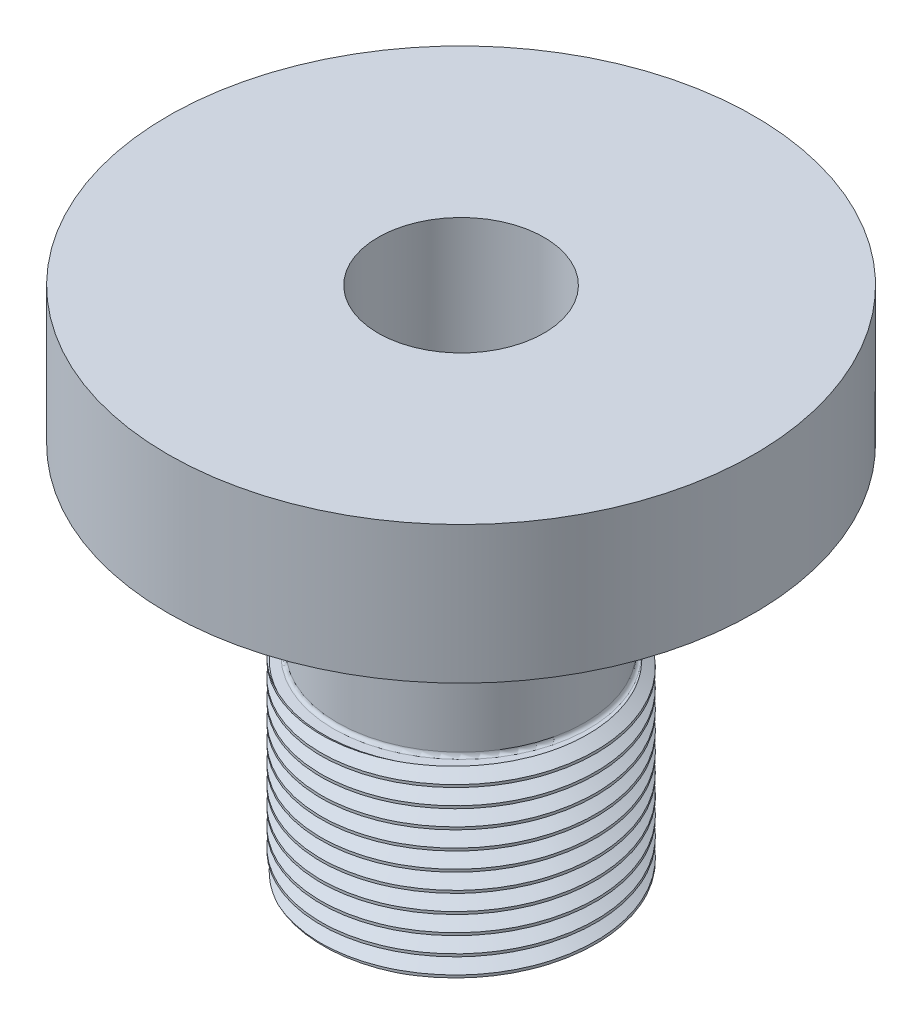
ISO-10303-21;
HEADER;
FILE_DESCRIPTION(('STEP AP214'),'2;1');
FILE_NAME('part.step','',(''),(''),'','','');
FILE_SCHEMA(('AUTOMOTIVE_DESIGN { 1 0 10303 214 1 1 1 1 }'));
ENDSEC;
DATA;
#1=APPLICATION_CONTEXT('core data for automotive mechanical design processes');
#2=APPLICATION_PROTOCOL_DEFINITION('international standard','automotive_design',2000,#1);
#3=PRODUCT_CONTEXT('',#1,'mechanical');
#4=PRODUCT('Part','Part','',(#3));
#5=PRODUCT_RELATED_PRODUCT_CATEGORY('part','',(#4));
#6=PRODUCT_DEFINITION_FORMATION('','',#4);
#7=PRODUCT_DEFINITION_CONTEXT('part definition',#1,'design');
#8=PRODUCT_DEFINITION('design','',#6,#7);
#9=PRODUCT_DEFINITION_SHAPE('','',#8);
#10=(LENGTH_UNIT() NAMED_UNIT(*) SI_UNIT(.MILLI.,.METRE.));
#11=(NAMED_UNIT(*) PLANE_ANGLE_UNIT() SI_UNIT($,.RADIAN.));
#12=(NAMED_UNIT(*) SI_UNIT($,.STERADIAN.) SOLID_ANGLE_UNIT());
#13=UNCERTAINTY_MEASURE_WITH_UNIT(LENGTH_MEASURE(1.E-05),#10,'distance_accuracy_value','');
#14=(GEOMETRIC_REPRESENTATION_CONTEXT(3) GLOBAL_UNCERTAINTY_ASSIGNED_CONTEXT((#13)) GLOBAL_UNIT_ASSIGNED_CONTEXT((#10,
#11,#12)) REPRESENTATION_CONTEXT('',''));
#15=CARTESIAN_POINT('',(0.,0.,0.));
#16=DIRECTION('',(0.,0.,1.));
#17=DIRECTION('',(1.,0.,0.));
#18=AXIS2_PLACEMENT_3D('',#15,#16,#17);
#19=CARTESIAN_POINT('',(-9.525,-12.7,0.));
#20=DIRECTION('',(0.,-1.,0.));
#21=DIRECTION('',(0.,0.,-1.));
#22=AXIS2_PLACEMENT_3D('',#19,#20,#21);
#23=PLANE('',#22);
#24=CARTESIAN_POINT('',(2.6462218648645E-13,-12.7,-8.58012));
#25=CARTESIAN_POINT('',(-0.228519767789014,-12.7,-8.58898007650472));
#26=CARTESIAN_POINT('',(-0.457386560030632,-12.7,-8.58880360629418));
#27=CARTESIAN_POINT('',(-0.914392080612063,-12.7,-8.57046506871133));
#28=CARTESIAN_POINT('',(-1.14253083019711,-12.7,-8.55230353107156));
#29=CARTESIAN_POINT('',(-1.59657234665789,-12.7,-8.49809473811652));
#30=CARTESIAN_POINT('',(-1.82247604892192,-12.7,-8.46205531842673));
#31=CARTESIAN_POINT('',(-2.27074661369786,-12.7,-8.37232368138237));
#32=CARTESIAN_POINT('',(-2.49311352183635,-12.7,-8.31863169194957));
#33=CARTESIAN_POINT('',(-2.93300958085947,-12.7,-8.19390408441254));
#34=CARTESIAN_POINT('',(-3.15053708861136,-12.7,-8.12286267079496));
#35=CARTESIAN_POINT('',(-3.57932861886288,-12.7,-7.96388703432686));
#36=CARTESIAN_POINT('',(-3.79059262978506,-12.7,-7.87595278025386));
#37=CARTESIAN_POINT('',(-4.20550943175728,-12.7,-7.68375296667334));
#38=CARTESIAN_POINT('',(-4.40916370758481,-12.7,-7.57949061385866));
#39=CARTESIAN_POINT('',(-4.80763494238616,-12.7,-7.35527922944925));
#40=CARTESIAN_POINT('',(-5.00245181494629,-12.7,-7.2353300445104));
#41=CARTESIAN_POINT('',(-5.39542850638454,-12.7,-6.97148581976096));
#42=CARTESIAN_POINT('',(-5.59285982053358,-12.7,-6.82649997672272));
#43=CARTESIAN_POINT('',(-5.87929599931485,-12.7,-6.59699973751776));
#44=CARTESIAN_POINT('',(-5.97316929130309,-12.7,-6.51848370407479));
#45=CARTESIAN_POINT('',(-6.15751488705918,-12.7,-6.35754274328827));
#46=CARTESIAN_POINT('',(-6.2479871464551,-12.7,-6.27511776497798));
#47=CARTESIAN_POINT('',(-6.42552890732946,-12.7,-6.10658351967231));
#48=CARTESIAN_POINT('',(-6.51259641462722,-12.7,-6.0204721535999));
#49=CARTESIAN_POINT('',(-6.68313899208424,-12.7,-5.84477332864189));
#50=CARTESIAN_POINT('',(-6.76661409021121,-12.7,-5.75518589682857));
#51=CARTESIAN_POINT('',(-7.0114360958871,-12.7,-5.48142037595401));
#52=CARTESIAN_POINT('',(-7.16721553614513,-12.7,-5.29220504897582));
#53=CARTESIAN_POINT('',(-7.46520428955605,-12.7,-4.89851125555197));
#54=CARTESIAN_POINT('',(-7.60714980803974,-12.7,-4.69383368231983));
#55=CARTESIAN_POINT('',(-7.87356703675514,-12.7,-4.27340060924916));
#56=CARTESIAN_POINT('',(-7.99803895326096,-12.7,-4.05764524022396));
#57=CARTESIAN_POINT('',(-8.2286031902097,-12.7,-3.61663005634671));
#58=CARTESIAN_POINT('',(-8.33470221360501,-12.7,-3.39137374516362));
#59=CARTESIAN_POINT('',(-8.52784671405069,-12.7,-2.93283473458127));
#60=CARTESIAN_POINT('',(-8.6148920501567,-12.7,-2.69955197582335));
#61=CARTESIAN_POINT('',(-8.77050784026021,-12.7,-2.2229591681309));
#62=CARTESIAN_POINT('',(-8.83877652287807,-12.7,-1.97955048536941));
#63=CARTESIAN_POINT('',(-8.95456481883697,-12.7,-1.48786840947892));
#64=CARTESIAN_POINT('',(-9.00208527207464,-12.7,-1.23959521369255));
#65=CARTESIAN_POINT('',(-9.07608007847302,-12.7,-0.739819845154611));
#66=CARTESIAN_POINT('',(-9.10254806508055,-12.7,-0.488316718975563));
#67=CARTESIAN_POINT('',(-9.12624602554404,-12.7,-0.110135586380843));
#68=CARTESIAN_POINT('',(-9.13147780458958,-12.7,0.0160885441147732));
#69=CARTESIAN_POINT('',(-9.13677489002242,-12.7,0.268676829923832));
#70=CARTESIAN_POINT('',(-9.13683884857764,-12.7,0.395041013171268));
#71=CARTESIAN_POINT('',(-9.12925219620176,-12.7,0.774969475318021));
#72=CARTESIAN_POINT('',(-9.1137642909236,-12.7,1.02842200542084));
#73=CARTESIAN_POINT('',(-9.06203770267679,-12.7,1.53316936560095));
#74=CARTESIAN_POINT('',(-9.02579895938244,-12.7,1.78446418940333));
#75=CARTESIAN_POINT('',(-8.9328165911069,-12.7,2.28323245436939));
#76=CARTESIAN_POINT('',(-8.87607358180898,-12.7,2.53070601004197));
#77=CARTESIAN_POINT('',(-8.74246368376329,-12.7,3.02016192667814));
#78=CARTESIAN_POINT('',(-8.66559633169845,-12.7,3.26214416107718));
#79=CARTESIAN_POINT('',(-8.4899671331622,-12.7,3.74527959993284));
#80=CARTESIAN_POINT('',(-8.39068104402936,-12.7,3.98624241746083));
#81=CARTESIAN_POINT('',(-8.17216084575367,-12.7,4.45894335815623));
#82=CARTESIAN_POINT('',(-8.05292697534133,-12.7,4.69068159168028));
#83=CARTESIAN_POINT('',(-7.79537740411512,-12.7,5.14326580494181));
#84=CARTESIAN_POINT('',(-7.65706322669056,-12.7,5.36411265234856));
#85=CARTESIAN_POINT('',(-7.36230571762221,-12.7,5.79338469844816));
#86=CARTESIAN_POINT('',(-7.20586316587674,-12.7,6.00181043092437));
#87=CARTESIAN_POINT('',(-6.95859044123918,-12.7,6.30386449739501));
#88=CARTESIAN_POINT('',(-6.87410259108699,-12.7,6.40274604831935));
#89=CARTESIAN_POINT('',(-6.70103099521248,-12.7,6.59685424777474));
#90=CARTESIAN_POINT('',(-6.61244728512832,-12.7,6.69208092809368));
#91=CARTESIAN_POINT('',(-6.34096834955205,-12.7,6.97221666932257));
#92=CARTESIAN_POINT('',(-6.15232076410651,-12.7,7.15161129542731));
#93=CARTESIAN_POINT('',(-5.76087815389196,-12.7,7.49447297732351));
#94=CARTESIAN_POINT('',(-5.55807357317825,-12.7,7.65792909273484));
#95=CARTESIAN_POINT('',(-5.13978575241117,-12.7,7.96770467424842));
#96=CARTESIAN_POINT('',(-4.92430330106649,-12.7,8.11402520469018));
#97=CARTESIAN_POINT('',(-4.47651448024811,-12.7,8.39201513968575));
#98=CARTESIAN_POINT('',(-4.24392089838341,-12.7,8.52322208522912));
#99=CARTESIAN_POINT('',(-3.76855046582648,-12.7,8.76567277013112));
#100=CARTESIAN_POINT('',(-3.52577360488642,-12.7,8.87691648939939));
#101=CARTESIAN_POINT('',(-3.03219800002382,-12.7,9.07847582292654));
#102=CARTESIAN_POINT('',(-2.78141436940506,-12.7,9.16882848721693));
#103=CARTESIAN_POINT('',(-2.27327070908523,-12.7,9.32819093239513));
#104=CARTESIAN_POINT('',(-2.01591429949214,-12.7,9.39721219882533));
#105=CARTESIAN_POINT('',(-1.61255632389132,-12.7,9.48748508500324));
#106=CARTESIAN_POINT('',(-1.46820426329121,-12.7,9.51629831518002));
#107=CARTESIAN_POINT('',(-1.17841855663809,-12.7,9.5671981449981));
#108=CARTESIAN_POINT('',(-1.03298578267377,-12.7,9.58928966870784));
#109=CARTESIAN_POINT('',(-0.739986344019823,-12.7,9.62688606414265));
#110=CARTESIAN_POINT('',(-0.592412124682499,-12.7,9.64233191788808));
#111=CARTESIAN_POINT('',(-0.296598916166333,-12.7,9.66633522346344));
#112=CARTESIAN_POINT('',(-0.148359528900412,-12.7,9.67488776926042));
#113=CARTESIAN_POINT('',(1.27953725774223E-12,-12.7,9.67997226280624));
#114=B_SPLINE_CURVE_WITH_KNOTS('',3,(#24,#25,#26,#27,#28,#29,#30,#31,#32,#33,#34,#35,#36,#37,
#38,#39,#40,#41,#42,#43,#44,#45,#46,#47,#48,#49,#50,#51,#52,#53,#54,#55,#56,#57,#58,#59,#60,#61,
#62,#63,#64,#65,#66,#67,#68,#69,#70,#71,#72,#73,#74,#75,#76,#77,#78,#79,#80,#81,#82,#83,#84,#85,
#86,#87,#88,#89,#90,#91,#92,#93,#94,#95,#96,#97,#98,#99,#100,#101,#102,#103,#104,#105,#106,#107,
#108,#109,#110,#111,#112,#113),.UNSPECIFIED.,.F.,.F.,(4,2,2,2,2,2,2,2,2,2,2,2,2,2,2,2,2,2,2,2,2,
2,2,2,2,2,2,2,2,2,2,2,2,2,2,2,2,2,2,2,2,2,2,2,4),(0.,0.685892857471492,1.37176551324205,
2.05733782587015,2.74290128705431,3.42869407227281,4.11448812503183,4.80014766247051,
5.48581390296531,6.21970275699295,6.58675466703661,6.95381136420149,7.32107992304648,
7.68834562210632,8.42272927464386,9.16913110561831,9.91552412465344,10.6616442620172,
11.4077699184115,12.1652664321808,12.9227322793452,13.6804271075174,14.0593304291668,
14.438332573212,15.1991766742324,15.9600229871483,16.7208464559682,17.4816874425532,
18.2626061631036,19.0435155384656,19.8243626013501,20.6051760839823,20.9952574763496,
21.3853354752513,22.1653758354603,22.9459479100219,23.7264714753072,24.5266759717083,
25.3268812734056,26.1256563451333,26.9240005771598,27.3654648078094,27.8066048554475,
28.2515854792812,28.6968825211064),.UNSPECIFIED.);
#115=CARTESIAN_POINT('',(-5.84501319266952,-12.7,-6.62400912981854));
#116=VERTEX_POINT('',#115);
#117=CARTESIAN_POINT('',(-4.06917079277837,-12.7,8.61205399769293));
#118=VERTEX_POINT('',#117);
#119=EDGE_CURVE('E100',#116,#118,#114,.T.);
#120=ORIENTED_EDGE('',*,*,#119,.T.);
#121=CARTESIAN_POINT('',(0.,-12.7,0.));
#122=DIRECTION('',(0.,1.,0.));
#123=DIRECTION('',(0.,0.,1.));
#124=AXIS2_PLACEMENT_3D('',#121,#122,#123);
#125=CIRCLE('',#124,9.525);
#126=CARTESIAN_POINT('',(4.06917079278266,-12.7,8.6120539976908));
#127=VERTEX_POINT('',#126);
#128=EDGE_CURVE('E269',#118,#127,#125,.T.);
#129=ORIENTED_EDGE('',*,*,#128,.T.);
#130=CARTESIAN_POINT('',(-2.99728531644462E-13,-12.7,9.67997226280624));
#131=CARTESIAN_POINT('',(0.227978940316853,-12.7,9.67217040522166));
#132=CARTESIAN_POINT('',(0.455674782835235,-12.7,9.65616136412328));
#133=CARTESIAN_POINT('',(0.90932799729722,-12.7,9.60787665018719));
#134=CARTESIAN_POINT('',(1.13528542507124,-12.7,9.57560150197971));
#135=CARTESIAN_POINT('',(1.58406987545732,-12.7,9.49497391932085));
#136=CARTESIAN_POINT('',(1.80689992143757,-12.7,9.4466383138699));
#137=CARTESIAN_POINT('',(2.24852640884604,-12.7,9.33413314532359));
#138=CARTESIAN_POINT('',(2.4673228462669,-12.7,9.26996356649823));
#139=CARTESIAN_POINT('',(2.8997854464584,-12.7,9.12610867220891));
#140=CARTESIAN_POINT('',(3.11345095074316,-12.7,9.04642137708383));
#141=CARTESIAN_POINT('',(3.53457230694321,-12.7,8.87192600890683));
#142=CARTESIAN_POINT('',(3.74202672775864,-12.7,8.77711448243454));
#143=CARTESIAN_POINT('',(4.14969651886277,-12.7,8.57282625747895));
#144=CARTESIAN_POINT('',(4.34990880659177,-12.7,8.46334340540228));
#145=CARTESIAN_POINT('',(4.74198407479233,-12.7,8.23030026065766));
#146=CARTESIAN_POINT('',(4.93384617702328,-12.7,8.10673849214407));
#147=CARTESIAN_POINT('',(5.34113060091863,-12.7,7.82327316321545));
#148=CARTESIAN_POINT('',(5.55477077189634,-12.7,7.66079856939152));
#149=CARTESIAN_POINT('',(5.96753024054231,-12.7,7.31846160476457));
#150=CARTESIAN_POINT('',(6.16665281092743,-12.7,7.13860317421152));
#151=CARTESIAN_POINT('',(6.54916587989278,-12.7,6.76272985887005));
#152=CARTESIAN_POINT('',(6.73255125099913,-12.7,6.56670974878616));
#153=CARTESIAN_POINT('',(7.08157814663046,-12.7,6.1594782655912));
#154=CARTESIAN_POINT('',(7.24722139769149,-12.7,5.94826837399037));
#155=CARTESIAN_POINT('',(7.55800150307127,-12.7,5.51447830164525));
#156=CARTESIAN_POINT('',(7.70332754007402,-12.7,5.29203356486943));
#157=CARTESIAN_POINT('',(7.97434415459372,-12.7,4.83546815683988));
#158=CARTESIAN_POINT('',(8.10003361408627,-12.7,4.60134682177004));
#159=CARTESIAN_POINT('',(8.33084883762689,-12.7,4.123153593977));
#160=CARTESIAN_POINT('',(8.43597280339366,-12.7,3.87908083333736));
#161=CARTESIAN_POINT('',(8.62486024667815,-12.7,3.38281885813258));
#162=CARTESIAN_POINT('',(8.70862484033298,-12.7,3.13063006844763));
#163=CARTESIAN_POINT('',(8.8527827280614,-12.7,2.62489550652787));
#164=CARTESIAN_POINT('',(8.91359396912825,-12.7,2.37146880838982));
#165=CARTESIAN_POINT('',(9.01365075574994,-12.7,1.86039232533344));
#166=CARTESIAN_POINT('',(9.05289557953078,-12.7,1.60274239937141));
#167=CARTESIAN_POINT('',(9.10953434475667,-12.7,1.08506184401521));
#168=CARTESIAN_POINT('',(9.12693195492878,-12.7,0.825031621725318));
#169=CARTESIAN_POINT('',(9.13655595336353,-12.7,0.434652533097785));
#170=CARTESIAN_POINT('',(9.13701784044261,-12.7,0.304458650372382));
#171=CARTESIAN_POINT('',(9.13246341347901,-12.7,0.0441658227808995));
#172=CARTESIAN_POINT('',(9.1274471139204,-12.7,-0.08593312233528));
#173=CARTESIAN_POINT('',(9.10391466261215,-12.7,-0.4755282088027));
#174=CARTESIAN_POINT('',(9.07692139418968,-12.7,-0.734564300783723));
#175=CARTESIAN_POINT('',(9.0005866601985,-12.7,-1.24928701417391));
#176=CARTESIAN_POINT('',(8.95124492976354,-12.7,-1.50497359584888));
#177=CARTESIAN_POINT('',(8.83058423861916,-12.7,-2.01102719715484));
#178=CARTESIAN_POINT('',(8.75927263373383,-12.7,-2.26139596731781));
#179=CARTESIAN_POINT('',(8.59516881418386,-12.7,-2.75511736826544));
#180=CARTESIAN_POINT('',(8.50236690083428,-12.7,-2.99846677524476));
#181=CARTESIAN_POINT('',(8.29897358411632,-12.7,-3.46931307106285));
#182=CARTESIAN_POINT('',(8.18897118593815,-12.7,-3.69706464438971));
#183=CARTESIAN_POINT('',(7.95021928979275,-12.7,-4.14238563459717));
#184=CARTESIAN_POINT('',(7.8214787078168,-12.7,-4.35995982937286));
#185=CARTESIAN_POINT('',(7.54609189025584,-12.7,-4.78354929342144));
#186=CARTESIAN_POINT('',(7.39944009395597,-12.7,-4.98956094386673));
#187=CARTESIAN_POINT('',(7.08927168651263,-12.7,-5.38853535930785));
#188=CARTESIAN_POINT('',(6.92575416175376,-12.7,-5.58149741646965));
#189=CARTESIAN_POINT('',(6.6686945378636,-12.7,-5.860108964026));
#190=CARTESIAN_POINT('',(6.58099693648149,-12.7,-5.95121740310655));
#191=CARTESIAN_POINT('',(6.40185678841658,-12.7,-6.12967532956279));
#192=CARTESIAN_POINT('',(6.31041449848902,-12.7,-6.21702507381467));
#193=CARTESIAN_POINT('',(6.12385202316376,-12.7,-6.3876861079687));
#194=CARTESIAN_POINT('',(6.02873225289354,-12.7,-6.47099785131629));
#195=CARTESIAN_POINT('',(5.83494017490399,-12.7,-6.63340583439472));
#196=CARTESIAN_POINT('',(5.73626720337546,-12.7,-6.71250127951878));
#197=CARTESIAN_POINT('',(5.43529760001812,-12.7,-6.94317441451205));
#198=CARTESIAN_POINT('',(5.22794294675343,-12.7,-7.08823707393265));
#199=CARTESIAN_POINT('',(4.80139015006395,-12.7,-7.35978928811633));
#200=CARTESIAN_POINT('',(4.58218962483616,-12.7,-7.48627508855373));
#201=CARTESIAN_POINT('',(4.13885815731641,-12.7,-7.71698040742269));
#202=CARTESIAN_POINT('',(3.91496212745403,-12.7,-7.82165117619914));
#203=CARTESIAN_POINT('',(3.45919938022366,-12.7,-8.01154880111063));
#204=CARTESIAN_POINT('',(3.22733657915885,-12.7,-8.09678505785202));
#205=CARTESIAN_POINT('',(2.75728412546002,-12.7,-8.24723936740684));
#206=CARTESIAN_POINT('',(2.51909648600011,-12.7,-8.31246370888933));
#207=CARTESIAN_POINT('',(2.03812724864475,-12.7,-8.4224442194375));
#208=CARTESIAN_POINT('',(1.79534718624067,-12.7,-8.46720710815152));
#209=CARTESIAN_POINT('',(1.29418869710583,-12.7,-8.53774769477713));
#210=CARTESIAN_POINT('',(1.03565414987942,-12.7,-8.56242076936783));
#211=CARTESIAN_POINT('',(0.517927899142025,-12.7,-8.58860571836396));
#212=CARTESIAN_POINT('',(0.258738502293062,-12.7,-8.59016324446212));
#213=CARTESIAN_POINT('',(2.64622186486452E-13,-12.7,-8.58012000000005));
#214=B_SPLINE_CURVE_WITH_KNOTS('',3,(#130,#131,#132,#133,#134,#135,#136,#137,#138,#139,#140,
#141,#142,#143,#144,#145,#146,#147,#148,#149,#150,#151,#152,#153,#154,#155,#156,#157,#158,#159,
#160,#161,#162,#163,#164,#165,#166,#167,#168,#169,#170,#171,#172,#173,#174,#175,#176,#177,#178,
#179,#180,#181,#182,#183,#184,#185,#186,#187,#188,#189,#190,#191,#192,#193,#194,#195,#196,#197,
#198,#199,#200,#201,#202,#203,#204,#205,#206,#207,#208,#209,#210,#211,#212,#213),.UNSPECIFIED.,
.F.,.F.,(4,2,2,2,2,2,2,2,2,2,2,2,2,2,2,2,2,2,2,2,2,2,2,2,2,2,2,2,2,2,2,2,2,2,2,2,2,2,2,2,2,4),
(0.,0.684187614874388,1.36835316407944,2.05180405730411,2.73525562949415,3.41879444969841,
4.10248957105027,4.78647235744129,5.47052690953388,6.27475119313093,7.07879361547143,
7.88309702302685,8.68732209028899,9.48347294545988,10.2796691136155,11.0759348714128,
11.8721590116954,12.6530918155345,13.4340507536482,14.2148785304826,14.6053636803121,
14.9958477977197,15.7760931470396,16.5563477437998,17.3363413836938,18.1166877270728,
18.8745704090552,19.6320936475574,20.3898526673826,21.1476527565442,21.5269352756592,
21.9061918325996,22.2854057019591,22.6646907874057,23.422826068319,24.1811143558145,
24.9216829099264,25.6618924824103,26.4018692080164,27.141602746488,27.9196883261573,
28.6962370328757),.UNSPECIFIED.);
#215=CARTESIAN_POINT('',(5.84501319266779,-12.7,-6.62400912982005));
#216=VERTEX_POINT('',#215);
#217=EDGE_CURVE('E251',#127,#216,#214,.T.);
#218=ORIENTED_EDGE('',*,*,#217,.T.);
#219=CARTESIAN_POINT('',(0.,-12.7,0.));
#220=DIRECTION('',(0.,-1.,0.));
#221=DIRECTION('',(0.,0.,-1.));
#222=AXIS2_PLACEMENT_3D('',#219,#220,#221);
#223=CIRCLE('',#222,8.83412);
#224=EDGE_CURVE('E201',#216,#116,#223,.T.);
#225=ORIENTED_EDGE('',*,*,#224,.T.);
#226=EDGE_LOOP('',(#120,#129,#218,#225));
#227=FACE_BOUND('',#226,.T.);
#228=ADVANCED_FACE('F46',(#227),#23,.F.);
#229=CARTESIAN_POINT('',(0.,-25.4,9.52499999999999));
#230=DIRECTION('',(0.,-1.,0.));
#231=DIRECTION('',(0.,0.,-1.));
#232=AXIS2_PLACEMENT_3D('',#229,#230,#231);
#233=PLANE('',#232);
#234=CARTESIAN_POINT('',(0.,-25.4,0.));
#235=DIRECTION('',(0.,-1.,0.));
#236=DIRECTION('',(0.,0.,-1.));
#237=AXIS2_PLACEMENT_3D('',#234,#235,#236);
#238=CIRCLE('',#237,7.81812);
#239=CARTESIAN_POINT('',(0.,-25.4,-7.81812));
#240=VERTEX_POINT('',#239);
#241=EDGE_CURVE('E13',#240,#240,#238,.F.);
#242=ORIENTED_EDGE('',*,*,#241,.T.);
#243=EDGE_LOOP('',(#242));
#244=FACE_BOUND('',#243,.T.);
#245=CARTESIAN_POINT('',(0.,-25.4,0.));
#246=DIRECTION('',(0.,1.,0.));
#247=DIRECTION('',(0.,0.,1.));
#248=AXIS2_PLACEMENT_3D('',#245,#246,#247);
#249=CIRCLE('',#248,9.52499999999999);
#250=CARTESIAN_POINT('',(-4.06917079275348,-25.4,8.61205399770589));
#251=VERTEX_POINT('',#250);
#252=CARTESIAN_POINT('',(4.06917079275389,-25.4,8.6120539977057));
#253=VERTEX_POINT('',#252);
#254=EDGE_CURVE('E103',#251,#253,#249,.T.);
#255=ORIENTED_EDGE('',*,*,#254,.F.);
#256=CARTESIAN_POINT('',(2.6462218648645E-13,-25.4,-8.58012));
#257=CARTESIAN_POINT('',(-0.228519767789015,-25.4,-8.58898007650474));
#258=CARTESIAN_POINT('',(-0.457386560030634,-25.4,-8.5888036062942));
#259=CARTESIAN_POINT('',(-0.914392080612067,-25.4,-8.57046506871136));
#260=CARTESIAN_POINT('',(-1.14253083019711,-25.4,-8.55230353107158));
#261=CARTESIAN_POINT('',(-1.59657234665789,-25.4,-8.49809473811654));
#262=CARTESIAN_POINT('',(-1.82247604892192,-25.4,-8.46205531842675));
#263=CARTESIAN_POINT('',(-2.27074661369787,-25.4,-8.37232368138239));
#264=CARTESIAN_POINT('',(-2.49311352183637,-25.4,-8.31863169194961));
#265=CARTESIAN_POINT('',(-2.93300958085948,-25.4,-8.19390408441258));
#266=CARTESIAN_POINT('',(-3.15053708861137,-25.4,-8.12286267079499));
#267=CARTESIAN_POINT('',(-3.5793286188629,-25.4,-7.96388703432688));
#268=CARTESIAN_POINT('',(-3.79059262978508,-25.4,-7.87595278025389));
#269=CARTESIAN_POINT('',(-4.2055094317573,-25.4,-7.68375296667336));
#270=CARTESIAN_POINT('',(-4.40916370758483,-25.4,-7.57949061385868));
#271=CARTESIAN_POINT('',(-4.80763494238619,-25.4,-7.35527922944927));
#272=CARTESIAN_POINT('',(-5.00245181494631,-25.4,-7.23533004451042));
#273=CARTESIAN_POINT('',(-5.39542850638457,-25.4,-6.97148581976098));
#274=CARTESIAN_POINT('',(-5.59285982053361,-25.4,-6.82649997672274));
#275=CARTESIAN_POINT('',(-5.87929599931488,-25.4,-6.59699973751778));
#276=CARTESIAN_POINT('',(-5.97316929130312,-25.4,-6.5184837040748));
#277=CARTESIAN_POINT('',(-6.15751488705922,-25.4,-6.35754274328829));
#278=CARTESIAN_POINT('',(-6.24798714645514,-25.4,-6.27511776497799));
#279=CARTESIAN_POINT('',(-6.42552890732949,-25.4,-6.10658351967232));
#280=CARTESIAN_POINT('',(-6.51259641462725,-25.4,-6.02047215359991));
#281=CARTESIAN_POINT('',(-6.68313899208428,-25.4,-5.8447733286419));
#282=CARTESIAN_POINT('',(-6.76661409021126,-25.4,-5.75518589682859));
#283=CARTESIAN_POINT('',(-7.01143609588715,-25.4,-5.48142037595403));
#284=CARTESIAN_POINT('',(-7.16721553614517,-25.4,-5.29220504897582));
#285=CARTESIAN_POINT('',(-7.46520428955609,-25.4,-4.89851125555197));
#286=CARTESIAN_POINT('',(-7.60714980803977,-25.4,-4.69383368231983));
#287=CARTESIAN_POINT('',(-7.87356703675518,-25.4,-4.27340060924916));
#288=CARTESIAN_POINT('',(-7.998038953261,-25.4,-4.05764524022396));
#289=CARTESIAN_POINT('',(-8.22860319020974,-25.4,-3.61663005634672));
#290=CARTESIAN_POINT('',(-8.33470221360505,-25.4,-3.39137374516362));
#291=CARTESIAN_POINT('',(-8.52784671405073,-25.4,-2.93283473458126));
#292=CARTESIAN_POINT('',(-8.61489205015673,-25.4,-2.69955197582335));
#293=CARTESIAN_POINT('',(-8.77050784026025,-25.4,-2.2229591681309));
#294=CARTESIAN_POINT('',(-8.8387765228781,-25.4,-1.97955048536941));
#295=CARTESIAN_POINT('',(-8.95456481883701,-25.4,-1.48786840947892));
#296=CARTESIAN_POINT('',(-9.00208527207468,-25.4,-1.23959521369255));
#297=CARTESIAN_POINT('',(-9.07608007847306,-25.4,-0.739819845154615));
#298=CARTESIAN_POINT('',(-9.10254806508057,-25.4,-0.488316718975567));
#299=CARTESIAN_POINT('',(-9.12624602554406,-25.4,-0.110135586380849));
#300=CARTESIAN_POINT('',(-9.13147780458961,-25.4,0.0160885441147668));
#301=CARTESIAN_POINT('',(-9.13677489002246,-25.4,0.268676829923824));
#302=CARTESIAN_POINT('',(-9.13683884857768,-25.4,0.39504101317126));
#303=CARTESIAN_POINT('',(-9.12925219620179,-25.4,0.774969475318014));
#304=CARTESIAN_POINT('',(-9.11376429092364,-25.4,1.02842200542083));
#305=CARTESIAN_POINT('',(-9.06203770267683,-25.4,1.53316936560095));
#306=CARTESIAN_POINT('',(-9.02579895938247,-25.4,1.78446418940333));
#307=CARTESIAN_POINT('',(-8.93281659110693,-25.4,2.28323245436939));
#308=CARTESIAN_POINT('',(-8.87607358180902,-25.4,2.53070601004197));
#309=CARTESIAN_POINT('',(-8.74246368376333,-25.4,3.02016192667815));
#310=CARTESIAN_POINT('',(-8.66559633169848,-25.4,3.26214416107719));
#311=CARTESIAN_POINT('',(-8.48996713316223,-25.4,3.74527959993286));
#312=CARTESIAN_POINT('',(-8.39068104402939,-25.4,3.98624241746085));
#313=CARTESIAN_POINT('',(-8.17216084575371,-25.4,4.45894335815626));
#314=CARTESIAN_POINT('',(-8.05292697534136,-25.4,4.6906815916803));
#315=CARTESIAN_POINT('',(-7.79537740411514,-25.4,5.14326580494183));
#316=CARTESIAN_POINT('',(-7.65706322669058,-25.4,5.36411265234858));
#317=CARTESIAN_POINT('',(-7.36230571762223,-25.4,5.79338469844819));
#318=CARTESIAN_POINT('',(-7.20586316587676,-25.4,6.00181043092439));
#319=CARTESIAN_POINT('',(-6.9585904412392,-25.4,6.30386449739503));
#320=CARTESIAN_POINT('',(-6.87410259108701,-25.4,6.40274604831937));
#321=CARTESIAN_POINT('',(-6.70103099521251,-25.4,6.59685424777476));
#322=CARTESIAN_POINT('',(-6.61244728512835,-25.4,6.6920809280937));
#323=CARTESIAN_POINT('',(-6.34096834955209,-25.4,6.97221666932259));
#324=CARTESIAN_POINT('',(-6.15232076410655,-25.4,7.15161129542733));
#325=CARTESIAN_POINT('',(-5.76087815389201,-25.4,7.49447297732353));
#326=CARTESIAN_POINT('',(-5.5580735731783,-25.4,7.65792909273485));
#327=CARTESIAN_POINT('',(-5.13978575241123,-25.4,7.96770467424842));
#328=CARTESIAN_POINT('',(-4.92430330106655,-25.4,8.11402520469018));
#329=CARTESIAN_POINT('',(-4.47651448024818,-25.4,8.39201513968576));
#330=CARTESIAN_POINT('',(-4.24392089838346,-25.4,8.52322208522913));
#331=CARTESIAN_POINT('',(-3.76855046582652,-25.4,8.76567277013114));
#332=CARTESIAN_POINT('',(-3.52577360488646,-25.4,8.87691648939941));
#333=CARTESIAN_POINT('',(-3.03219800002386,-25.4,9.07847582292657));
#334=CARTESIAN_POINT('',(-2.78141436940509,-25.4,9.16882848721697));
#335=CARTESIAN_POINT('',(-2.27327070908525,-25.4,9.32819093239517));
#336=CARTESIAN_POINT('',(-2.01591429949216,-25.4,9.39721219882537));
#337=CARTESIAN_POINT('',(-1.61255632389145,-25.4,9.48748508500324));
#338=CARTESIAN_POINT('',(-1.46820426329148,-25.4,9.51629831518));
#339=CARTESIAN_POINT('',(-1.17841855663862,-25.4,9.56719814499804));
#340=CARTESIAN_POINT('',(-1.03298578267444,-25.4,9.58928966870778));
#341=CARTESIAN_POINT('',(-0.739986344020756,-25.4,9.62688606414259));
#342=CARTESIAN_POINT('',(-0.592412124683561,-25.4,9.64233191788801));
#343=CARTESIAN_POINT('',(-0.296598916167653,-25.4,9.66633522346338));
#344=CARTESIAN_POINT('',(-0.148359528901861,-25.4,9.67488776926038));
#345=CARTESIAN_POINT('',(-2.99728531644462E-13,-25.4,9.67997226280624));
#346=B_SPLINE_CURVE_WITH_KNOTS('',3,(#256,#257,#258,#259,#260,#261,#262,#263,#264,#265,#266,
#267,#268,#269,#270,#271,#272,#273,#274,#275,#276,#277,#278,#279,#280,#281,#282,#283,#284,#285,
#286,#287,#288,#289,#290,#291,#292,#293,#294,#295,#296,#297,#298,#299,#300,#301,#302,#303,#304,
#305,#306,#307,#308,#309,#310,#311,#312,#313,#314,#315,#316,#317,#318,#319,#320,#321,#322,#323,
#324,#325,#326,#327,#328,#329,#330,#331,#332,#333,#334,#335,#336,#337,#338,#339,#340,#341,#342,
#343,#344,#345),.UNSPECIFIED.,.F.,.F.,(4,2,2,2,2,2,2,2,2,2,2,2,2,2,2,2,2,2,2,2,2,2,2,2,2,2,2,2,
2,2,2,2,2,2,2,2,2,2,2,2,2,2,2,2,4),(0.,0.685892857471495,1.37176551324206,2.05733782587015,
2.74290128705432,3.42869407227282,4.11448812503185,4.80014766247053,5.48581390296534,
6.21970275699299,6.58675466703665,6.95381136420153,7.32107992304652,7.68834562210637,
8.42272927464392,9.16913110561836,9.91552412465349,10.6616442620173,11.4077699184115,
12.1652664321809,12.9227322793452,13.6804271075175,14.0593304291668,14.4383325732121,
15.1991766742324,15.9600229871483,16.7208464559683,17.4816874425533,18.2626061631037,
19.0435155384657,19.8243626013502,20.6051760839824,20.9952574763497,21.3853354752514,
22.1653758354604,22.9459479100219,23.7264714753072,24.5266759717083,25.3268812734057,
26.1256563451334,26.9240005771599,27.3654648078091,27.8066048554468,28.2515854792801,
28.6968825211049),.UNSPECIFIED.);
#347=CARTESIAN_POINT('',(2.6462218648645E-13,-25.4,-8.58012));
#348=VERTEX_POINT('',#347);
#349=EDGE_CURVE('E69',#348,#251,#346,.T.);
#350=ORIENTED_EDGE('',*,*,#349,.F.);
#351=CARTESIAN_POINT('',(-2.99728531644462E-13,-25.4,9.67997226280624));
#352=CARTESIAN_POINT('',(0.227978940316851,-25.4,9.67217040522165));
#353=CARTESIAN_POINT('',(0.455674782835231,-25.4,9.65616136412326));
#354=CARTESIAN_POINT('',(0.909327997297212,-25.4,9.60787665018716));
#355=CARTESIAN_POINT('',(1.13528542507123,-25.4,9.57560150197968));
#356=CARTESIAN_POINT('',(1.58406987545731,-25.4,9.49497391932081));
#357=CARTESIAN_POINT('',(1.80689992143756,-25.4,9.44663831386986));
#358=CARTESIAN_POINT('',(2.24852640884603,-25.4,9.33413314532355));
#359=CARTESIAN_POINT('',(2.46732284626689,-25.4,9.2699635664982));
#360=CARTESIAN_POINT('',(2.89978544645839,-25.4,9.12610867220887));
#361=CARTESIAN_POINT('',(3.11345095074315,-25.4,9.04642137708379));
#362=CARTESIAN_POINT('',(3.5345723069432,-25.4,8.87192600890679));
#363=CARTESIAN_POINT('',(3.74202672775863,-25.4,8.77711448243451));
#364=CARTESIAN_POINT('',(4.14969651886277,-25.4,8.5728262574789));
#365=CARTESIAN_POINT('',(4.34990880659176,-25.4,8.46334340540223));
#366=CARTESIAN_POINT('',(4.74198407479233,-25.4,8.23030026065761));
#367=CARTESIAN_POINT('',(4.93384617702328,-25.4,8.10673849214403));
#368=CARTESIAN_POINT('',(5.34113060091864,-25.4,7.82327316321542));
#369=CARTESIAN_POINT('',(5.55477077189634,-25.4,7.66079856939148));
#370=CARTESIAN_POINT('',(5.96753024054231,-25.4,7.31846160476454));
#371=CARTESIAN_POINT('',(6.16665281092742,-25.4,7.13860317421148));
#372=CARTESIAN_POINT('',(6.54916587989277,-25.4,6.76272985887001));
#373=CARTESIAN_POINT('',(6.73255125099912,-25.4,6.56670974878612));
#374=CARTESIAN_POINT('',(7.08157814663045,-25.4,6.15947826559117));
#375=CARTESIAN_POINT('',(7.24722139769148,-25.4,5.94826837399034));
#376=CARTESIAN_POINT('',(7.55800150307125,-25.4,5.51447830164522));
#377=CARTESIAN_POINT('',(7.70332754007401,-25.4,5.2920335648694));
#378=CARTESIAN_POINT('',(7.97434415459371,-25.4,4.83546815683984));
#379=CARTESIAN_POINT('',(8.10003361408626,-25.4,4.60134682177));
#380=CARTESIAN_POINT('',(8.33084883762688,-25.4,4.12315359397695));
#381=CARTESIAN_POINT('',(8.43597280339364,-25.4,3.8790808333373));
#382=CARTESIAN_POINT('',(8.62486024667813,-25.4,3.38281885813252));
#383=CARTESIAN_POINT('',(8.70862484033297,-25.4,3.13063006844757));
#384=CARTESIAN_POINT('',(8.85278272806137,-25.4,2.62489550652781));
#385=CARTESIAN_POINT('',(8.91359396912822,-25.4,2.37146880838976));
#386=CARTESIAN_POINT('',(9.01365075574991,-25.4,1.86039232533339));
#387=CARTESIAN_POINT('',(9.05289557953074,-25.4,1.60274239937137));
#388=CARTESIAN_POINT('',(9.10953434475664,-25.4,1.08506184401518));
#389=CARTESIAN_POINT('',(9.12693195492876,-25.4,0.82503162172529));
#390=CARTESIAN_POINT('',(9.1365559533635,-25.4,0.434652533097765));
#391=CARTESIAN_POINT('',(9.13701784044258,-25.4,0.304458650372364));
#392=CARTESIAN_POINT('',(9.13246341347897,-25.4,0.044165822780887));
#393=CARTESIAN_POINT('',(9.12744711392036,-25.4,-0.0859331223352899));
#394=CARTESIAN_POINT('',(9.10391466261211,-25.4,-0.475528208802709));
#395=CARTESIAN_POINT('',(9.07692139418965,-25.4,-0.734564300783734));
#396=CARTESIAN_POINT('',(9.00058666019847,-25.4,-1.24928701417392));
#397=CARTESIAN_POINT('',(8.9512449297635,-25.4,-1.50497359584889));
#398=CARTESIAN_POINT('',(8.83058423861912,-25.4,-2.01102719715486));
#399=CARTESIAN_POINT('',(8.7592726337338,-25.4,-2.26139596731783));
#400=CARTESIAN_POINT('',(8.59516881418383,-25.4,-2.75511736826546));
#401=CARTESIAN_POINT('',(8.50236690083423,-25.4,-2.99846677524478));
#402=CARTESIAN_POINT('',(8.29897358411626,-25.4,-3.46931307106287));
#403=CARTESIAN_POINT('',(8.1889711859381,-25.4,-3.69706464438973));
#404=CARTESIAN_POINT('',(7.9502192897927,-25.4,-4.14238563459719));
#405=CARTESIAN_POINT('',(7.82147870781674,-25.4,-4.35995982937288));
#406=CARTESIAN_POINT('',(7.54609189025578,-25.4,-4.78354929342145));
#407=CARTESIAN_POINT('',(7.39944009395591,-25.4,-4.98956094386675));
#408=CARTESIAN_POINT('',(7.08927168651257,-25.4,-5.38853535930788));
#409=CARTESIAN_POINT('',(6.92575416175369,-25.4,-5.58149741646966));
#410=CARTESIAN_POINT('',(6.66869453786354,-25.4,-5.86010896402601));
#411=CARTESIAN_POINT('',(6.58099693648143,-25.4,-5.95121740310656));
#412=CARTESIAN_POINT('',(6.40185678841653,-25.4,-6.1296753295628));
#413=CARTESIAN_POINT('',(6.31041449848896,-25.4,-6.21702507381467));
#414=CARTESIAN_POINT('',(6.12385202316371,-25.4,-6.3876861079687));
#415=CARTESIAN_POINT('',(6.0287322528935,-25.4,-6.47099785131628));
#416=CARTESIAN_POINT('',(5.83494017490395,-25.4,-6.6334058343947));
#417=CARTESIAN_POINT('',(5.73626720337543,-25.4,-6.71250127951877));
#418=CARTESIAN_POINT('',(5.43529760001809,-25.4,-6.94317441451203));
#419=CARTESIAN_POINT('',(5.22794294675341,-25.4,-7.08823707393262));
#420=CARTESIAN_POINT('',(4.80139015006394,-25.4,-7.3597892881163));
#421=CARTESIAN_POINT('',(4.58218962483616,-25.4,-7.48627508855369));
#422=CARTESIAN_POINT('',(4.13885815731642,-25.4,-7.71698040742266));
#423=CARTESIAN_POINT('',(3.91496212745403,-25.4,-7.8216511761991));
#424=CARTESIAN_POINT('',(3.45919938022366,-25.4,-8.01154880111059));
#425=CARTESIAN_POINT('',(3.22733657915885,-25.4,-8.09678505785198));
#426=CARTESIAN_POINT('',(2.75728412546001,-25.4,-8.2472393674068));
#427=CARTESIAN_POINT('',(2.51909648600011,-25.4,-8.3124637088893));
#428=CARTESIAN_POINT('',(2.03812724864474,-25.4,-8.42244421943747));
#429=CARTESIAN_POINT('',(1.79534718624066,-25.4,-8.46720710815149));
#430=CARTESIAN_POINT('',(1.29418869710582,-25.4,-8.5377476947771));
#431=CARTESIAN_POINT('',(1.03565414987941,-25.4,-8.56242076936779));
#432=CARTESIAN_POINT('',(0.517927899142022,-25.4,-8.58860571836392));
#433=CARTESIAN_POINT('',(0.258738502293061,-25.4,-8.59016324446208));
#434=CARTESIAN_POINT('',(2.64622186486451E-13,-25.4,-8.58012000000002));
#435=B_SPLINE_CURVE_WITH_KNOTS('',3,(#351,#352,#353,#354,#355,#356,#357,#358,#359,#360,#361,
#362,#363,#364,#365,#366,#367,#368,#369,#370,#371,#372,#373,#374,#375,#376,#377,#378,#379,#380,
#381,#382,#383,#384,#385,#386,#387,#388,#389,#390,#391,#392,#393,#394,#395,#396,#397,#398,#399,
#400,#401,#402,#403,#404,#405,#406,#407,#408,#409,#410,#411,#412,#413,#414,#415,#416,#417,#418,
#419,#420,#421,#422,#423,#424,#425,#426,#427,#428,#429,#430,#431,#432,#433,#434),.UNSPECIFIED.,
.F.,.F.,(4,2,2,2,2,2,2,2,2,2,2,2,2,2,2,2,2,2,2,2,2,2,2,2,2,2,2,2,2,2,2,2,2,2,2,2,2,2,2,2,2,4),
(0.,0.684187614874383,1.36835316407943,2.0518040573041,2.73525562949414,3.4187944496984,
4.10248957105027,4.78647235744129,5.47052690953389,6.27475119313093,7.07879361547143,
7.88309702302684,8.68732209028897,9.48347294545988,10.2796691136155,11.0759348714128,
11.8721590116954,12.6530918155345,13.4340507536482,14.2148785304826,14.6053636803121,
14.9958477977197,15.7760931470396,16.5563477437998,17.3363413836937,18.1166877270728,
18.8745704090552,19.6320936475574,20.3898526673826,21.1476527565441,21.5269352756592,
21.9061918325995,22.2854057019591,22.6646907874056,23.4228260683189,24.1811143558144,
24.9216829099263,25.6618924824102,26.4018692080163,27.1416027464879,27.9196883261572,
28.6962370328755),.UNSPECIFIED.);
#436=EDGE_CURVE('E88',#253,#348,#435,.T.);
#437=ORIENTED_EDGE('',*,*,#436,.F.);
#438=EDGE_LOOP('',(#255,#350,#437));
#439=FACE_BOUND('',#438,.T.);
#440=ADVANCED_FACE('F102',(#244,#439),#233,.T.);
#441=CARTESIAN_POINT('',(0.,0.,20.32));
#442=DIRECTION('',(0.,-1.,0.));
#443=DIRECTION('',(0.,0.,-1.));
#444=AXIS2_PLACEMENT_3D('',#441,#442,#443);
#445=PLANE('',#444);
#446=CARTESIAN_POINT('',(0.,0.,0.));
#447=DIRECTION('',(0.,-1.,0.));
#448=DIRECTION('',(0.,0.,-1.));
#449=AXIS2_PLACEMENT_3D('',#446,#447,#448);
#450=CIRCLE('',#449,14.6812);
#451=CARTESIAN_POINT('',(0.,0.,-14.6812));
#452=VERTEX_POINT('',#451);
#453=EDGE_CURVE('E288',#452,#452,#450,.T.);
#454=ORIENTED_EDGE('',*,*,#453,.T.);
#455=EDGE_LOOP('',(#454));
#456=FACE_BOUND('',#455,.T.);
#457=CARTESIAN_POINT('',(0.,0.,0.));
#458=DIRECTION('',(0.,1.,0.));
#459=DIRECTION('',(0.,0.,1.));
#460=AXIS2_PLACEMENT_3D('',#457,#458,#459);
#461=CIRCLE('',#460,8.58012);
#462=CARTESIAN_POINT('',(0.,0.,8.58012));
#463=VERTEX_POINT('',#462);
#464=EDGE_CURVE('E266',#463,#463,#461,.T.);
#465=ORIENTED_EDGE('',*,*,#464,.T.);
#466=EDGE_LOOP('',(#465));
#467=FACE_BOUND('',#466,.T.);
#468=ADVANCED_FACE('F156',(#456,#467),#445,.T.);
#469=CARTESIAN_POINT('',(0.,0.,0.));
#470=DIRECTION('',(0.,1.,0.));
#471=DIRECTION('',(0.,0.,1.));
#472=AXIS2_PLACEMENT_3D('',#469,#470,#471);
#473=CYLINDRICAL_SURFACE('',#472,8.58012);
#474=CARTESIAN_POINT('',(0.,-12.446,0.));
#475=DIRECTION('',(0.,-1.,0.));
#476=DIRECTION('',(0.,0.,-1.));
#477=AXIS2_PLACEMENT_3D('',#474,#475,#476);
#478=CIRCLE('',#477,8.58012);
#479=CARTESIAN_POINT('',(0.,-12.446,-8.58012));
#480=VERTEX_POINT('',#479);
#481=EDGE_CURVE('E204',#480,#480,#478,.F.);
#482=ORIENTED_EDGE('',*,*,#481,.T.);
#483=EDGE_LOOP('',(#482));
#484=FACE_BOUND('',#483,.T.);
#485=ORIENTED_EDGE('',*,*,#464,.F.);
#486=EDGE_LOOP('',(#485));
#487=FACE_BOUND('',#486,.T.);
#488=ADVANCED_FACE('F153',(#484,#487),#473,.T.);
#489=CARTESIAN_POINT('',(0.,38.6460191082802,0.));
#490=DIRECTION('',(0.,1.,0.));
#491=DIRECTION('',(0.,0.,1.));
#492=AXIS2_PLACEMENT_3D('',#489,#490,#491);
#493=CYLINDRICAL_SURFACE('',#492,9.525);
#494=CARTESIAN_POINT('',(2.93763528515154E-13,-27.2155267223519,-9.525));
#495=CARTESIAN_POINT('',(-3.94538418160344,-27.1361517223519,-9.52500000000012));
#496=CARTESIAN_POINT('',(-6.73519209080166,-27.0567767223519,-6.73519209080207));
#497=CARTESIAN_POINT('',(-9.52499999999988,-26.9774017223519,-3.94538418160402));
#498=CARTESIAN_POINT('',(-9.525,-26.8980267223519,-2.94346766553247E-13));
#499=CARTESIAN_POINT('',(-9.52500000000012,-26.8186517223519,3.94538418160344));
#500=CARTESIAN_POINT('',(-6.73519209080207,-26.7392767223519,6.73519209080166));
#501=CARTESIAN_POINT('',(-3.94538418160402,-26.6599017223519,9.52499999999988));
#502=CARTESIAN_POINT('',(-2.94930004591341E-13,-26.5805267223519,9.525));
#503=CARTESIAN_POINT('',(3.94538418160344,-26.5011517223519,9.52500000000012));
#504=CARTESIAN_POINT('',(6.73519209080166,-26.4217767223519,6.73519209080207));
#505=CARTESIAN_POINT('',(9.52499999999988,-26.3424017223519,3.94538418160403));
#506=CARTESIAN_POINT('',(9.525,-26.2630267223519,2.95513242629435E-13));
#507=CARTESIAN_POINT('',(9.52500000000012,-26.1836517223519,-3.94538418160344));
#508=CARTESIAN_POINT('',(6.73519209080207,-26.1042767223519,-6.73519209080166));
#509=CARTESIAN_POINT('',(3.94538418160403,-26.0249017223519,-9.52499999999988));
#510=CARTESIAN_POINT('',(2.93763528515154E-13,-25.9455267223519,-9.525));
#511=CARTESIAN_POINT('',(-3.94538418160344,-25.8661517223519,-9.52500000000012));
#512=CARTESIAN_POINT('',(-6.73519209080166,-25.7867767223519,-6.73519209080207));
#513=CARTESIAN_POINT('',(-9.52499999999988,-25.7074017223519,-3.94538418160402));
#514=CARTESIAN_POINT('',(-9.525,-25.6280267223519,-2.94346766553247E-13));
#515=CARTESIAN_POINT('',(-9.52500000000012,-25.5486517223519,3.94538418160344));
#516=CARTESIAN_POINT('',(-6.73519209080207,-25.4692767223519,6.73519209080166));
#517=CARTESIAN_POINT('',(-3.94538418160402,-25.3899017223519,9.52499999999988));
#518=CARTESIAN_POINT('',(-2.94930004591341E-13,-25.3105267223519,9.525));
#519=CARTESIAN_POINT('',(3.94538418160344,-25.2311517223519,9.52500000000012));
#520=CARTESIAN_POINT('',(6.73519209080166,-25.1517767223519,6.73519209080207));
#521=CARTESIAN_POINT('',(9.52499999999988,-25.0724017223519,3.94538418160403));
#522=CARTESIAN_POINT('',(9.525,-24.9930267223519,2.95513242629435E-13));
#523=CARTESIAN_POINT('',(9.52500000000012,-24.9136517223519,-3.94538418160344));
#524=CARTESIAN_POINT('',(6.73519209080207,-24.8342767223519,-6.73519209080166));
#525=CARTESIAN_POINT('',(3.94538418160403,-24.7549017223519,-9.52499999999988));
#526=CARTESIAN_POINT('',(2.93763528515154E-13,-24.6755267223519,-9.525));
#527=CARTESIAN_POINT('',(-3.94538418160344,-24.5961517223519,-9.52500000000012));
#528=CARTESIAN_POINT('',(-6.73519209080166,-24.5167767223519,-6.73519209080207));
#529=CARTESIAN_POINT('',(-9.52499999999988,-24.4374017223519,-3.94538418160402));
#530=CARTESIAN_POINT('',(-9.525,-24.3580267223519,-2.94346766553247E-13));
#531=CARTESIAN_POINT('',(-9.52500000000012,-24.2786517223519,3.94538418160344));
#532=CARTESIAN_POINT('',(-6.73519209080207,-24.1992767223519,6.73519209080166));
#533=CARTESIAN_POINT('',(-3.94538418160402,-24.1199017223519,9.52499999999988));
#534=CARTESIAN_POINT('',(-2.94930004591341E-13,-24.0405267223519,9.525));
#535=CARTESIAN_POINT('',(3.94538418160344,-23.9611517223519,9.52500000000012));
#536=CARTESIAN_POINT('',(6.73519209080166,-23.8817767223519,6.73519209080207));
#537=CARTESIAN_POINT('',(9.52499999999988,-23.8024017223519,3.94538418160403));
#538=CARTESIAN_POINT('',(9.525,-23.7230267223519,2.95513242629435E-13));
#539=CARTESIAN_POINT('',(9.52500000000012,-23.6436517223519,-3.94538418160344));
#540=CARTESIAN_POINT('',(6.73519209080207,-23.5642767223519,-6.73519209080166));
#541=CARTESIAN_POINT('',(3.94538418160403,-23.4849017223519,-9.52499999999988));
#542=CARTESIAN_POINT('',(2.93763528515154E-13,-23.4055267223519,-9.525));
#543=CARTESIAN_POINT('',(-3.94538418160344,-23.3261517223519,-9.52500000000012));
#544=CARTESIAN_POINT('',(-6.73519209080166,-23.2467767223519,-6.73519209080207));
#545=CARTESIAN_POINT('',(-9.52499999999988,-23.1674017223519,-3.94538418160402));
#546=CARTESIAN_POINT('',(-9.525,-23.0880267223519,-2.94346766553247E-13));
#547=CARTESIAN_POINT('',(-9.52500000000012,-23.0086517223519,3.94538418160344));
#548=CARTESIAN_POINT('',(-6.73519209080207,-22.9292767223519,6.73519209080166));
#549=CARTESIAN_POINT('',(-3.94538418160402,-22.8499017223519,9.52499999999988));
#550=CARTESIAN_POINT('',(-2.94930004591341E-13,-22.7705267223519,9.525));
#551=CARTESIAN_POINT('',(3.94538418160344,-22.6911517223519,9.52500000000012));
#552=CARTESIAN_POINT('',(6.73519209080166,-22.6117767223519,6.73519209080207));
#553=CARTESIAN_POINT('',(9.52499999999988,-22.5324017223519,3.94538418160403));
#554=CARTESIAN_POINT('',(9.525,-22.4530267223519,2.95513242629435E-13));
#555=CARTESIAN_POINT('',(9.52500000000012,-22.3736517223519,-3.94538418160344));
#556=CARTESIAN_POINT('',(6.73519209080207,-22.2942767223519,-6.73519209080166));
#557=CARTESIAN_POINT('',(3.94538418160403,-22.2149017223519,-9.52499999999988));
#558=CARTESIAN_POINT('',(2.93763528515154E-13,-22.1355267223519,-9.525));
#559=CARTESIAN_POINT('',(-3.94538418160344,-22.0561517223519,-9.52500000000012));
#560=CARTESIAN_POINT('',(-6.73519209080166,-21.9767767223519,-6.73519209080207));
#561=CARTESIAN_POINT('',(-9.52499999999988,-21.8974017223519,-3.94538418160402));
#562=CARTESIAN_POINT('',(-9.525,-21.8180267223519,-2.94346766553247E-13));
#563=CARTESIAN_POINT('',(-9.52500000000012,-21.7386517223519,3.94538418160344));
#564=CARTESIAN_POINT('',(-6.73519209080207,-21.6592767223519,6.73519209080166));
#565=CARTESIAN_POINT('',(-3.94538418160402,-21.5799017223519,9.52499999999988));
#566=CARTESIAN_POINT('',(-2.94930004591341E-13,-21.5005267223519,9.525));
#567=CARTESIAN_POINT('',(3.94538418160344,-21.4211517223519,9.52500000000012));
#568=CARTESIAN_POINT('',(6.73519209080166,-21.3417767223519,6.73519209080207));
#569=CARTESIAN_POINT('',(9.52499999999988,-21.2624017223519,3.94538418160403));
#570=CARTESIAN_POINT('',(9.525,-21.1830267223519,2.95513242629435E-13));
#571=CARTESIAN_POINT('',(9.52500000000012,-21.1036517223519,-3.94538418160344));
#572=CARTESIAN_POINT('',(6.73519209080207,-21.0242767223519,-6.73519209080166));
#573=CARTESIAN_POINT('',(3.94538418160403,-20.9449017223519,-9.52499999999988));
#574=CARTESIAN_POINT('',(2.93763528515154E-13,-20.8655267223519,-9.525));
#575=CARTESIAN_POINT('',(-3.94538418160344,-20.7861517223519,-9.52500000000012));
#576=CARTESIAN_POINT('',(-6.73519209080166,-20.7067767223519,-6.73519209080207));
#577=CARTESIAN_POINT('',(-9.52499999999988,-20.6274017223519,-3.94538418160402));
#578=CARTESIAN_POINT('',(-9.525,-20.5480267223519,-2.94346766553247E-13));
#579=CARTESIAN_POINT('',(-9.52500000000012,-20.4686517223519,3.94538418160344));
#580=CARTESIAN_POINT('',(-6.73519209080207,-20.3892767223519,6.73519209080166));
#581=CARTESIAN_POINT('',(-3.94538418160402,-20.3099017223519,9.52499999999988));
#582=CARTESIAN_POINT('',(-2.94930004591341E-13,-20.2305267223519,9.525));
#583=CARTESIAN_POINT('',(3.94538418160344,-20.1511517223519,9.52500000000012));
#584=CARTESIAN_POINT('',(6.73519209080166,-20.0717767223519,6.73519209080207));
#585=CARTESIAN_POINT('',(9.52499999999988,-19.9924017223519,3.94538418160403));
#586=CARTESIAN_POINT('',(9.525,-19.9130267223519,2.95513242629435E-13));
#587=CARTESIAN_POINT('',(9.52500000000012,-19.8336517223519,-3.94538418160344));
#588=CARTESIAN_POINT('',(6.73519209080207,-19.7542767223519,-6.73519209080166));
#589=CARTESIAN_POINT('',(3.94538418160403,-19.6749017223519,-9.52499999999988));
#590=CARTESIAN_POINT('',(2.93763528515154E-13,-19.5955267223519,-9.525));
#591=CARTESIAN_POINT('',(-3.94538418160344,-19.5161517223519,-9.52500000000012));
#592=CARTESIAN_POINT('',(-6.73519209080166,-19.4367767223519,-6.73519209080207));
#593=CARTESIAN_POINT('',(-9.52499999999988,-19.3574017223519,-3.94538418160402));
#594=CARTESIAN_POINT('',(-9.525,-19.2780267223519,-2.94346766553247E-13));
#595=CARTESIAN_POINT('',(-9.52500000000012,-19.1986517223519,3.94538418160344));
#596=CARTESIAN_POINT('',(-6.73519209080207,-19.1192767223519,6.73519209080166));
#597=CARTESIAN_POINT('',(-3.94538418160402,-19.0399017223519,9.52499999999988));
#598=CARTESIAN_POINT('',(-2.94930004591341E-13,-18.9605267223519,9.525));
#599=CARTESIAN_POINT('',(3.94538418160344,-18.8811517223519,9.52500000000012));
#600=CARTESIAN_POINT('',(6.73519209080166,-18.8017767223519,6.73519209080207));
#601=CARTESIAN_POINT('',(9.52499999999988,-18.7224017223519,3.94538418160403));
#602=CARTESIAN_POINT('',(9.525,-18.6430267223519,2.95513242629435E-13));
#603=CARTESIAN_POINT('',(9.52500000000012,-18.5636517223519,-3.94538418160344));
#604=CARTESIAN_POINT('',(6.73519209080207,-18.4842767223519,-6.73519209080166));
#605=CARTESIAN_POINT('',(3.94538418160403,-18.4049017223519,-9.52499999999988));
#606=CARTESIAN_POINT('',(2.93763528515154E-13,-18.3255267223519,-9.525));
#607=CARTESIAN_POINT('',(-3.94538418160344,-18.2461517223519,-9.52500000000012));
#608=CARTESIAN_POINT('',(-6.73519209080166,-18.1667767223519,-6.73519209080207));
#609=CARTESIAN_POINT('',(-9.52499999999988,-18.0874017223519,-3.94538418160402));
#610=CARTESIAN_POINT('',(-9.525,-18.0080267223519,-2.94346766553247E-13));
#611=CARTESIAN_POINT('',(-9.52500000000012,-17.9286517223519,3.94538418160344));
#612=CARTESIAN_POINT('',(-6.73519209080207,-17.8492767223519,6.73519209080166));
#613=CARTESIAN_POINT('',(-3.94538418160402,-17.7699017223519,9.52499999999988));
#614=CARTESIAN_POINT('',(-2.94930004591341E-13,-17.6905267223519,9.525));
#615=CARTESIAN_POINT('',(3.94538418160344,-17.6111517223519,9.52500000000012));
#616=CARTESIAN_POINT('',(6.73519209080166,-17.5317767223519,6.73519209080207));
#617=CARTESIAN_POINT('',(9.52499999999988,-17.4524017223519,3.94538418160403));
#618=CARTESIAN_POINT('',(9.525,-17.3730267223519,2.95513242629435E-13));
#619=CARTESIAN_POINT('',(9.52500000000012,-17.2936517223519,-3.94538418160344));
#620=CARTESIAN_POINT('',(6.73519209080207,-17.2142767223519,-6.73519209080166));
#621=CARTESIAN_POINT('',(3.94538418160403,-17.1349017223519,-9.52499999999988));
#622=CARTESIAN_POINT('',(2.93763528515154E-13,-17.0555267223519,-9.525));
#623=CARTESIAN_POINT('',(-3.94538418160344,-16.9761517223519,-9.52500000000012));
#624=CARTESIAN_POINT('',(-6.73519209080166,-16.8967767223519,-6.73519209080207));
#625=CARTESIAN_POINT('',(-9.52499999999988,-16.8174017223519,-3.94538418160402));
#626=CARTESIAN_POINT('',(-9.525,-16.7380267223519,-2.94346766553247E-13));
#627=CARTESIAN_POINT('',(-9.52500000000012,-16.6586517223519,3.94538418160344));
#628=CARTESIAN_POINT('',(-6.73519209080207,-16.5792767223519,6.73519209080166));
#629=CARTESIAN_POINT('',(-3.94538418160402,-16.4999017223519,9.52499999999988));
#630=CARTESIAN_POINT('',(-2.94930004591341E-13,-16.4205267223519,9.525));
#631=CARTESIAN_POINT('',(3.94538418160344,-16.3411517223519,9.52500000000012));
#632=CARTESIAN_POINT('',(6.73519209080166,-16.2617767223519,6.73519209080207));
#633=CARTESIAN_POINT('',(9.52499999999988,-16.1824017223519,3.94538418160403));
#634=CARTESIAN_POINT('',(9.525,-16.1030267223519,2.95513242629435E-13));
#635=CARTESIAN_POINT('',(9.52500000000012,-16.0236517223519,-3.94538418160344));
#636=CARTESIAN_POINT('',(6.73519209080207,-15.9442767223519,-6.73519209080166));
#637=CARTESIAN_POINT('',(3.94538418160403,-15.8649017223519,-9.52499999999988));
#638=CARTESIAN_POINT('',(2.93763528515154E-13,-15.7855267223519,-9.525));
#639=CARTESIAN_POINT('',(-3.94538418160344,-15.7061517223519,-9.52500000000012));
#640=CARTESIAN_POINT('',(-6.73519209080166,-15.6267767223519,-6.73519209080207));
#641=CARTESIAN_POINT('',(-9.52499999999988,-15.5474017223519,-3.94538418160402));
#642=CARTESIAN_POINT('',(-9.525,-15.4680267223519,-2.94346766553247E-13));
#643=CARTESIAN_POINT('',(-9.52500000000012,-15.3886517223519,3.94538418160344));
#644=CARTESIAN_POINT('',(-6.73519209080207,-15.3092767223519,6.73519209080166));
#645=CARTESIAN_POINT('',(-3.94538418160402,-15.2299017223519,9.52499999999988));
#646=CARTESIAN_POINT('',(-2.94930004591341E-13,-15.1505267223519,9.525));
#647=CARTESIAN_POINT('',(3.94538418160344,-15.0711517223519,9.52500000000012));
#648=CARTESIAN_POINT('',(6.73519209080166,-14.9917767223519,6.73519209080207));
#649=CARTESIAN_POINT('',(9.52499999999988,-14.9124017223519,3.94538418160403));
#650=CARTESIAN_POINT('',(9.525,-14.8330267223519,2.95513242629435E-13));
#651=CARTESIAN_POINT('',(9.52500000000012,-14.7536517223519,-3.94538418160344));
#652=CARTESIAN_POINT('',(6.73519209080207,-14.6742767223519,-6.73519209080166));
#653=CARTESIAN_POINT('',(3.94538418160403,-14.5949017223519,-9.52499999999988));
#654=CARTESIAN_POINT('',(2.93763528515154E-13,-14.5155267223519,-9.525));
#655=CARTESIAN_POINT('',(-3.94538418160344,-14.4361517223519,-9.52500000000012));
#656=CARTESIAN_POINT('',(-6.73519209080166,-14.3567767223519,-6.73519209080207));
#657=CARTESIAN_POINT('',(-9.52499999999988,-14.2774017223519,-3.94538418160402));
#658=CARTESIAN_POINT('',(-9.525,-14.1980267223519,-2.94346766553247E-13));
#659=CARTESIAN_POINT('',(-9.52500000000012,-14.1186517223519,3.94538418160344));
#660=CARTESIAN_POINT('',(-6.73519209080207,-14.0392767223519,6.73519209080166));
#661=CARTESIAN_POINT('',(-3.94538418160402,-13.9599017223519,9.52499999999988));
#662=CARTESIAN_POINT('',(-2.94930004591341E-13,-13.8805267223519,9.525));
#663=CARTESIAN_POINT('',(3.94538418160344,-13.8011517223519,9.52500000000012));
#664=CARTESIAN_POINT('',(6.73519209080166,-13.7217767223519,6.73519209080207));
#665=CARTESIAN_POINT('',(9.52499999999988,-13.6424017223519,3.94538418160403));
#666=CARTESIAN_POINT('',(9.525,-13.5630267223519,2.95513242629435E-13));
#667=CARTESIAN_POINT('',(9.52500000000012,-13.4836517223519,-3.94538418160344));
#668=CARTESIAN_POINT('',(6.73519209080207,-13.4042767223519,-6.73519209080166));
#669=CARTESIAN_POINT('',(3.94538418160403,-13.3249017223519,-9.52499999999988));
#670=CARTESIAN_POINT('',(2.93763528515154E-13,-13.2455267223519,-9.525));
#671=CARTESIAN_POINT('',(-3.94538418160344,-13.1661517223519,-9.52500000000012));
#672=CARTESIAN_POINT('',(-6.73519209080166,-13.0867767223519,-6.73519209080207));
#673=CARTESIAN_POINT('',(-9.52499999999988,-13.0074017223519,-3.94538418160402));
#674=CARTESIAN_POINT('',(-9.525,-12.9280267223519,-2.94346766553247E-13));
#675=CARTESIAN_POINT('',(-9.52500000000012,-12.8486517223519,3.94538418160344));
#676=CARTESIAN_POINT('',(-6.73519209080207,-12.7692767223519,6.73519209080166));
#677=CARTESIAN_POINT('',(-3.94538418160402,-12.6899017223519,9.52499999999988));
#678=CARTESIAN_POINT('',(-2.94930004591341E-13,-12.6105267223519,9.525));
#679=CARTESIAN_POINT('',(3.94538418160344,-12.5311517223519,9.52500000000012));
#680=CARTESIAN_POINT('',(6.73519209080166,-12.4517767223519,6.73519209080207));
#681=CARTESIAN_POINT('',(9.52499999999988,-12.3724017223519,3.94538418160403));
#682=CARTESIAN_POINT('',(9.525,-12.2930267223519,2.95513242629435E-13));
#683=CARTESIAN_POINT('',(9.52500000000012,-12.2136517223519,-3.94538418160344));
#684=CARTESIAN_POINT('',(6.73519209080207,-12.1342767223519,-6.73519209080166));
#685=CARTESIAN_POINT('',(3.94538418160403,-12.0549017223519,-9.52499999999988));
#686=CARTESIAN_POINT('',(2.93763528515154E-13,-11.9755267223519,-9.525));
#687=(BOUNDED_CURVE() B_SPLINE_CURVE(2,(#494,#495,#496,#497,#498,#499,#500,#501,#502,#503,#504,
#505,#506,#507,#508,#509,#510,#511,#512,#513,#514,#515,#516,#517,#518,#519,#520,#521,#522,#523,
#524,#525,#526,#527,#528,#529,#530,#531,#532,#533,#534,#535,#536,#537,#538,#539,#540,#541,#542,
#543,#544,#545,#546,#547,#548,#549,#550,#551,#552,#553,#554,#555,#556,#557,#558,#559,#560,#561,
#562,#563,#564,#565,#566,#567,#568,#569,#570,#571,#572,#573,#574,#575,#576,#577,#578,#579,#580,
#581,#582,#583,#584,#585,#586,#587,#588,#589,#590,#591,#592,#593,#594,#595,#596,#597,#598,#599,
#600,#601,#602,#603,#604,#605,#606,#607,#608,#609,#610,#611,#612,#613,#614,#615,#616,#617,#618,
#619,#620,#621,#622,#623,#624,#625,#626,#627,#628,#629,#630,#631,#632,#633,#634,#635,#636,#637,
#638,#639,#640,#641,#642,#643,#644,#645,#646,#647,#648,#649,#650,#651,#652,#653,#654,#655,#656,
#657,#658,#659,#660,#661,#662,#663,#664,#665,#666,#667,#668,#669,#670,#671,#672,#673,#674,#675,
#676,#677,#678,#679,#680,#681,#682,#683,#684,#685,#686),.UNSPECIFIED.,.F.,
.F.) B_SPLINE_CURVE_WITH_KNOTS((3,2,2,2,2,2,2,2,2,2,2,2,2,2,2,2,2,2,2,2,2,2,2,2,2,2,2,2,2,2,2,2,
2,2,2,2,2,2,2,2,2,2,2,2,2,2,2,2,2,2,2,2,2,2,2,2,2,2,2,2,2,2,2,2,2,2,2,2,2,2,2,2,2,2,2,2,2,2,2,2,
2,2,2,2,2,2,2,2,2,2,2,2,2,2,2,2,3),(0.,0.0104166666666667,0.0208333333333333,0.03125,
0.0416666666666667,0.0520833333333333,0.0625,0.0729166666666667,0.0833333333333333,0.09375,
0.104166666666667,0.114583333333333,0.125,0.135416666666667,0.145833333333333,0.15625,
0.166666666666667,0.177083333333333,0.1875,0.197916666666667,0.208333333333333,0.21875,
0.229166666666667,0.239583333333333,0.25,0.260416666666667,0.270833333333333,0.28125,
0.291666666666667,0.302083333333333,0.3125,0.322916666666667,0.333333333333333,0.34375,
0.354166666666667,0.364583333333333,0.375,0.385416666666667,0.395833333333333,0.40625,
0.416666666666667,0.427083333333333,0.4375,0.447916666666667,0.458333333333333,0.46875,
0.479166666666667,0.489583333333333,0.5,0.510416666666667,0.520833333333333,0.53125,
0.541666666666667,0.552083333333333,0.5625,0.572916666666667,0.583333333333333,0.59375,
0.604166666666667,0.614583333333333,0.625,0.635416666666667,0.645833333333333,0.65625,
0.666666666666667,0.677083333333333,0.6875,0.697916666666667,0.708333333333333,0.71875,
0.729166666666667,0.739583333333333,0.75,0.760416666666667,0.770833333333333,0.78125,
0.791666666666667,0.802083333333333,0.8125,0.822916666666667,0.833333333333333,0.84375,
0.854166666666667,0.864583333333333,0.875,0.885416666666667,0.895833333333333,0.90625,
0.916666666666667,0.927083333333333,0.9375,0.947916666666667,0.958333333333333,0.96875,
0.979166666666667,0.989583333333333,1.),
.UNSPECIFIED.) CURVE() GEOMETRIC_REPRESENTATION_ITEM() RATIONAL_B_SPLINE_CURVE((1.,
0.923879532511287,1.,0.923879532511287,1.,0.923879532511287,1.,0.923879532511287,1.,
0.923879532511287,1.,0.923879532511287,1.,0.923879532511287,1.,0.923879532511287,1.,
0.923879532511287,1.,0.923879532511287,1.,0.923879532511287,1.,0.923879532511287,1.,
0.923879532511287,1.,0.923879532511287,1.,0.923879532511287,1.,0.923879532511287,1.,
0.923879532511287,1.,0.923879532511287,1.,0.923879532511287,1.,0.923879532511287,1.,
0.923879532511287,1.,0.923879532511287,1.,0.923879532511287,1.,0.923879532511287,1.,
0.923879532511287,1.,0.923879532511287,1.,0.923879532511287,1.,0.923879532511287,1.,
0.923879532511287,1.,0.923879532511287,1.,0.923879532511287,1.,0.923879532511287,1.,
0.923879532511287,1.,0.923879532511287,1.,0.923879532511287,1.,0.923879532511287,1.,
0.923879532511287,1.,0.923879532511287,1.,0.923879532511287,1.,0.923879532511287,1.,
0.923879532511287,1.,0.923879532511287,1.,0.923879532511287,1.,0.923879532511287,1.,
0.923879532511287,1.,0.923879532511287,1.,0.923879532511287,1.,0.923879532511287,1.,
0.923879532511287,1.,0.923879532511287,1.,0.923879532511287,1.,0.923879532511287,1.,
0.923879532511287,1.,0.923879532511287,1.,0.923879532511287,1.,0.923879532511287,1.,
0.923879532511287,1.,0.923879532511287,1.,0.923879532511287,1.,0.923879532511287,1.,
0.923879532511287,1.,0.923879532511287,1.,0.923879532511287,1.,0.923879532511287,1.,
0.923879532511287,1.,0.923879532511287,1.,0.923879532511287,1.,0.923879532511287,1.,
0.923879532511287,1.,0.923879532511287,1.,0.923879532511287,1.,0.923879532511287,1.,
0.923879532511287,1.,0.923879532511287,1.,0.923879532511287,1.,0.923879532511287,1.,
0.923879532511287,1.,0.923879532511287,1.,0.923879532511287,1.,0.923879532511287,1.,
0.923879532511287,1.,0.923879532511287,1.,0.923879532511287,1.,0.923879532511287,1.,
0.923879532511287,1.,0.923879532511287,1.,0.923879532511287,1.,0.923879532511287,1.,
0.923879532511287,1.,0.923879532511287,1.,0.923879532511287,1.,0.923879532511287,1.,
0.923879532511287,1.,0.923879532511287,1.,0.923879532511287,1.,0.923879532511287,1.)) REPRESENTATION_ITEM(''));
#688=EDGE_CURVE('E250',#251,#118,#687,.T.);
#689=ORIENTED_EDGE('',*,*,#688,.F.);
#690=ORIENTED_EDGE('',*,*,#254,.T.);
#691=CARTESIAN_POINT('',(2.93763528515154E-13,-26.1244732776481,-9.525));
#692=CARTESIAN_POINT('',(-3.94538418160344,-26.0450982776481,-9.52500000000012));
#693=CARTESIAN_POINT('',(-6.73519209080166,-25.9657232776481,-6.73519209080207));
#694=CARTESIAN_POINT('',(-9.52499999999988,-25.8863482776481,-3.94538418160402));
#695=CARTESIAN_POINT('',(-9.525,-25.8069732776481,-2.94346766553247E-13));
#696=CARTESIAN_POINT('',(-9.52500000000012,-25.7275982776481,3.94538418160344));
#697=CARTESIAN_POINT('',(-6.73519209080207,-25.6482232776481,6.73519209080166));
#698=CARTESIAN_POINT('',(-3.94538418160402,-25.5688482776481,9.52499999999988));
#699=CARTESIAN_POINT('',(-2.94930004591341E-13,-25.4894732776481,9.525));
#700=CARTESIAN_POINT('',(3.94538418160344,-25.4100982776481,9.52500000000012));
#701=CARTESIAN_POINT('',(6.73519209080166,-25.3307232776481,6.73519209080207));
#702=CARTESIAN_POINT('',(9.52499999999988,-25.2513482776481,3.94538418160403));
#703=CARTESIAN_POINT('',(9.525,-25.1719732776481,2.95513242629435E-13));
#704=CARTESIAN_POINT('',(9.52500000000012,-25.0925982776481,-3.94538418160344));
#705=CARTESIAN_POINT('',(6.73519209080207,-25.0132232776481,-6.73519209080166));
#706=CARTESIAN_POINT('',(3.94538418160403,-24.9338482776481,-9.52499999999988));
#707=CARTESIAN_POINT('',(2.93763528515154E-13,-24.8544732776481,-9.525));
#708=CARTESIAN_POINT('',(-3.94538418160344,-24.7750982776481,-9.52500000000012));
#709=CARTESIAN_POINT('',(-6.73519209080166,-24.6957232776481,-6.73519209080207));
#710=CARTESIAN_POINT('',(-9.52499999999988,-24.6163482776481,-3.94538418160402));
#711=CARTESIAN_POINT('',(-9.525,-24.5369732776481,-2.94346766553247E-13));
#712=CARTESIAN_POINT('',(-9.52500000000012,-24.4575982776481,3.94538418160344));
#713=CARTESIAN_POINT('',(-6.73519209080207,-24.3782232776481,6.73519209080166));
#714=CARTESIAN_POINT('',(-3.94538418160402,-24.2988482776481,9.52499999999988));
#715=CARTESIAN_POINT('',(-2.94930004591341E-13,-24.2194732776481,9.525));
#716=CARTESIAN_POINT('',(3.94538418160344,-24.1400982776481,9.52500000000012));
#717=CARTESIAN_POINT('',(6.73519209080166,-24.0607232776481,6.73519209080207));
#718=CARTESIAN_POINT('',(9.52499999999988,-23.9813482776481,3.94538418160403));
#719=CARTESIAN_POINT('',(9.525,-23.9019732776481,2.95513242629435E-13));
#720=CARTESIAN_POINT('',(9.52500000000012,-23.8225982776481,-3.94538418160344));
#721=CARTESIAN_POINT('',(6.73519209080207,-23.7432232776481,-6.73519209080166));
#722=CARTESIAN_POINT('',(3.94538418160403,-23.6638482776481,-9.52499999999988));
#723=CARTESIAN_POINT('',(2.93763528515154E-13,-23.5844732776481,-9.525));
#724=CARTESIAN_POINT('',(-3.94538418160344,-23.5050982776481,-9.52500000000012));
#725=CARTESIAN_POINT('',(-6.73519209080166,-23.4257232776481,-6.73519209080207));
#726=CARTESIAN_POINT('',(-9.52499999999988,-23.3463482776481,-3.94538418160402));
#727=CARTESIAN_POINT('',(-9.525,-23.2669732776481,-2.94346766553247E-13));
#728=CARTESIAN_POINT('',(-9.52500000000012,-23.1875982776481,3.94538418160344));
#729=CARTESIAN_POINT('',(-6.73519209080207,-23.1082232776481,6.73519209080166));
#730=CARTESIAN_POINT('',(-3.94538418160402,-23.0288482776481,9.52499999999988));
#731=CARTESIAN_POINT('',(-2.94930004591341E-13,-22.9494732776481,9.525));
#732=CARTESIAN_POINT('',(3.94538418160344,-22.8700982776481,9.52500000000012));
#733=CARTESIAN_POINT('',(6.73519209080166,-22.7907232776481,6.73519209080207));
#734=CARTESIAN_POINT('',(9.52499999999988,-22.7113482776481,3.94538418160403));
#735=CARTESIAN_POINT('',(9.525,-22.6319732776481,2.95513242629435E-13));
#736=CARTESIAN_POINT('',(9.52500000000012,-22.5525982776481,-3.94538418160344));
#737=CARTESIAN_POINT('',(6.73519209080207,-22.4732232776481,-6.73519209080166));
#738=CARTESIAN_POINT('',(3.94538418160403,-22.3938482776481,-9.52499999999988));
#739=CARTESIAN_POINT('',(2.93763528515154E-13,-22.3144732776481,-9.525));
#740=CARTESIAN_POINT('',(-3.94538418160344,-22.2350982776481,-9.52500000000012));
#741=CARTESIAN_POINT('',(-6.73519209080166,-22.1557232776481,-6.73519209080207));
#742=CARTESIAN_POINT('',(-9.52499999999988,-22.0763482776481,-3.94538418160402));
#743=CARTESIAN_POINT('',(-9.525,-21.9969732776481,-2.94346766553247E-13));
#744=CARTESIAN_POINT('',(-9.52500000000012,-21.9175982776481,3.94538418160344));
#745=CARTESIAN_POINT('',(-6.73519209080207,-21.8382232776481,6.73519209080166));
#746=CARTESIAN_POINT('',(-3.94538418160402,-21.7588482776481,9.52499999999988));
#747=CARTESIAN_POINT('',(-2.94930004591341E-13,-21.6794732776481,9.525));
#748=CARTESIAN_POINT('',(3.94538418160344,-21.6000982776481,9.52500000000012));
#749=CARTESIAN_POINT('',(6.73519209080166,-21.5207232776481,6.73519209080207));
#750=CARTESIAN_POINT('',(9.52499999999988,-21.4413482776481,3.94538418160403));
#751=CARTESIAN_POINT('',(9.525,-21.3619732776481,2.95513242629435E-13));
#752=CARTESIAN_POINT('',(9.52500000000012,-21.2825982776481,-3.94538418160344));
#753=CARTESIAN_POINT('',(6.73519209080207,-21.2032232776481,-6.73519209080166));
#754=CARTESIAN_POINT('',(3.94538418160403,-21.1238482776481,-9.52499999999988));
#755=CARTESIAN_POINT('',(2.93763528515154E-13,-21.0444732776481,-9.525));
#756=CARTESIAN_POINT('',(-3.94538418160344,-20.9650982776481,-9.52500000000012));
#757=CARTESIAN_POINT('',(-6.73519209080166,-20.8857232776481,-6.73519209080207));
#758=CARTESIAN_POINT('',(-9.52499999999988,-20.8063482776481,-3.94538418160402));
#759=CARTESIAN_POINT('',(-9.525,-20.7269732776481,-2.94346766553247E-13));
#760=CARTESIAN_POINT('',(-9.52500000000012,-20.6475982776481,3.94538418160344));
#761=CARTESIAN_POINT('',(-6.73519209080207,-20.5682232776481,6.73519209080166));
#762=CARTESIAN_POINT('',(-3.94538418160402,-20.4888482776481,9.52499999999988));
#763=CARTESIAN_POINT('',(-2.94930004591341E-13,-20.4094732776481,9.525));
#764=CARTESIAN_POINT('',(3.94538418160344,-20.3300982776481,9.52500000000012));
#765=CARTESIAN_POINT('',(6.73519209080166,-20.2507232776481,6.73519209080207));
#766=CARTESIAN_POINT('',(9.52499999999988,-20.1713482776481,3.94538418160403));
#767=CARTESIAN_POINT('',(9.525,-20.0919732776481,2.95513242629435E-13));
#768=CARTESIAN_POINT('',(9.52500000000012,-20.0125982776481,-3.94538418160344));
#769=CARTESIAN_POINT('',(6.73519209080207,-19.9332232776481,-6.73519209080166));
#770=CARTESIAN_POINT('',(3.94538418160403,-19.8538482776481,-9.52499999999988));
#771=CARTESIAN_POINT('',(2.93763528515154E-13,-19.7744732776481,-9.525));
#772=CARTESIAN_POINT('',(-3.94538418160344,-19.6950982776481,-9.52500000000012));
#773=CARTESIAN_POINT('',(-6.73519209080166,-19.6157232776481,-6.73519209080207));
#774=CARTESIAN_POINT('',(-9.52499999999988,-19.5363482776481,-3.94538418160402));
#775=CARTESIAN_POINT('',(-9.525,-19.4569732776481,-2.94346766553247E-13));
#776=CARTESIAN_POINT('',(-9.52500000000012,-19.3775982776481,3.94538418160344));
#777=CARTESIAN_POINT('',(-6.73519209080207,-19.2982232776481,6.73519209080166));
#778=CARTESIAN_POINT('',(-3.94538418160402,-19.2188482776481,9.52499999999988));
#779=CARTESIAN_POINT('',(-2.94930004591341E-13,-19.1394732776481,9.525));
#780=CARTESIAN_POINT('',(3.94538418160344,-19.0600982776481,9.52500000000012));
#781=CARTESIAN_POINT('',(6.73519209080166,-18.9807232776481,6.73519209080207));
#782=CARTESIAN_POINT('',(9.52499999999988,-18.9013482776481,3.94538418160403));
#783=CARTESIAN_POINT('',(9.525,-18.8219732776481,2.95513242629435E-13));
#784=CARTESIAN_POINT('',(9.52500000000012,-18.7425982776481,-3.94538418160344));
#785=CARTESIAN_POINT('',(6.73519209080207,-18.6632232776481,-6.73519209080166));
#786=CARTESIAN_POINT('',(3.94538418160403,-18.5838482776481,-9.52499999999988));
#787=CARTESIAN_POINT('',(2.93763528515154E-13,-18.5044732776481,-9.525));
#788=CARTESIAN_POINT('',(-3.94538418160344,-18.4250982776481,-9.52500000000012));
#789=CARTESIAN_POINT('',(-6.73519209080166,-18.3457232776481,-6.73519209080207));
#790=CARTESIAN_POINT('',(-9.52499999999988,-18.2663482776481,-3.94538418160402));
#791=CARTESIAN_POINT('',(-9.525,-18.1869732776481,-2.94346766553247E-13));
#792=CARTESIAN_POINT('',(-9.52500000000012,-18.1075982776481,3.94538418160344));
#793=CARTESIAN_POINT('',(-6.73519209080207,-18.0282232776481,6.73519209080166));
#794=CARTESIAN_POINT('',(-3.94538418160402,-17.9488482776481,9.52499999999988));
#795=CARTESIAN_POINT('',(-2.94930004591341E-13,-17.8694732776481,9.525));
#796=CARTESIAN_POINT('',(3.94538418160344,-17.7900982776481,9.52500000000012));
#797=CARTESIAN_POINT('',(6.73519209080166,-17.7107232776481,6.73519209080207));
#798=CARTESIAN_POINT('',(9.52499999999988,-17.6313482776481,3.94538418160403));
#799=CARTESIAN_POINT('',(9.525,-17.5519732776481,2.95513242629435E-13));
#800=CARTESIAN_POINT('',(9.52500000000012,-17.4725982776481,-3.94538418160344));
#801=CARTESIAN_POINT('',(6.73519209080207,-17.3932232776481,-6.73519209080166));
#802=CARTESIAN_POINT('',(3.94538418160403,-17.3138482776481,-9.52499999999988));
#803=CARTESIAN_POINT('',(2.93763528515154E-13,-17.2344732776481,-9.525));
#804=CARTESIAN_POINT('',(-3.94538418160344,-17.1550982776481,-9.52500000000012));
#805=CARTESIAN_POINT('',(-6.73519209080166,-17.0757232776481,-6.73519209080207));
#806=CARTESIAN_POINT('',(-9.52499999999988,-16.9963482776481,-3.94538418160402));
#807=CARTESIAN_POINT('',(-9.525,-16.9169732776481,-2.94346766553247E-13));
#808=CARTESIAN_POINT('',(-9.52500000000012,-16.8375982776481,3.94538418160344));
#809=CARTESIAN_POINT('',(-6.73519209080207,-16.7582232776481,6.73519209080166));
#810=CARTESIAN_POINT('',(-3.94538418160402,-16.6788482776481,9.52499999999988));
#811=CARTESIAN_POINT('',(-2.94930004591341E-13,-16.5994732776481,9.525));
#812=CARTESIAN_POINT('',(3.94538418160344,-16.5200982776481,9.52500000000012));
#813=CARTESIAN_POINT('',(6.73519209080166,-16.4407232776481,6.73519209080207));
#814=CARTESIAN_POINT('',(9.52499999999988,-16.3613482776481,3.94538418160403));
#815=CARTESIAN_POINT('',(9.525,-16.2819732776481,2.95513242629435E-13));
#816=CARTESIAN_POINT('',(9.52500000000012,-16.2025982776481,-3.94538418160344));
#817=CARTESIAN_POINT('',(6.73519209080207,-16.1232232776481,-6.73519209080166));
#818=CARTESIAN_POINT('',(3.94538418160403,-16.0438482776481,-9.52499999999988));
#819=CARTESIAN_POINT('',(2.93763528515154E-13,-15.9644732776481,-9.525));
#820=CARTESIAN_POINT('',(-3.94538418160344,-15.8850982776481,-9.52500000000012));
#821=CARTESIAN_POINT('',(-6.73519209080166,-15.8057232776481,-6.73519209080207));
#822=CARTESIAN_POINT('',(-9.52499999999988,-15.7263482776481,-3.94538418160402));
#823=CARTESIAN_POINT('',(-9.525,-15.6469732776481,-2.94346766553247E-13));
#824=CARTESIAN_POINT('',(-9.52500000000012,-15.5675982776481,3.94538418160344));
#825=CARTESIAN_POINT('',(-6.73519209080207,-15.4882232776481,6.73519209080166));
#826=CARTESIAN_POINT('',(-3.94538418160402,-15.4088482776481,9.52499999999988));
#827=CARTESIAN_POINT('',(-2.94930004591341E-13,-15.3294732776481,9.525));
#828=CARTESIAN_POINT('',(3.94538418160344,-15.2500982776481,9.52500000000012));
#829=CARTESIAN_POINT('',(6.73519209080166,-15.1707232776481,6.73519209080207));
#830=CARTESIAN_POINT('',(9.52499999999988,-15.0913482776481,3.94538418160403));
#831=CARTESIAN_POINT('',(9.525,-15.0119732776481,2.95513242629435E-13));
#832=CARTESIAN_POINT('',(9.52500000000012,-14.9325982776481,-3.94538418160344));
#833=CARTESIAN_POINT('',(6.73519209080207,-14.8532232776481,-6.73519209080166));
#834=CARTESIAN_POINT('',(3.94538418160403,-14.7738482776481,-9.52499999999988));
#835=CARTESIAN_POINT('',(2.93763528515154E-13,-14.6944732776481,-9.525));
#836=CARTESIAN_POINT('',(-3.94538418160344,-14.6150982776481,-9.52500000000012));
#837=CARTESIAN_POINT('',(-6.73519209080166,-14.5357232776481,-6.73519209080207));
#838=CARTESIAN_POINT('',(-9.52499999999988,-14.4563482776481,-3.94538418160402));
#839=CARTESIAN_POINT('',(-9.525,-14.3769732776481,-2.94346766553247E-13));
#840=CARTESIAN_POINT('',(-9.52500000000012,-14.2975982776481,3.94538418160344));
#841=CARTESIAN_POINT('',(-6.73519209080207,-14.2182232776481,6.73519209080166));
#842=CARTESIAN_POINT('',(-3.94538418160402,-14.1388482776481,9.52499999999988));
#843=CARTESIAN_POINT('',(-2.94930004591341E-13,-14.0594732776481,9.525));
#844=CARTESIAN_POINT('',(3.94538418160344,-13.9800982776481,9.52500000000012));
#845=CARTESIAN_POINT('',(6.73519209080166,-13.9007232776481,6.73519209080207));
#846=CARTESIAN_POINT('',(9.52499999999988,-13.8213482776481,3.94538418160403));
#847=CARTESIAN_POINT('',(9.525,-13.7419732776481,2.95513242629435E-13));
#848=CARTESIAN_POINT('',(9.52500000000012,-13.6625982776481,-3.94538418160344));
#849=CARTESIAN_POINT('',(6.73519209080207,-13.5832232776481,-6.73519209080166));
#850=CARTESIAN_POINT('',(3.94538418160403,-13.5038482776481,-9.52499999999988));
#851=CARTESIAN_POINT('',(2.93763528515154E-13,-13.4244732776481,-9.525));
#852=CARTESIAN_POINT('',(-3.94538418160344,-13.3450982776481,-9.52500000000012));
#853=CARTESIAN_POINT('',(-6.73519209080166,-13.2657232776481,-6.73519209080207));
#854=CARTESIAN_POINT('',(-9.52499999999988,-13.1863482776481,-3.94538418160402));
#855=CARTESIAN_POINT('',(-9.525,-13.1069732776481,-2.94346766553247E-13));
#856=CARTESIAN_POINT('',(-9.52500000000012,-13.0275982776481,3.94538418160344));
#857=CARTESIAN_POINT('',(-6.73519209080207,-12.9482232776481,6.73519209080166));
#858=CARTESIAN_POINT('',(-3.94538418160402,-12.8688482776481,9.52499999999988));
#859=CARTESIAN_POINT('',(-2.94930004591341E-13,-12.7894732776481,9.525));
#860=CARTESIAN_POINT('',(3.94538418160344,-12.7100982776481,9.52500000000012));
#861=CARTESIAN_POINT('',(6.73519209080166,-12.6307232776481,6.73519209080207));
#862=CARTESIAN_POINT('',(9.52499999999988,-12.5513482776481,3.94538418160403));
#863=CARTESIAN_POINT('',(9.525,-12.4719732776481,2.95513242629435E-13));
#864=CARTESIAN_POINT('',(9.52500000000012,-12.3925982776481,-3.94538418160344));
#865=CARTESIAN_POINT('',(6.73519209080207,-12.3132232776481,-6.73519209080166));
#866=CARTESIAN_POINT('',(3.94538418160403,-12.2338482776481,-9.52499999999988));
#867=CARTESIAN_POINT('',(2.93763528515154E-13,-12.1544732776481,-9.525));
#868=CARTESIAN_POINT('',(-3.94538418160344,-12.0750982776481,-9.52500000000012));
#869=CARTESIAN_POINT('',(-6.73519209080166,-11.9957232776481,-6.73519209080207));
#870=CARTESIAN_POINT('',(-9.52499999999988,-11.9163482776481,-3.94538418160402));
#871=CARTESIAN_POINT('',(-9.525,-11.8369732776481,-2.94346766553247E-13));
#872=CARTESIAN_POINT('',(-9.52500000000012,-11.7575982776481,3.94538418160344));
#873=CARTESIAN_POINT('',(-6.73519209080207,-11.6782232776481,6.73519209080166));
#874=CARTESIAN_POINT('',(-3.94538418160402,-11.5988482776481,9.52499999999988));
#875=CARTESIAN_POINT('',(-2.94930004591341E-13,-11.5194732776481,9.525));
#876=CARTESIAN_POINT('',(3.94538418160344,-11.4400982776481,9.52500000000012));
#877=CARTESIAN_POINT('',(6.73519209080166,-11.3607232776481,6.73519209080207));
#878=CARTESIAN_POINT('',(9.52499999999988,-11.2813482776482,3.94538418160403));
#879=CARTESIAN_POINT('',(9.525,-11.2019732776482,2.95513242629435E-13));
#880=CARTESIAN_POINT('',(9.52500000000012,-11.1225982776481,-3.94538418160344));
#881=CARTESIAN_POINT('',(6.73519209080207,-11.0432232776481,-6.73519209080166));
#882=CARTESIAN_POINT('',(3.94538418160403,-10.9638482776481,-9.52499999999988));
#883=CARTESIAN_POINT('',(2.93763528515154E-13,-10.8844732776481,-9.525));
#884=(BOUNDED_CURVE() B_SPLINE_CURVE(2,(#691,#692,#693,#694,#695,#696,#697,#698,#699,#700,#701,
#702,#703,#704,#705,#706,#707,#708,#709,#710,#711,#712,#713,#714,#715,#716,#717,#718,#719,#720,
#721,#722,#723,#724,#725,#726,#727,#728,#729,#730,#731,#732,#733,#734,#735,#736,#737,#738,#739,
#740,#741,#742,#743,#744,#745,#746,#747,#748,#749,#750,#751,#752,#753,#754,#755,#756,#757,#758,
#759,#760,#761,#762,#763,#764,#765,#766,#767,#768,#769,#770,#771,#772,#773,#774,#775,#776,#777,
#778,#779,#780,#781,#782,#783,#784,#785,#786,#787,#788,#789,#790,#791,#792,#793,#794,#795,#796,
#797,#798,#799,#800,#801,#802,#803,#804,#805,#806,#807,#808,#809,#810,#811,#812,#813,#814,#815,
#816,#817,#818,#819,#820,#821,#822,#823,#824,#825,#826,#827,#828,#829,#830,#831,#832,#833,#834,
#835,#836,#837,#838,#839,#840,#841,#842,#843,#844,#845,#846,#847,#848,#849,#850,#851,#852,#853,
#854,#855,#856,#857,#858,#859,#860,#861,#862,#863,#864,#865,#866,#867,#868,#869,#870,#871,#872,
#873,#874,#875,#876,#877,#878,#879,#880,#881,#882,#883),.UNSPECIFIED.,.F.,
.F.) B_SPLINE_CURVE_WITH_KNOTS((3,2,2,2,2,2,2,2,2,2,2,2,2,2,2,2,2,2,2,2,2,2,2,2,2,2,2,2,2,2,2,2,
2,2,2,2,2,2,2,2,2,2,2,2,2,2,2,2,2,2,2,2,2,2,2,2,2,2,2,2,2,2,2,2,2,2,2,2,2,2,2,2,2,2,2,2,2,2,2,2,
2,2,2,2,2,2,2,2,2,2,2,2,2,2,2,2,3),(0.,0.0104166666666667,0.0208333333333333,0.03125,
0.0416666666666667,0.0520833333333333,0.0625,0.0729166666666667,0.0833333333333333,0.09375,
0.104166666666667,0.114583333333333,0.125,0.135416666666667,0.145833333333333,0.15625,
0.166666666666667,0.177083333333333,0.1875,0.197916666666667,0.208333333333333,0.21875,
0.229166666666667,0.239583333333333,0.25,0.260416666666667,0.270833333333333,0.28125,
0.291666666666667,0.302083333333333,0.3125,0.322916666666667,0.333333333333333,0.34375,
0.354166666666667,0.364583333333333,0.375,0.385416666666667,0.395833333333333,0.40625,
0.416666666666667,0.427083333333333,0.4375,0.447916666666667,0.458333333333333,0.46875,
0.479166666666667,0.489583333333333,0.5,0.510416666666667,0.520833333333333,0.53125,
0.541666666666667,0.552083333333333,0.5625,0.572916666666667,0.583333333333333,0.59375,
0.604166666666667,0.614583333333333,0.625,0.635416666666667,0.645833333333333,0.65625,
0.666666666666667,0.677083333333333,0.6875,0.697916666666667,0.708333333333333,0.71875,
0.729166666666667,0.739583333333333,0.75,0.760416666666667,0.770833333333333,0.78125,
0.791666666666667,0.802083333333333,0.8125,0.822916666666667,0.833333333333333,0.84375,
0.854166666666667,0.864583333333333,0.875,0.885416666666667,0.895833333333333,0.90625,
0.916666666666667,0.927083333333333,0.9375,0.947916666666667,0.958333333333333,0.96875,
0.979166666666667,0.989583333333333,1.),
.UNSPECIFIED.) CURVE() GEOMETRIC_REPRESENTATION_ITEM() RATIONAL_B_SPLINE_CURVE((1.,
0.923879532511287,1.,0.923879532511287,1.,0.923879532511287,1.,0.923879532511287,1.,
0.923879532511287,1.,0.923879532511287,1.,0.923879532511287,1.,0.923879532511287,1.,
0.923879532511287,1.,0.923879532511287,1.,0.923879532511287,1.,0.923879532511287,1.,
0.923879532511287,1.,0.923879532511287,1.,0.923879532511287,1.,0.923879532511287,1.,
0.923879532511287,1.,0.923879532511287,1.,0.923879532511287,1.,0.923879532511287,1.,
0.923879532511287,1.,0.923879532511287,1.,0.923879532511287,1.,0.923879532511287,1.,
0.923879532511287,1.,0.923879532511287,1.,0.923879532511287,1.,0.923879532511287,1.,
0.923879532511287,1.,0.923879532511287,1.,0.923879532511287,1.,0.923879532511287,1.,
0.923879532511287,1.,0.923879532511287,1.,0.923879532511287,1.,0.923879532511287,1.,
0.923879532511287,1.,0.923879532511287,1.,0.923879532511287,1.,0.923879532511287,1.,
0.923879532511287,1.,0.923879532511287,1.,0.923879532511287,1.,0.923879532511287,1.,
0.923879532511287,1.,0.923879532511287,1.,0.923879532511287,1.,0.923879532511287,1.,
0.923879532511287,1.,0.923879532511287,1.,0.923879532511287,1.,0.923879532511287,1.,
0.923879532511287,1.,0.923879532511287,1.,0.923879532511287,1.,0.923879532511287,1.,
0.923879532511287,1.,0.923879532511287,1.,0.923879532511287,1.,0.923879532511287,1.,
0.923879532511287,1.,0.923879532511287,1.,0.923879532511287,1.,0.923879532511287,1.,
0.923879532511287,1.,0.923879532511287,1.,0.923879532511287,1.,0.923879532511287,1.,
0.923879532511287,1.,0.923879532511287,1.,0.923879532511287,1.,0.923879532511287,1.,
0.923879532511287,1.,0.923879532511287,1.,0.923879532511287,1.,0.923879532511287,1.,
0.923879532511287,1.,0.923879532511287,1.,0.923879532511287,1.,0.923879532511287,1.,
0.923879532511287,1.,0.923879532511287,1.,0.923879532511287,1.,0.923879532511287,1.,
0.923879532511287,1.,0.923879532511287,1.,0.923879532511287,1.,0.923879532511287,1.,
0.923879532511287,1.,0.923879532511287,1.,0.923879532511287,1.,0.923879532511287,1.,
0.923879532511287,1.,0.923879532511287,1.,0.923879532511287,1.,0.923879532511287,1.)) REPRESENTATION_ITEM(''));
#885=EDGE_CURVE('E93',#127,#253,#884,.F.);
#886=ORIENTED_EDGE('',*,*,#885,.F.);
#887=ORIENTED_EDGE('',*,*,#128,.F.);
#888=EDGE_LOOP('',(#689,#690,#886,#887));
#889=FACE_BOUND('',#888,.T.);
#890=ADVANCED_FACE('F151',(#889),#493,.T.);
#891=CARTESIAN_POINT('',(0.,0.,0.));
#892=DIRECTION('',(0.,-1.,0.));
#893=DIRECTION('',(0.,0.,-1.));
#894=AXIS2_PLACEMENT_3D('',#891,#892,#893);
#895=CYLINDRICAL_SURFACE('',#894,17.5768);
#896=CARTESIAN_POINT('',(0.,0.254,0.));
#897=DIRECTION('',(0.,-1.,0.));
#898=DIRECTION('',(0.,0.,-1.));
#899=AXIS2_PLACEMENT_3D('',#896,#897,#898);
#900=CIRCLE('',#899,17.5768);
#901=CARTESIAN_POINT('',(0.,0.254,-17.5768));
#902=VERTEX_POINT('',#901);
#903=EDGE_CURVE('E282',#902,#902,#900,.T.);
#904=ORIENTED_EDGE('',*,*,#903,.T.);
#905=EDGE_LOOP('',(#904));
#906=FACE_BOUND('',#905,.T.);
#907=CARTESIAN_POINT('',(0.,1.0668,0.));
#908=DIRECTION('',(0.,-1.,0.));
#909=DIRECTION('',(0.,0.,-1.));
#910=AXIS2_PLACEMENT_3D('',#907,#908,#909);
#911=CIRCLE('',#910,17.5768);
#912=CARTESIAN_POINT('',(0.,1.0668,-17.5768));
#913=VERTEX_POINT('',#912);
#914=EDGE_CURVE('E279',#913,#913,#911,.F.);
#915=ORIENTED_EDGE('',*,*,#914,.T.);
#916=EDGE_LOOP('',(#915));
#917=FACE_BOUND('',#916,.T.);
#918=ADVANCED_FACE('F147',(#906,#917),#895,.F.);
#919=CARTESIAN_POINT('',(-17.5768,1.3208,0.));
#920=DIRECTION('',(0.,-1.,0.));
#921=DIRECTION('',(0.,0.,-1.));
#922=AXIS2_PLACEMENT_3D('',#919,#920,#921);
#923=PLANE('',#922);
#924=CARTESIAN_POINT('',(0.,1.3208,0.));
#925=DIRECTION('',(0.,-1.,0.));
#926=DIRECTION('',(0.,0.,-1.));
#927=AXIS2_PLACEMENT_3D('',#924,#925,#926);
#928=CIRCLE('',#927,15.1892);
#929=CARTESIAN_POINT('',(0.,1.3208,-15.1892));
#930=VERTEX_POINT('',#929);
#931=EDGE_CURVE('E206',#930,#930,#928,.F.);
#932=ORIENTED_EDGE('',*,*,#931,.T.);
#933=EDGE_LOOP('',(#932));
#934=FACE_BOUND('',#933,.T.);
#935=CARTESIAN_POINT('',(0.,1.3208,0.));
#936=DIRECTION('',(0.,-1.,0.));
#937=DIRECTION('',(0.,0.,-1.));
#938=AXIS2_PLACEMENT_3D('',#935,#936,#937);
#939=CIRCLE('',#938,17.3228);
#940=CARTESIAN_POINT('',(0.,1.3208,-17.3228));
#941=VERTEX_POINT('',#940);
#942=EDGE_CURVE('E210',#941,#941,#939,.T.);
#943=ORIENTED_EDGE('',*,*,#942,.T.);
#944=EDGE_LOOP('',(#943));
#945=FACE_BOUND('',#944,.T.);
#946=ADVANCED_FACE('F143',(#934,#945),#923,.T.);
#947=CARTESIAN_POINT('',(0.,0.,0.));
#948=DIRECTION('',(0.,-1.,0.));
#949=DIRECTION('',(0.,0.,-1.));
#950=AXIS2_PLACEMENT_3D('',#947,#948,#949);
#951=CYLINDRICAL_SURFACE('',#950,14.9352);
#952=CARTESIAN_POINT('',(0.,0.254,0.));
#953=DIRECTION('',(0.,-1.,0.));
#954=DIRECTION('',(0.,0.,-1.));
#955=AXIS2_PLACEMENT_3D('',#952,#953,#954);
#956=CIRCLE('',#955,14.9352);
#957=CARTESIAN_POINT('',(0.,0.254,-14.9352));
#958=VERTEX_POINT('',#957);
#959=EDGE_CURVE('E294',#958,#958,#956,.F.);
#960=ORIENTED_EDGE('',*,*,#959,.T.);
#961=EDGE_LOOP('',(#960));
#962=FACE_BOUND('',#961,.T.);
#963=CARTESIAN_POINT('',(0.,1.0668,0.));
#964=DIRECTION('',(0.,-1.,0.));
#965=DIRECTION('',(0.,0.,-1.));
#966=AXIS2_PLACEMENT_3D('',#963,#964,#965);
#967=CIRCLE('',#966,14.9352);
#968=CARTESIAN_POINT('',(0.,1.0668,-14.9352));
#969=VERTEX_POINT('',#968);
#970=EDGE_CURVE('E291',#969,#969,#967,.T.);
#971=ORIENTED_EDGE('',*,*,#970,.T.);
#972=EDGE_LOOP('',(#971));
#973=FACE_BOUND('',#972,.T.);
#974=ADVANCED_FACE('F139',(#962,#973),#951,.T.);
#975=CARTESIAN_POINT('',(0.,9.525,0.));
#976=DIRECTION('',(0.,1.,0.));
#977=DIRECTION('',(0.,0.,1.));
#978=AXIS2_PLACEMENT_3D('',#975,#976,#977);
#979=PLANE('',#978);
#980=CARTESIAN_POINT('',(0.,9.525,0.));
#981=DIRECTION('',(0.,1.,0.));
#982=DIRECTION('',(0.,0.,1.));
#983=AXIS2_PLACEMENT_3D('',#980,#981,#982);
#984=CIRCLE('',#983,5.75436999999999);
#985=CARTESIAN_POINT('',(0.,9.525,5.75436999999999));
#986=VERTEX_POINT('',#985);
#987=EDGE_CURVE('E259',#986,#986,#984,.T.);
#988=ORIENTED_EDGE('',*,*,#987,.F.);
#989=EDGE_LOOP('',(#988));
#990=FACE_BOUND('',#989,.T.);
#991=CARTESIAN_POINT('',(0.,9.525,0.));
#992=DIRECTION('',(0.,1.,0.));
#993=DIRECTION('',(0.,0.,1.));
#994=AXIS2_PLACEMENT_3D('',#991,#992,#993);
#995=CIRCLE('',#994,20.32);
#996=CARTESIAN_POINT('',(0.,9.525,20.32));
#997=VERTEX_POINT('',#996);
#998=EDGE_CURVE('E276',#997,#997,#995,.T.);
#999=ORIENTED_EDGE('',*,*,#998,.T.);
#1000=EDGE_LOOP('',(#999));
#1001=FACE_BOUND('',#1000,.T.);
#1002=ADVANCED_FACE('F142',(#990,#1001),#979,.T.);
#1003=CARTESIAN_POINT('',(0.,38.6460191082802,0.));
#1004=DIRECTION('',(0.,1.,0.));
#1005=DIRECTION('',(0.,0.,1.));
#1006=AXIS2_PLACEMENT_3D('',#1003,#1004,#1005);
#1007=CYLINDRICAL_SURFACE('',#1006,20.32);
#1008=CARTESIAN_POINT('',(0.,0.,0.));
#1009=DIRECTION('',(0.,1.,0.));
#1010=DIRECTION('',(0.,0.,1.));
#1011=AXIS2_PLACEMENT_3D('',#1008,#1009,#1010);
#1012=CIRCLE('',#1011,20.32);
#1013=CARTESIAN_POINT('',(0.,0.,20.32));
#1014=VERTEX_POINT('',#1013);
#1015=EDGE_CURVE('E273',#1014,#1014,#1012,.T.);
#1016=ORIENTED_EDGE('',*,*,#1015,.T.);
#1017=EDGE_LOOP('',(#1016));
#1018=FACE_BOUND('',#1017,.T.);
#1019=ORIENTED_EDGE('',*,*,#998,.F.);
#1020=EDGE_LOOP('',(#1019));
#1021=FACE_BOUND('',#1020,.T.);
#1022=ADVANCED_FACE('F171',(#1018,#1021),#1007,.T.);
#1023=CARTESIAN_POINT('',(0.,0.,0.));
#1024=DIRECTION('',(0.,-1.,0.));
#1025=DIRECTION('',(0.,0.,-1.));
#1026=AXIS2_PLACEMENT_3D('',#1023,#1024,#1025);
#1027=CIRCLE('',#1026,17.8308);
#1028=CARTESIAN_POINT('',(0.,0.,-17.8308));
#1029=VERTEX_POINT('',#1028);
#1030=EDGE_CURVE('E285',#1029,#1029,#1027,.F.);
#1031=ORIENTED_EDGE('',*,*,#1030,.T.);
#1032=EDGE_LOOP('',(#1031));
#1033=FACE_BOUND('',#1032,.T.);
#1034=ORIENTED_EDGE('',*,*,#1015,.F.);
#1035=EDGE_LOOP('',(#1034));
#1036=FACE_BOUND('',#1035,.T.);
#1037=ADVANCED_FACE('F167',(#1033,#1036),#445,.T.);
#1038=CARTESIAN_POINT('',(0.,0.254,0.));
#1039=DIRECTION('',(0.,-1.,0.));
#1040=DIRECTION('',(0.,0.,-1.));
#1041=AXIS2_PLACEMENT_3D('',#1038,#1039,#1040);
#1042=TOROIDAL_SURFACE('',#1041,17.8308,0.254);
#1043=ORIENTED_EDGE('',*,*,#1030,.F.);
#1044=EDGE_LOOP('',(#1043));
#1045=FACE_BOUND('',#1044,.T.);
#1046=ORIENTED_EDGE('',*,*,#903,.F.);
#1047=EDGE_LOOP('',(#1046));
#1048=FACE_BOUND('',#1047,.T.);
#1049=ADVANCED_FACE('F170',(#1045,#1048),#1042,.T.);
#1050=CARTESIAN_POINT('',(0.,0.254,0.));
#1051=DIRECTION('',(0.,-1.,0.));
#1052=DIRECTION('',(0.,0.,-1.));
#1053=AXIS2_PLACEMENT_3D('',#1050,#1051,#1052);
#1054=TOROIDAL_SURFACE('',#1053,14.6812,0.254);
#1055=ORIENTED_EDGE('',*,*,#959,.F.);
#1056=EDGE_LOOP('',(#1055));
#1057=FACE_BOUND('',#1056,.T.);
#1058=ORIENTED_EDGE('',*,*,#453,.F.);
#1059=EDGE_LOOP('',(#1058));
#1060=FACE_BOUND('',#1059,.T.);
#1061=ADVANCED_FACE('F181',(#1057,#1060),#1054,.T.);
#1062=CARTESIAN_POINT('',(0.,1.0668,0.));
#1063=DIRECTION('',(0.,-1.,0.));
#1064=DIRECTION('',(0.,0.,-1.));
#1065=AXIS2_PLACEMENT_3D('',#1062,#1063,#1064);
#1066=TOROIDAL_SURFACE('',#1065,15.1892,0.254);
#1067=ORIENTED_EDGE('',*,*,#931,.F.);
#1068=EDGE_LOOP('',(#1067));
#1069=FACE_BOUND('',#1068,.T.);
#1070=ORIENTED_EDGE('',*,*,#970,.F.);
#1071=EDGE_LOOP('',(#1070));
#1072=FACE_BOUND('',#1071,.T.);
#1073=ADVANCED_FACE('F185',(#1069,#1072),#1066,.F.);
#1074=CARTESIAN_POINT('',(0.,1.0668,0.));
#1075=DIRECTION('',(0.,-1.,0.));
#1076=DIRECTION('',(0.,0.,-1.));
#1077=AXIS2_PLACEMENT_3D('',#1074,#1075,#1076);
#1078=TOROIDAL_SURFACE('',#1077,17.3228,0.254);
#1079=ORIENTED_EDGE('',*,*,#914,.F.);
#1080=EDGE_LOOP('',(#1079));
#1081=FACE_BOUND('',#1080,.T.);
#1082=ORIENTED_EDGE('',*,*,#942,.F.);
#1083=EDGE_LOOP('',(#1082));
#1084=FACE_BOUND('',#1083,.T.);
#1085=ADVANCED_FACE('F137',(#1081,#1084),#1078,.F.);
#1086=CARTESIAN_POINT('',(0.,9.525,0.));
#1087=DIRECTION('',(0.,1.,0.));
#1088=DIRECTION('',(0.,0.,1.));
#1089=AXIS2_PLACEMENT_3D('',#1086,#1087,#1088);
#1090=CYLINDRICAL_SURFACE('',#1089,5.75436999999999);
#1091=CARTESIAN_POINT('',(0.,-2.69806688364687,0.));
#1092=DIRECTION('',(0.,-1.,0.));
#1093=DIRECTION('',(0.,0.,-1.));
#1094=AXIS2_PLACEMENT_3D('',#1091,#1092,#1093);
#1095=CIRCLE('',#1094,5.75436999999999);
#1096=CARTESIAN_POINT('',(0.,-2.69806688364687,-5.75436999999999));
#1097=VERTEX_POINT('',#1096);
#1098=EDGE_CURVE('E97',#1097,#1097,#1095,.T.);
#1099=ORIENTED_EDGE('',*,*,#1098,.T.);
#1100=EDGE_LOOP('',(#1099));
#1101=FACE_BOUND('',#1100,.T.);
#1102=ORIENTED_EDGE('',*,*,#987,.T.);
#1103=EDGE_LOOP('',(#1102));
#1104=FACE_BOUND('',#1103,.T.);
#1105=ADVANCED_FACE('F132',(#1101,#1104),#1090,.F.);
#1106=CARTESIAN_POINT('',(0.,-12.446,0.));
#1107=DIRECTION('',(0.,-1.,0.));
#1108=DIRECTION('',(0.,0.,-1.));
#1109=AXIS2_PLACEMENT_3D('',#1106,#1107,#1108);
#1110=TOROIDAL_SURFACE('',#1109,8.83412,0.254);
#1111=ORIENTED_EDGE('',*,*,#224,.F.);
#1112=EDGE_CURVE('E205',#116,#216,#223,.T.);
#1113=ORIENTED_EDGE('',*,*,#1112,.F.);
#1114=EDGE_LOOP('',(#1111,#1113));
#1115=FACE_BOUND('',#1114,.T.);
#1116=ORIENTED_EDGE('',*,*,#481,.F.);
#1117=EDGE_LOOP('',(#1116));
#1118=FACE_BOUND('',#1117,.T.);
#1119=ADVANCED_FACE('F136',(#1115,#1118),#1110,.F.);
#1120=CARTESIAN_POINT('',(2.6462218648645E-13,-26.67,-8.58012));
#1121=CARTESIAN_POINT('',(-3.55400207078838,-26.590625,-8.58012000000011));
#1122=CARTESIAN_POINT('',(-6.06706103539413,-26.51125,-6.06706103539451));
#1123=CARTESIAN_POINT('',(-8.58011999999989,-26.431875,-3.55400207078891));
#1124=CARTESIAN_POINT('',(-8.58012,-26.3525,-2.65147567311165E-13));
#1125=CARTESIAN_POINT('',(-8.58012000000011,-26.273125,3.55400207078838));
#1126=CARTESIAN_POINT('',(-6.06706103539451,-26.19375,6.06706103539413));
#1127=CARTESIAN_POINT('',(-3.55400207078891,-26.114375,8.58011999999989));
#1128=CARTESIAN_POINT('',(-2.6567294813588E-13,-26.035,8.58012));
#1129=CARTESIAN_POINT('',(3.55400207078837,-25.955625,8.58012000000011));
#1130=CARTESIAN_POINT('',(6.06706103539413,-25.87625,6.06706103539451));
#1131=CARTESIAN_POINT('',(8.58011999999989,-25.796875,3.55400207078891));
#1132=CARTESIAN_POINT('',(8.58012,-25.7175,2.66198328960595E-13));
#1133=CARTESIAN_POINT('',(8.58012000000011,-25.638125,-3.55400207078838));
#1134=CARTESIAN_POINT('',(6.06706103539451,-25.55875,-6.06706103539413));
#1135=CARTESIAN_POINT('',(3.55400207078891,-25.479375,-8.58011999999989));
#1136=CARTESIAN_POINT('',(2.6462218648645E-13,-25.4,-8.58012));
#1137=CARTESIAN_POINT('',(-3.55400207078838,-25.320625,-8.58012000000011));
#1138=CARTESIAN_POINT('',(-6.06706103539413,-25.24125,-6.06706103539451));
#1139=CARTESIAN_POINT('',(-8.58011999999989,-25.161875,-3.55400207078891));
#1140=CARTESIAN_POINT('',(-8.58012,-25.0825,-2.65147567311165E-13));
#1141=CARTESIAN_POINT('',(-8.58012000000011,-25.003125,3.55400207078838));
#1142=CARTESIAN_POINT('',(-6.06706103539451,-24.92375,6.06706103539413));
#1143=CARTESIAN_POINT('',(-3.55400207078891,-24.844375,8.58011999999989));
#1144=CARTESIAN_POINT('',(-2.6567294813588E-13,-24.765,8.58012));
#1145=CARTESIAN_POINT('',(3.55400207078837,-24.685625,8.58012000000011));
#1146=CARTESIAN_POINT('',(6.06706103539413,-24.60625,6.06706103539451));
#1147=CARTESIAN_POINT('',(8.58011999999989,-24.526875,3.55400207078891));
#1148=CARTESIAN_POINT('',(8.58012,-24.4475,2.66198328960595E-13));
#1149=CARTESIAN_POINT('',(8.58012000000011,-24.368125,-3.55400207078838));
#1150=CARTESIAN_POINT('',(6.06706103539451,-24.28875,-6.06706103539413));
#1151=CARTESIAN_POINT('',(3.55400207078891,-24.209375,-8.58011999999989));
#1152=CARTESIAN_POINT('',(2.6462218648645E-13,-24.13,-8.58012));
#1153=CARTESIAN_POINT('',(-3.55400207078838,-24.050625,-8.58012000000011));
#1154=CARTESIAN_POINT('',(-6.06706103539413,-23.97125,-6.06706103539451));
#1155=CARTESIAN_POINT('',(-8.58011999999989,-23.891875,-3.55400207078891));
#1156=CARTESIAN_POINT('',(-8.58012,-23.8125,-2.65147567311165E-13));
#1157=CARTESIAN_POINT('',(-8.58012000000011,-23.733125,3.55400207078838));
#1158=CARTESIAN_POINT('',(-6.06706103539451,-23.65375,6.06706103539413));
#1159=CARTESIAN_POINT('',(-3.55400207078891,-23.574375,8.58011999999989));
#1160=CARTESIAN_POINT('',(-2.6567294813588E-13,-23.495,8.58012));
#1161=CARTESIAN_POINT('',(3.55400207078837,-23.415625,8.58012000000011));
#1162=CARTESIAN_POINT('',(6.06706103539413,-23.33625,6.06706103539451));
#1163=CARTESIAN_POINT('',(8.58011999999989,-23.256875,3.55400207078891));
#1164=CARTESIAN_POINT('',(8.58012,-23.1775,2.66198328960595E-13));
#1165=CARTESIAN_POINT('',(8.58012000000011,-23.098125,-3.55400207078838));
#1166=CARTESIAN_POINT('',(6.06706103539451,-23.01875,-6.06706103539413));
#1167=CARTESIAN_POINT('',(3.55400207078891,-22.939375,-8.58011999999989));
#1168=CARTESIAN_POINT('',(2.6462218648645E-13,-22.86,-8.58012));
#1169=CARTESIAN_POINT('',(-3.55400207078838,-22.780625,-8.58012000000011));
#1170=CARTESIAN_POINT('',(-6.06706103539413,-22.70125,-6.06706103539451));
#1171=CARTESIAN_POINT('',(-8.58011999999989,-22.621875,-3.55400207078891));
#1172=CARTESIAN_POINT('',(-8.58012,-22.5425,-2.65147567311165E-13));
#1173=CARTESIAN_POINT('',(-8.58012000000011,-22.463125,3.55400207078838));
#1174=CARTESIAN_POINT('',(-6.06706103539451,-22.38375,6.06706103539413));
#1175=CARTESIAN_POINT('',(-3.55400207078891,-22.304375,8.58011999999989));
#1176=CARTESIAN_POINT('',(-2.6567294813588E-13,-22.225,8.58012));
#1177=CARTESIAN_POINT('',(3.55400207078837,-22.145625,8.58012000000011));
#1178=CARTESIAN_POINT('',(6.06706103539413,-22.06625,6.06706103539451));
#1179=CARTESIAN_POINT('',(8.58011999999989,-21.986875,3.55400207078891));
#1180=CARTESIAN_POINT('',(8.58012,-21.9075,2.66198328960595E-13));
#1181=CARTESIAN_POINT('',(8.58012000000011,-21.828125,-3.55400207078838));
#1182=CARTESIAN_POINT('',(6.06706103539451,-21.74875,-6.06706103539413));
#1183=CARTESIAN_POINT('',(3.55400207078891,-21.669375,-8.58011999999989));
#1184=CARTESIAN_POINT('',(2.6462218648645E-13,-21.59,-8.58012));
#1185=CARTESIAN_POINT('',(-3.55400207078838,-21.510625,-8.58012000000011));
#1186=CARTESIAN_POINT('',(-6.06706103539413,-21.43125,-6.06706103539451));
#1187=CARTESIAN_POINT('',(-8.58011999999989,-21.351875,-3.55400207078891));
#1188=CARTESIAN_POINT('',(-8.58012,-21.2725,-2.65147567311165E-13));
#1189=CARTESIAN_POINT('',(-8.58012000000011,-21.193125,3.55400207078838));
#1190=CARTESIAN_POINT('',(-6.06706103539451,-21.11375,6.06706103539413));
#1191=CARTESIAN_POINT('',(-3.55400207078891,-21.034375,8.58011999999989));
#1192=CARTESIAN_POINT('',(-2.6567294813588E-13,-20.955,8.58012));
#1193=CARTESIAN_POINT('',(3.55400207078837,-20.875625,8.58012000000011));
#1194=CARTESIAN_POINT('',(6.06706103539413,-20.79625,6.06706103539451));
#1195=CARTESIAN_POINT('',(8.58011999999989,-20.716875,3.55400207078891));
#1196=CARTESIAN_POINT('',(8.58012,-20.6375,2.66198328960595E-13));
#1197=CARTESIAN_POINT('',(8.58012000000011,-20.558125,-3.55400207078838));
#1198=CARTESIAN_POINT('',(6.06706103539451,-20.47875,-6.06706103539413));
#1199=CARTESIAN_POINT('',(3.55400207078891,-20.399375,-8.58011999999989));
#1200=CARTESIAN_POINT('',(2.6462218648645E-13,-20.32,-8.58012));
#1201=CARTESIAN_POINT('',(-3.55400207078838,-20.240625,-8.58012000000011));
#1202=CARTESIAN_POINT('',(-6.06706103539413,-20.16125,-6.06706103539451));
#1203=CARTESIAN_POINT('',(-8.58011999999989,-20.081875,-3.55400207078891));
#1204=CARTESIAN_POINT('',(-8.58012,-20.0025,-2.65147567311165E-13));
#1205=CARTESIAN_POINT('',(-8.58012000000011,-19.923125,3.55400207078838));
#1206=CARTESIAN_POINT('',(-6.06706103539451,-19.84375,6.06706103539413));
#1207=CARTESIAN_POINT('',(-3.55400207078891,-19.764375,8.58011999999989));
#1208=CARTESIAN_POINT('',(-2.6567294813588E-13,-19.685,8.58012));
#1209=CARTESIAN_POINT('',(3.55400207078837,-19.605625,8.58012000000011));
#1210=CARTESIAN_POINT('',(6.06706103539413,-19.52625,6.06706103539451));
#1211=CARTESIAN_POINT('',(8.58011999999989,-19.446875,3.55400207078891));
#1212=CARTESIAN_POINT('',(8.58012,-19.3675,2.66198328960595E-13));
#1213=CARTESIAN_POINT('',(8.58012000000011,-19.288125,-3.55400207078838));
#1214=CARTESIAN_POINT('',(6.06706103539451,-19.20875,-6.06706103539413));
#1215=CARTESIAN_POINT('',(3.55400207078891,-19.129375,-8.58011999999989));
#1216=CARTESIAN_POINT('',(2.6462218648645E-13,-19.05,-8.58012));
#1217=CARTESIAN_POINT('',(-3.55400207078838,-18.970625,-8.58012000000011));
#1218=CARTESIAN_POINT('',(-6.06706103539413,-18.89125,-6.06706103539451));
#1219=CARTESIAN_POINT('',(-8.58011999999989,-18.811875,-3.55400207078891));
#1220=CARTESIAN_POINT('',(-8.58012,-18.7325,-2.65147567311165E-13));
#1221=CARTESIAN_POINT('',(-8.58012000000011,-18.653125,3.55400207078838));
#1222=CARTESIAN_POINT('',(-6.06706103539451,-18.57375,6.06706103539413));
#1223=CARTESIAN_POINT('',(-3.55400207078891,-18.494375,8.58011999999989));
#1224=CARTESIAN_POINT('',(-2.6567294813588E-13,-18.415,8.58012));
#1225=CARTESIAN_POINT('',(3.55400207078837,-18.335625,8.58012000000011));
#1226=CARTESIAN_POINT('',(6.06706103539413,-18.25625,6.06706103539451));
#1227=CARTESIAN_POINT('',(8.58011999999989,-18.176875,3.55400207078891));
#1228=CARTESIAN_POINT('',(8.58012,-18.0975,2.66198328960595E-13));
#1229=CARTESIAN_POINT('',(8.58012000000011,-18.018125,-3.55400207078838));
#1230=CARTESIAN_POINT('',(6.06706103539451,-17.93875,-6.06706103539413));
#1231=CARTESIAN_POINT('',(3.55400207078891,-17.859375,-8.58011999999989));
#1232=CARTESIAN_POINT('',(2.6462218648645E-13,-17.78,-8.58012));
#1233=CARTESIAN_POINT('',(-3.55400207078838,-17.700625,-8.58012000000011));
#1234=CARTESIAN_POINT('',(-6.06706103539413,-17.62125,-6.06706103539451));
#1235=CARTESIAN_POINT('',(-8.58011999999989,-17.541875,-3.55400207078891));
#1236=CARTESIAN_POINT('',(-8.58012,-17.4625,-2.65147567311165E-13));
#1237=CARTESIAN_POINT('',(-8.58012000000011,-17.383125,3.55400207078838));
#1238=CARTESIAN_POINT('',(-6.06706103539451,-17.30375,6.06706103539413));
#1239=CARTESIAN_POINT('',(-3.55400207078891,-17.224375,8.58011999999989));
#1240=CARTESIAN_POINT('',(-2.6567294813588E-13,-17.145,8.58012));
#1241=CARTESIAN_POINT('',(3.55400207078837,-17.065625,8.58012000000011));
#1242=CARTESIAN_POINT('',(6.06706103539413,-16.98625,6.06706103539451));
#1243=CARTESIAN_POINT('',(8.58011999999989,-16.906875,3.55400207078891));
#1244=CARTESIAN_POINT('',(8.58012,-16.8275,2.66198328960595E-13));
#1245=CARTESIAN_POINT('',(8.58012000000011,-16.748125,-3.55400207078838));
#1246=CARTESIAN_POINT('',(6.06706103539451,-16.66875,-6.06706103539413));
#1247=CARTESIAN_POINT('',(3.55400207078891,-16.589375,-8.58011999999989));
#1248=CARTESIAN_POINT('',(2.6462218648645E-13,-16.51,-8.58012));
#1249=CARTESIAN_POINT('',(-3.55400207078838,-16.430625,-8.58012000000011));
#1250=CARTESIAN_POINT('',(-6.06706103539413,-16.35125,-6.06706103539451));
#1251=CARTESIAN_POINT('',(-8.58011999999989,-16.271875,-3.55400207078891));
#1252=CARTESIAN_POINT('',(-8.58012,-16.1925,-2.65147567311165E-13));
#1253=CARTESIAN_POINT('',(-8.58012000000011,-16.113125,3.55400207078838));
#1254=CARTESIAN_POINT('',(-6.06706103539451,-16.03375,6.06706103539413));
#1255=CARTESIAN_POINT('',(-3.55400207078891,-15.954375,8.58011999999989));
#1256=CARTESIAN_POINT('',(-2.6567294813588E-13,-15.875,8.58012));
#1257=CARTESIAN_POINT('',(3.55400207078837,-15.795625,8.58012000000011));
#1258=CARTESIAN_POINT('',(6.06706103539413,-15.71625,6.06706103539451));
#1259=CARTESIAN_POINT('',(8.58011999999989,-15.636875,3.55400207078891));
#1260=CARTESIAN_POINT('',(8.58012,-15.5575,2.66198328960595E-13));
#1261=CARTESIAN_POINT('',(8.58012000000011,-15.478125,-3.55400207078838));
#1262=CARTESIAN_POINT('',(6.06706103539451,-15.39875,-6.06706103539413));
#1263=CARTESIAN_POINT('',(3.55400207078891,-15.319375,-8.58011999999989));
#1264=CARTESIAN_POINT('',(2.6462218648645E-13,-15.24,-8.58012));
#1265=CARTESIAN_POINT('',(-3.55400207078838,-15.160625,-8.58012000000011));
#1266=CARTESIAN_POINT('',(-6.06706103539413,-15.08125,-6.06706103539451));
#1267=CARTESIAN_POINT('',(-8.58011999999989,-15.001875,-3.55400207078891));
#1268=CARTESIAN_POINT('',(-8.58012,-14.9225,-2.65147567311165E-13));
#1269=CARTESIAN_POINT('',(-8.58012000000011,-14.843125,3.55400207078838));
#1270=CARTESIAN_POINT('',(-6.06706103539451,-14.76375,6.06706103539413));
#1271=CARTESIAN_POINT('',(-3.55400207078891,-14.684375,8.58011999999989));
#1272=CARTESIAN_POINT('',(-2.6567294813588E-13,-14.605,8.58012));
#1273=CARTESIAN_POINT('',(3.55400207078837,-14.525625,8.58012000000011));
#1274=CARTESIAN_POINT('',(6.06706103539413,-14.44625,6.06706103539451));
#1275=CARTESIAN_POINT('',(8.58011999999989,-14.366875,3.55400207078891));
#1276=CARTESIAN_POINT('',(8.58012,-14.2875,2.66198328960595E-13));
#1277=CARTESIAN_POINT('',(8.58012000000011,-14.208125,-3.55400207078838));
#1278=CARTESIAN_POINT('',(6.06706103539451,-14.12875,-6.06706103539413));
#1279=CARTESIAN_POINT('',(3.55400207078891,-14.049375,-8.58011999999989));
#1280=CARTESIAN_POINT('',(2.6462218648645E-13,-13.97,-8.58012));
#1281=CARTESIAN_POINT('',(-3.55400207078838,-13.890625,-8.58012000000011));
#1282=CARTESIAN_POINT('',(-6.06706103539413,-13.81125,-6.06706103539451));
#1283=CARTESIAN_POINT('',(-8.58011999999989,-13.731875,-3.55400207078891));
#1284=CARTESIAN_POINT('',(-8.58012,-13.6525,-2.65147567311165E-13));
#1285=CARTESIAN_POINT('',(-8.58012000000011,-13.573125,3.55400207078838));
#1286=CARTESIAN_POINT('',(-6.06706103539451,-13.49375,6.06706103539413));
#1287=CARTESIAN_POINT('',(-3.55400207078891,-13.414375,8.58011999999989));
#1288=CARTESIAN_POINT('',(-2.6567294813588E-13,-13.335,8.58012));
#1289=CARTESIAN_POINT('',(3.55400207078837,-13.255625,8.58012000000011));
#1290=CARTESIAN_POINT('',(6.06706103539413,-13.17625,6.06706103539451));
#1291=CARTESIAN_POINT('',(8.58011999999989,-13.096875,3.55400207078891));
#1292=CARTESIAN_POINT('',(8.58012,-13.0175,2.66198328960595E-13));
#1293=CARTESIAN_POINT('',(8.58012000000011,-12.938125,-3.55400207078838));
#1294=CARTESIAN_POINT('',(6.06706103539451,-12.85875,-6.06706103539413));
#1295=CARTESIAN_POINT('',(3.55400207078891,-12.779375,-8.58011999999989));
#1296=CARTESIAN_POINT('',(2.6462218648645E-13,-12.7,-8.58012));
#1297=CARTESIAN_POINT('',(-3.55400207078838,-12.620625,-8.58012000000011));
#1298=CARTESIAN_POINT('',(-6.06706103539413,-12.54125,-6.06706103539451));
#1299=CARTESIAN_POINT('',(-8.58011999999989,-12.461875,-3.55400207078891));
#1300=CARTESIAN_POINT('',(-8.58012,-12.3825,-2.65147567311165E-13));
#1301=CARTESIAN_POINT('',(-8.58012000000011,-12.303125,3.55400207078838));
#1302=CARTESIAN_POINT('',(-6.06706103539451,-12.22375,6.06706103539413));
#1303=CARTESIAN_POINT('',(-3.55400207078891,-12.144375,8.58011999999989));
#1304=CARTESIAN_POINT('',(-2.6567294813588E-13,-12.065,8.58012));
#1305=CARTESIAN_POINT('',(3.55400207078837,-11.985625,8.58012000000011));
#1306=CARTESIAN_POINT('',(6.06706103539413,-11.90625,6.06706103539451));
#1307=CARTESIAN_POINT('',(8.58011999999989,-11.826875,3.55400207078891));
#1308=CARTESIAN_POINT('',(8.58012,-11.7475,2.66198328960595E-13));
#1309=CARTESIAN_POINT('',(8.58012000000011,-11.668125,-3.55400207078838));
#1310=CARTESIAN_POINT('',(6.06706103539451,-11.58875,-6.06706103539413));
#1311=CARTESIAN_POINT('',(3.55400207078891,-11.509375,-8.58011999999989));
#1312=CARTESIAN_POINT('',(2.6462218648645E-13,-11.43,-8.58012));
#1313=CARTESIAN_POINT('',(2.98543076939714E-13,-27.305,-9.67997226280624));
#1314=CARTESIAN_POINT('',(-4.00957579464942,-27.225625,-9.67997226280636));
#1315=CARTESIAN_POINT('',(-6.84477402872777,-27.14625,-6.84477402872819));
#1316=CARTESIAN_POINT('',(-9.67997226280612,-27.066875,-4.00957579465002));
#1317=CARTESIAN_POINT('',(-9.67997226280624,-26.9875,-2.99135804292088E-13));
#1318=CARTESIAN_POINT('',(-9.67997226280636,-26.908125,4.00957579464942));
#1319=CARTESIAN_POINT('',(-6.84477402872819,-26.82875,6.84477402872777));
#1320=CARTESIAN_POINT('',(-4.00957579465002,-26.749375,9.67997226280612));
#1321=CARTESIAN_POINT('',(-2.99728531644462E-13,-26.67,9.67997226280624));
#1322=CARTESIAN_POINT('',(4.00957579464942,-26.590625,9.67997226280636));
#1323=CARTESIAN_POINT('',(6.84477402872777,-26.51125,6.84477402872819));
#1324=CARTESIAN_POINT('',(9.67997226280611,-26.431875,4.00957579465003));
#1325=CARTESIAN_POINT('',(9.67997226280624,-26.3525,3.00321258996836E-13));
#1326=CARTESIAN_POINT('',(9.67997226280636,-26.273125,-4.00957579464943));
#1327=CARTESIAN_POINT('',(6.84477402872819,-26.19375,-6.84477402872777));
#1328=CARTESIAN_POINT('',(4.00957579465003,-26.114375,-9.67997226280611));
#1329=CARTESIAN_POINT('',(2.98543076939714E-13,-26.035,-9.67997226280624));
#1330=CARTESIAN_POINT('',(-4.00957579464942,-25.955625,-9.67997226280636));
#1331=CARTESIAN_POINT('',(-6.84477402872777,-25.87625,-6.84477402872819));
#1332=CARTESIAN_POINT('',(-9.67997226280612,-25.796875,-4.00957579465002));
#1333=CARTESIAN_POINT('',(-9.67997226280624,-25.7175,-2.99135804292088E-13));
#1334=CARTESIAN_POINT('',(-9.67997226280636,-25.638125,4.00957579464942));
#1335=CARTESIAN_POINT('',(-6.84477402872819,-25.55875,6.84477402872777));
#1336=CARTESIAN_POINT('',(-4.00957579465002,-25.479375,9.67997226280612));
#1337=CARTESIAN_POINT('',(-2.99728531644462E-13,-25.4,9.67997226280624));
#1338=CARTESIAN_POINT('',(4.00957579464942,-25.320625,9.67997226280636));
#1339=CARTESIAN_POINT('',(6.84477402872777,-25.24125,6.84477402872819));
#1340=CARTESIAN_POINT('',(9.67997226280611,-25.161875,4.00957579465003));
#1341=CARTESIAN_POINT('',(9.67997226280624,-25.0825,3.00321258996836E-13));
#1342=CARTESIAN_POINT('',(9.67997226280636,-25.003125,-4.00957579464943));
#1343=CARTESIAN_POINT('',(6.84477402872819,-24.92375,-6.84477402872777));
#1344=CARTESIAN_POINT('',(4.00957579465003,-24.844375,-9.67997226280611));
#1345=CARTESIAN_POINT('',(2.98543076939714E-13,-24.765,-9.67997226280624));
#1346=CARTESIAN_POINT('',(-4.00957579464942,-24.685625,-9.67997226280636));
#1347=CARTESIAN_POINT('',(-6.84477402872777,-24.60625,-6.84477402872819));
#1348=CARTESIAN_POINT('',(-9.67997226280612,-24.526875,-4.00957579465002));
#1349=CARTESIAN_POINT('',(-9.67997226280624,-24.4475,-2.99135804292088E-13));
#1350=CARTESIAN_POINT('',(-9.67997226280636,-24.368125,4.00957579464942));
#1351=CARTESIAN_POINT('',(-6.84477402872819,-24.28875,6.84477402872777));
#1352=CARTESIAN_POINT('',(-4.00957579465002,-24.209375,9.67997226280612));
#1353=CARTESIAN_POINT('',(-2.99728531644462E-13,-24.13,9.67997226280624));
#1354=CARTESIAN_POINT('',(4.00957579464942,-24.050625,9.67997226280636));
#1355=CARTESIAN_POINT('',(6.84477402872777,-23.97125,6.84477402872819));
#1356=CARTESIAN_POINT('',(9.67997226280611,-23.891875,4.00957579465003));
#1357=CARTESIAN_POINT('',(9.67997226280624,-23.8125,3.00321258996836E-13));
#1358=CARTESIAN_POINT('',(9.67997226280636,-23.733125,-4.00957579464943));
#1359=CARTESIAN_POINT('',(6.84477402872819,-23.65375,-6.84477402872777));
#1360=CARTESIAN_POINT('',(4.00957579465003,-23.574375,-9.67997226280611));
#1361=CARTESIAN_POINT('',(2.98543076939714E-13,-23.495,-9.67997226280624));
#1362=CARTESIAN_POINT('',(-4.00957579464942,-23.415625,-9.67997226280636));
#1363=CARTESIAN_POINT('',(-6.84477402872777,-23.33625,-6.84477402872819));
#1364=CARTESIAN_POINT('',(-9.67997226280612,-23.256875,-4.00957579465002));
#1365=CARTESIAN_POINT('',(-9.67997226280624,-23.1775,-2.99135804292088E-13));
#1366=CARTESIAN_POINT('',(-9.67997226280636,-23.098125,4.00957579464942));
#1367=CARTESIAN_POINT('',(-6.84477402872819,-23.01875,6.84477402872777));
#1368=CARTESIAN_POINT('',(-4.00957579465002,-22.939375,9.67997226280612));
#1369=CARTESIAN_POINT('',(-2.99728531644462E-13,-22.86,9.67997226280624));
#1370=CARTESIAN_POINT('',(4.00957579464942,-22.780625,9.67997226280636));
#1371=CARTESIAN_POINT('',(6.84477402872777,-22.70125,6.84477402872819));
#1372=CARTESIAN_POINT('',(9.67997226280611,-22.621875,4.00957579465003));
#1373=CARTESIAN_POINT('',(9.67997226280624,-22.5425,3.00321258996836E-13));
#1374=CARTESIAN_POINT('',(9.67997226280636,-22.463125,-4.00957579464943));
#1375=CARTESIAN_POINT('',(6.84477402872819,-22.38375,-6.84477402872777));
#1376=CARTESIAN_POINT('',(4.00957579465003,-22.304375,-9.67997226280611));
#1377=CARTESIAN_POINT('',(2.98543076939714E-13,-22.225,-9.67997226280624));
#1378=CARTESIAN_POINT('',(-4.00957579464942,-22.145625,-9.67997226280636));
#1379=CARTESIAN_POINT('',(-6.84477402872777,-22.06625,-6.84477402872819));
#1380=CARTESIAN_POINT('',(-9.67997226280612,-21.986875,-4.00957579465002));
#1381=CARTESIAN_POINT('',(-9.67997226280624,-21.9075,-2.99135804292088E-13));
#1382=CARTESIAN_POINT('',(-9.67997226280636,-21.828125,4.00957579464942));
#1383=CARTESIAN_POINT('',(-6.84477402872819,-21.74875,6.84477402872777));
#1384=CARTESIAN_POINT('',(-4.00957579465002,-21.669375,9.67997226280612));
#1385=CARTESIAN_POINT('',(-2.99728531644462E-13,-21.59,9.67997226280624));
#1386=CARTESIAN_POINT('',(4.00957579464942,-21.510625,9.67997226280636));
#1387=CARTESIAN_POINT('',(6.84477402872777,-21.43125,6.84477402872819));
#1388=CARTESIAN_POINT('',(9.67997226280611,-21.351875,4.00957579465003));
#1389=CARTESIAN_POINT('',(9.67997226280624,-21.2725,3.00321258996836E-13));
#1390=CARTESIAN_POINT('',(9.67997226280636,-21.193125,-4.00957579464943));
#1391=CARTESIAN_POINT('',(6.84477402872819,-21.11375,-6.84477402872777));
#1392=CARTESIAN_POINT('',(4.00957579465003,-21.034375,-9.67997226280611));
#1393=CARTESIAN_POINT('',(2.98543076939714E-13,-20.955,-9.67997226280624));
#1394=CARTESIAN_POINT('',(-4.00957579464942,-20.875625,-9.67997226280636));
#1395=CARTESIAN_POINT('',(-6.84477402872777,-20.79625,-6.84477402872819));
#1396=CARTESIAN_POINT('',(-9.67997226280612,-20.716875,-4.00957579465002));
#1397=CARTESIAN_POINT('',(-9.67997226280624,-20.6375,-2.99135804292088E-13));
#1398=CARTESIAN_POINT('',(-9.67997226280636,-20.558125,4.00957579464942));
#1399=CARTESIAN_POINT('',(-6.84477402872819,-20.47875,6.84477402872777));
#1400=CARTESIAN_POINT('',(-4.00957579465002,-20.399375,9.67997226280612));
#1401=CARTESIAN_POINT('',(-2.99728531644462E-13,-20.32,9.67997226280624));
#1402=CARTESIAN_POINT('',(4.00957579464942,-20.240625,9.67997226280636));
#1403=CARTESIAN_POINT('',(6.84477402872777,-20.16125,6.84477402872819));
#1404=CARTESIAN_POINT('',(9.67997226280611,-20.081875,4.00957579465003));
#1405=CARTESIAN_POINT('',(9.67997226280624,-20.0025,3.00321258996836E-13));
#1406=CARTESIAN_POINT('',(9.67997226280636,-19.923125,-4.00957579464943));
#1407=CARTESIAN_POINT('',(6.84477402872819,-19.84375,-6.84477402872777));
#1408=CARTESIAN_POINT('',(4.00957579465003,-19.764375,-9.67997226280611));
#1409=CARTESIAN_POINT('',(2.98543076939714E-13,-19.685,-9.67997226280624));
#1410=CARTESIAN_POINT('',(-4.00957579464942,-19.605625,-9.67997226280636));
#1411=CARTESIAN_POINT('',(-6.84477402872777,-19.52625,-6.84477402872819));
#1412=CARTESIAN_POINT('',(-9.67997226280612,-19.446875,-4.00957579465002));
#1413=CARTESIAN_POINT('',(-9.67997226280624,-19.3675,-2.99135804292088E-13));
#1414=CARTESIAN_POINT('',(-9.67997226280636,-19.288125,4.00957579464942));
#1415=CARTESIAN_POINT('',(-6.84477402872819,-19.20875,6.84477402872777));
#1416=CARTESIAN_POINT('',(-4.00957579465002,-19.129375,9.67997226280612));
#1417=CARTESIAN_POINT('',(-2.99728531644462E-13,-19.05,9.67997226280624));
#1418=CARTESIAN_POINT('',(4.00957579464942,-18.970625,9.67997226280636));
#1419=CARTESIAN_POINT('',(6.84477402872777,-18.89125,6.84477402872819));
#1420=CARTESIAN_POINT('',(9.67997226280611,-18.811875,4.00957579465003));
#1421=CARTESIAN_POINT('',(9.67997226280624,-18.7325,3.00321258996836E-13));
#1422=CARTESIAN_POINT('',(9.67997226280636,-18.653125,-4.00957579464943));
#1423=CARTESIAN_POINT('',(6.84477402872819,-18.57375,-6.84477402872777));
#1424=CARTESIAN_POINT('',(4.00957579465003,-18.494375,-9.67997226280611));
#1425=CARTESIAN_POINT('',(2.98543076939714E-13,-18.415,-9.67997226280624));
#1426=CARTESIAN_POINT('',(-4.00957579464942,-18.335625,-9.67997226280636));
#1427=CARTESIAN_POINT('',(-6.84477402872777,-18.25625,-6.84477402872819));
#1428=CARTESIAN_POINT('',(-9.67997226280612,-18.176875,-4.00957579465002));
#1429=CARTESIAN_POINT('',(-9.67997226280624,-18.0975,-2.99135804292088E-13));
#1430=CARTESIAN_POINT('',(-9.67997226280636,-18.018125,4.00957579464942));
#1431=CARTESIAN_POINT('',(-6.84477402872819,-17.93875,6.84477402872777));
#1432=CARTESIAN_POINT('',(-4.00957579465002,-17.859375,9.67997226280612));
#1433=CARTESIAN_POINT('',(-2.99728531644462E-13,-17.78,9.67997226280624));
#1434=CARTESIAN_POINT('',(4.00957579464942,-17.700625,9.67997226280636));
#1435=CARTESIAN_POINT('',(6.84477402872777,-17.62125,6.84477402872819));
#1436=CARTESIAN_POINT('',(9.67997226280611,-17.541875,4.00957579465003));
#1437=CARTESIAN_POINT('',(9.67997226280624,-17.4625,3.00321258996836E-13));
#1438=CARTESIAN_POINT('',(9.67997226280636,-17.383125,-4.00957579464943));
#1439=CARTESIAN_POINT('',(6.84477402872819,-17.30375,-6.84477402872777));
#1440=CARTESIAN_POINT('',(4.00957579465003,-17.224375,-9.67997226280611));
#1441=CARTESIAN_POINT('',(2.98543076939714E-13,-17.145,-9.67997226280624));
#1442=CARTESIAN_POINT('',(-4.00957579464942,-17.065625,-9.67997226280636));
#1443=CARTESIAN_POINT('',(-6.84477402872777,-16.98625,-6.84477402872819));
#1444=CARTESIAN_POINT('',(-9.67997226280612,-16.906875,-4.00957579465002));
#1445=CARTESIAN_POINT('',(-9.67997226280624,-16.8275,-2.99135804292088E-13));
#1446=CARTESIAN_POINT('',(-9.67997226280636,-16.748125,4.00957579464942));
#1447=CARTESIAN_POINT('',(-6.84477402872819,-16.66875,6.84477402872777));
#1448=CARTESIAN_POINT('',(-4.00957579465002,-16.589375,9.67997226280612));
#1449=CARTESIAN_POINT('',(-2.99728531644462E-13,-16.51,9.67997226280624));
#1450=CARTESIAN_POINT('',(4.00957579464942,-16.430625,9.67997226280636));
#1451=CARTESIAN_POINT('',(6.84477402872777,-16.35125,6.84477402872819));
#1452=CARTESIAN_POINT('',(9.67997226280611,-16.271875,4.00957579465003));
#1453=CARTESIAN_POINT('',(9.67997226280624,-16.1925,3.00321258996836E-13));
#1454=CARTESIAN_POINT('',(9.67997226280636,-16.113125,-4.00957579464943));
#1455=CARTESIAN_POINT('',(6.84477402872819,-16.03375,-6.84477402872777));
#1456=CARTESIAN_POINT('',(4.00957579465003,-15.954375,-9.67997226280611));
#1457=CARTESIAN_POINT('',(2.98543076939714E-13,-15.875,-9.67997226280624));
#1458=CARTESIAN_POINT('',(-4.00957579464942,-15.795625,-9.67997226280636));
#1459=CARTESIAN_POINT('',(-6.84477402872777,-15.71625,-6.84477402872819));
#1460=CARTESIAN_POINT('',(-9.67997226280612,-15.636875,-4.00957579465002));
#1461=CARTESIAN_POINT('',(-9.67997226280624,-15.5575,-2.99135804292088E-13));
#1462=CARTESIAN_POINT('',(-9.67997226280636,-15.478125,4.00957579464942));
#1463=CARTESIAN_POINT('',(-6.84477402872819,-15.39875,6.84477402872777));
#1464=CARTESIAN_POINT('',(-4.00957579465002,-15.319375,9.67997226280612));
#1465=CARTESIAN_POINT('',(-2.99728531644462E-13,-15.24,9.67997226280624));
#1466=CARTESIAN_POINT('',(4.00957579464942,-15.160625,9.67997226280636));
#1467=CARTESIAN_POINT('',(6.84477402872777,-15.08125,6.84477402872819));
#1468=CARTESIAN_POINT('',(9.67997226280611,-15.001875,4.00957579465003));
#1469=CARTESIAN_POINT('',(9.67997226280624,-14.9225,3.00321258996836E-13));
#1470=CARTESIAN_POINT('',(9.67997226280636,-14.843125,-4.00957579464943));
#1471=CARTESIAN_POINT('',(6.84477402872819,-14.76375,-6.84477402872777));
#1472=CARTESIAN_POINT('',(4.00957579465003,-14.684375,-9.67997226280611));
#1473=CARTESIAN_POINT('',(2.98543076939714E-13,-14.605,-9.67997226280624));
#1474=CARTESIAN_POINT('',(-4.00957579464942,-14.525625,-9.67997226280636));
#1475=CARTESIAN_POINT('',(-6.84477402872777,-14.44625,-6.84477402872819));
#1476=CARTESIAN_POINT('',(-9.67997226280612,-14.366875,-4.00957579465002));
#1477=CARTESIAN_POINT('',(-9.67997226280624,-14.2875,-2.99135804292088E-13));
#1478=CARTESIAN_POINT('',(-9.67997226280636,-14.208125,4.00957579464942));
#1479=CARTESIAN_POINT('',(-6.84477402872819,-14.12875,6.84477402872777));
#1480=CARTESIAN_POINT('',(-4.00957579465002,-14.049375,9.67997226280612));
#1481=CARTESIAN_POINT('',(-2.99728531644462E-13,-13.97,9.67997226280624));
#1482=CARTESIAN_POINT('',(4.00957579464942,-13.890625,9.67997226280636));
#1483=CARTESIAN_POINT('',(6.84477402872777,-13.81125,6.84477402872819));
#1484=CARTESIAN_POINT('',(9.67997226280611,-13.731875,4.00957579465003));
#1485=CARTESIAN_POINT('',(9.67997226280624,-13.6525,3.00321258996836E-13));
#1486=CARTESIAN_POINT('',(9.67997226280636,-13.573125,-4.00957579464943));
#1487=CARTESIAN_POINT('',(6.84477402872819,-13.49375,-6.84477402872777));
#1488=CARTESIAN_POINT('',(4.00957579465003,-13.414375,-9.67997226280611));
#1489=CARTESIAN_POINT('',(2.98543076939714E-13,-13.335,-9.67997226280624));
#1490=CARTESIAN_POINT('',(-4.00957579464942,-13.255625,-9.67997226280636));
#1491=CARTESIAN_POINT('',(-6.84477402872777,-13.17625,-6.84477402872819));
#1492=CARTESIAN_POINT('',(-9.67997226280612,-13.096875,-4.00957579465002));
#1493=CARTESIAN_POINT('',(-9.67997226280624,-13.0175,-2.99135804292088E-13));
#1494=CARTESIAN_POINT('',(-9.67997226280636,-12.938125,4.00957579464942));
#1495=CARTESIAN_POINT('',(-6.84477402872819,-12.85875,6.84477402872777));
#1496=CARTESIAN_POINT('',(-4.00957579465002,-12.779375,9.67997226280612));
#1497=CARTESIAN_POINT('',(-2.99728531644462E-13,-12.7,9.67997226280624));
#1498=CARTESIAN_POINT('',(4.00957579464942,-12.620625,9.67997226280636));
#1499=CARTESIAN_POINT('',(6.84477402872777,-12.54125,6.84477402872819));
#1500=CARTESIAN_POINT('',(9.67997226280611,-12.461875,4.00957579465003));
#1501=CARTESIAN_POINT('',(9.67997226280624,-12.3825,3.00321258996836E-13));
#1502=CARTESIAN_POINT('',(9.67997226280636,-12.303125,-4.00957579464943));
#1503=CARTESIAN_POINT('',(6.84477402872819,-12.22375,-6.84477402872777));
#1504=CARTESIAN_POINT('',(4.00957579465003,-12.144375,-9.67997226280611));
#1505=CARTESIAN_POINT('',(2.98543076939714E-13,-12.065,-9.67997226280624));
#1506=(BOUNDED_SURFACE() B_SPLINE_SURFACE(1,2,((#1120,#1121,#1122,#1123,#1124,#1125,#1126,#1127,
#1128,#1129,#1130,#1131,#1132,#1133,#1134,#1135,#1136,#1137,#1138,#1139,#1140,#1141,#1142,#1143,
#1144,#1145,#1146,#1147,#1148,#1149,#1150,#1151,#1152,#1153,#1154,#1155,#1156,#1157,#1158,#1159,
#1160,#1161,#1162,#1163,#1164,#1165,#1166,#1167,#1168,#1169,#1170,#1171,#1172,#1173,#1174,#1175,
#1176,#1177,#1178,#1179,#1180,#1181,#1182,#1183,#1184,#1185,#1186,#1187,#1188,#1189,#1190,#1191,
#1192,#1193,#1194,#1195,#1196,#1197,#1198,#1199,#1200,#1201,#1202,#1203,#1204,#1205,#1206,#1207,
#1208,#1209,#1210,#1211,#1212,#1213,#1214,#1215,#1216,#1217,#1218,#1219,#1220,#1221,#1222,#1223,
#1224,#1225,#1226,#1227,#1228,#1229,#1230,#1231,#1232,#1233,#1234,#1235,#1236,#1237,#1238,#1239,
#1240,#1241,#1242,#1243,#1244,#1245,#1246,#1247,#1248,#1249,#1250,#1251,#1252,#1253,#1254,#1255,
#1256,#1257,#1258,#1259,#1260,#1261,#1262,#1263,#1264,#1265,#1266,#1267,#1268,#1269,#1270,#1271,
#1272,#1273,#1274,#1275,#1276,#1277,#1278,#1279,#1280,#1281,#1282,#1283,#1284,#1285,#1286,#1287,
#1288,#1289,#1290,#1291,#1292,#1293,#1294,#1295,#1296,#1297,#1298,#1299,#1300,#1301,#1302,#1303,
#1304,#1305,#1306,#1307,#1308,#1309,#1310,#1311,#1312),(#1313,#1314,#1315,#1316,#1317,#1318,
#1319,#1320,#1321,#1322,#1323,#1324,#1325,#1326,#1327,#1328,#1329,#1330,#1331,#1332,#1333,#1334,
#1335,#1336,#1337,#1338,#1339,#1340,#1341,#1342,#1343,#1344,#1345,#1346,#1347,#1348,#1349,#1350,
#1351,#1352,#1353,#1354,#1355,#1356,#1357,#1358,#1359,#1360,#1361,#1362,#1363,#1364,#1365,#1366,
#1367,#1368,#1369,#1370,#1371,#1372,#1373,#1374,#1375,#1376,#1377,#1378,#1379,#1380,#1381,#1382,
#1383,#1384,#1385,#1386,#1387,#1388,#1389,#1390,#1391,#1392,#1393,#1394,#1395,#1396,#1397,#1398,
#1399,#1400,#1401,#1402,#1403,#1404,#1405,#1406,#1407,#1408,#1409,#1410,#1411,#1412,#1413,#1414,
#1415,#1416,#1417,#1418,#1419,#1420,#1421,#1422,#1423,#1424,#1425,#1426,#1427,#1428,#1429,#1430,
#1431,#1432,#1433,#1434,#1435,#1436,#1437,#1438,#1439,#1440,#1441,#1442,#1443,#1444,#1445,#1446,
#1447,#1448,#1449,#1450,#1451,#1452,#1453,#1454,#1455,#1456,#1457,#1458,#1459,#1460,#1461,#1462,
#1463,#1464,#1465,#1466,#1467,#1468,#1469,#1470,#1471,#1472,#1473,#1474,#1475,#1476,#1477,#1478,
#1479,#1480,#1481,#1482,#1483,#1484,#1485,#1486,#1487,#1488,#1489,#1490,#1491,#1492,#1493,#1494,
#1495,#1496,#1497,#1498,#1499,#1500,#1501,#1502,#1503,#1504,#1505)),.UNSPECIFIED.,.F.,.F.,
.F.) B_SPLINE_SURFACE_WITH_KNOTS((2,2),(3,2,2,2,2,2,2,2,2,2,2,2,2,2,2,2,2,2,2,2,2,2,2,2,2,2,2,2,
2,2,2,2,2,2,2,2,2,2,2,2,2,2,2,2,2,2,2,2,2,2,2,2,2,2,2,2,2,2,2,2,2,2,2,2,2,2,2,2,2,2,2,2,2,2,2,2,
2,2,2,2,2,2,2,2,2,2,2,2,2,2,2,2,2,2,2,2,3),(0.,1.),(0.,0.0104166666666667,0.0208333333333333,
0.03125,0.0416666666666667,0.0520833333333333,0.0625,0.0729166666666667,0.0833333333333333,
0.09375,0.104166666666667,0.114583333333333,0.125,0.135416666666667,0.145833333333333,0.15625,
0.166666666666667,0.177083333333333,0.1875,0.197916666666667,0.208333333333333,0.21875,
0.229166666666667,0.239583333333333,0.25,0.260416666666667,0.270833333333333,0.28125,
0.291666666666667,0.302083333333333,0.3125,0.322916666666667,0.333333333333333,0.34375,
0.354166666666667,0.364583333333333,0.375,0.385416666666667,0.395833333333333,0.40625,
0.416666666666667,0.427083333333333,0.4375,0.447916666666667,0.458333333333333,0.46875,
0.479166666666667,0.489583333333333,0.5,0.510416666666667,0.520833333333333,0.53125,
0.541666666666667,0.552083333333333,0.5625,0.572916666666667,0.583333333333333,0.59375,
0.604166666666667,0.614583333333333,0.625,0.635416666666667,0.645833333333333,0.65625,
0.666666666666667,0.677083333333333,0.6875,0.697916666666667,0.708333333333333,0.71875,
0.729166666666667,0.739583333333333,0.75,0.760416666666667,0.770833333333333,0.78125,
0.791666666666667,0.802083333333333,0.8125,0.822916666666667,0.833333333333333,0.84375,
0.854166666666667,0.864583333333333,0.875,0.885416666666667,0.895833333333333,0.90625,
0.916666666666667,0.927083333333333,0.9375,0.947916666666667,0.958333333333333,0.96875,
0.979166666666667,0.989583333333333,1.),
.UNSPECIFIED.) GEOMETRIC_REPRESENTATION_ITEM() RATIONAL_B_SPLINE_SURFACE(((1.,0.923879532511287,
1.,0.923879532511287,1.,0.923879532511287,1.,0.923879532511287,1.,0.923879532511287,1.,
0.923879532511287,1.,0.923879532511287,1.,0.923879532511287,1.,0.923879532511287,1.,
0.923879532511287,1.,0.923879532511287,1.,0.923879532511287,1.,0.923879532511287,1.,
0.923879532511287,1.,0.923879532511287,1.,0.923879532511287,1.,0.923879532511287,1.,
0.923879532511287,1.,0.923879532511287,1.,0.923879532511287,1.,0.923879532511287,1.,
0.923879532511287,1.,0.923879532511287,1.,0.923879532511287,1.,0.923879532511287,1.,
0.923879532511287,1.,0.923879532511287,1.,0.923879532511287,1.,0.923879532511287,1.,
0.923879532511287,1.,0.923879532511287,1.,0.923879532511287,1.,0.923879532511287,1.,
0.923879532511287,1.,0.923879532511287,1.,0.923879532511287,1.,0.923879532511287,1.,
0.923879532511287,1.,0.923879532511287,1.,0.923879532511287,1.,0.923879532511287,1.,
0.923879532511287,1.,0.923879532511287,1.,0.923879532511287,1.,0.923879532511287,1.,
0.923879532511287,1.,0.923879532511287,1.,0.923879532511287,1.,0.923879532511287,1.,
0.923879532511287,1.,0.923879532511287,1.,0.923879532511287,1.,0.923879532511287,1.,
0.923879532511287,1.,0.923879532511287,1.,0.923879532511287,1.,0.923879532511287,1.,
0.923879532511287,1.,0.923879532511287,1.,0.923879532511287,1.,0.923879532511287,1.,
0.923879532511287,1.,0.923879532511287,1.,0.923879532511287,1.,0.923879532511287,1.,
0.923879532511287,1.,0.923879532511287,1.,0.923879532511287,1.,0.923879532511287,1.,
0.923879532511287,1.,0.923879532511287,1.,0.923879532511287,1.,0.923879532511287,1.,
0.923879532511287,1.,0.923879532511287,1.,0.923879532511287,1.,0.923879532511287,1.,
0.923879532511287,1.,0.923879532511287,1.,0.923879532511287,1.,0.923879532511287,1.,
0.923879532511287,1.,0.923879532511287,1.,0.923879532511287,1.,0.923879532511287,1.,
0.923879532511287,1.,0.923879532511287,1.,0.923879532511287,1.,0.923879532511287,1.,
0.923879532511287,1.,0.923879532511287,1.,0.923879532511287,1.,0.923879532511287,1.,
0.923879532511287,1.,0.923879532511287,1.,0.923879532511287,1.),(1.,0.923879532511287,1.,
0.923879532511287,1.,0.923879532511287,1.,0.923879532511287,1.,0.923879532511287,1.,
0.923879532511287,1.,0.923879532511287,1.,0.923879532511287,1.,0.923879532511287,1.,
0.923879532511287,1.,0.923879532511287,1.,0.923879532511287,1.,0.923879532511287,1.,
0.923879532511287,1.,0.923879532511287,1.,0.923879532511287,1.,0.923879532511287,1.,
0.923879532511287,1.,0.923879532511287,1.,0.923879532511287,1.,0.923879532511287,1.,
0.923879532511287,1.,0.923879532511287,1.,0.923879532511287,1.,0.923879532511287,1.,
0.923879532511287,1.,0.923879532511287,1.,0.923879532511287,1.,0.923879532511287,1.,
0.923879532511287,1.,0.923879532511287,1.,0.923879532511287,1.,0.923879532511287,1.,
0.923879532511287,1.,0.923879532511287,1.,0.923879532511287,1.,0.923879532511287,1.,
0.923879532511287,1.,0.923879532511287,1.,0.923879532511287,1.,0.923879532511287,1.,
0.923879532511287,1.,0.923879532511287,1.,0.923879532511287,1.,0.923879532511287,1.,
0.923879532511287,1.,0.923879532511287,1.,0.923879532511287,1.,0.923879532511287,1.,
0.923879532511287,1.,0.923879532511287,1.,0.923879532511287,1.,0.923879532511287,1.,
0.923879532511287,1.,0.923879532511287,1.,0.923879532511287,1.,0.923879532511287,1.,
0.923879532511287,1.,0.923879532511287,1.,0.923879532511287,1.,0.923879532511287,1.,
0.923879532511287,1.,0.923879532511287,1.,0.923879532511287,1.,0.923879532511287,1.,
0.923879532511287,1.,0.923879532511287,1.,0.923879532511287,1.,0.923879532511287,1.,
0.923879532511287,1.,0.923879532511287,1.,0.923879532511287,1.,0.923879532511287,1.,
0.923879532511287,1.,0.923879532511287,1.,0.923879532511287,1.,0.923879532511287,1.,
0.923879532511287,1.,0.923879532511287,1.,0.923879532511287,1.,0.923879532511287,1.,
0.923879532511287,1.,0.923879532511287,1.,0.923879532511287,1.,0.923879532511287,1.,
0.923879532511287,1.,0.923879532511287,1.,0.923879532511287,1.,0.923879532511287,1.,
0.923879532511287,1.,0.923879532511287,1.,0.923879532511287,1.,0.923879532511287,1.,
0.923879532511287,1.,0.923879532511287,1.,0.923879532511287,1.))) REPRESENTATION_ITEM('') SURFACE());
#1507=CARTESIAN_POINT('',(2.6462218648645E-13,-12.7,-8.58012));
#1508=VERTEX_POINT('',#1507);
#1509=EDGE_CURVE('E61',#1508,#116,#114,.T.);
#1510=CARTESIAN_POINT('',(2.6462218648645E-13,-26.67,-8.58012));
#1511=CARTESIAN_POINT('',(-3.55400207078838,-26.590625,-8.58012000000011));
#1512=CARTESIAN_POINT('',(-6.06706103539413,-26.51125,-6.06706103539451));
#1513=CARTESIAN_POINT('',(-8.58011999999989,-26.431875,-3.55400207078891));
#1514=CARTESIAN_POINT('',(-8.58012,-26.3525,-2.65147567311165E-13));
#1515=CARTESIAN_POINT('',(-8.58012000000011,-26.273125,3.55400207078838));
#1516=CARTESIAN_POINT('',(-6.06706103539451,-26.19375,6.06706103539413));
#1517=CARTESIAN_POINT('',(-3.55400207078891,-26.114375,8.58011999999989));
#1518=CARTESIAN_POINT('',(-2.6567294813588E-13,-26.035,8.58012));
#1519=CARTESIAN_POINT('',(3.55400207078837,-25.955625,8.58012000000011));
#1520=CARTESIAN_POINT('',(6.06706103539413,-25.87625,6.06706103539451));
#1521=CARTESIAN_POINT('',(8.58011999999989,-25.796875,3.55400207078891));
#1522=CARTESIAN_POINT('',(8.58012,-25.7175,2.66198328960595E-13));
#1523=CARTESIAN_POINT('',(8.58012000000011,-25.638125,-3.55400207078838));
#1524=CARTESIAN_POINT('',(6.06706103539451,-25.55875,-6.06706103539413));
#1525=CARTESIAN_POINT('',(3.55400207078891,-25.479375,-8.58011999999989));
#1526=CARTESIAN_POINT('',(2.6672370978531E-13,-25.4,-8.58012));
#1527=CARTESIAN_POINT('',(-3.55400207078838,-25.320625,-8.58012000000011));
#1528=CARTESIAN_POINT('',(-6.06706103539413,-25.24125,-6.06706103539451));
#1529=CARTESIAN_POINT('',(-8.58011999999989,-25.161875,-3.55400207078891));
#1530=CARTESIAN_POINT('',(-8.58012,-25.0825,-2.67249090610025E-13));
#1531=CARTESIAN_POINT('',(-8.58012000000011,-25.003125,3.55400207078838));
#1532=CARTESIAN_POINT('',(-6.06706103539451,-24.92375,6.06706103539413));
#1533=CARTESIAN_POINT('',(-3.55400207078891,-24.844375,8.58011999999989));
#1534=CARTESIAN_POINT('',(-2.6777447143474E-13,-24.765,8.58012));
#1535=CARTESIAN_POINT('',(3.55400207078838,-24.685625,8.58012000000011));
#1536=CARTESIAN_POINT('',(6.06706103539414,-24.60625,6.06706103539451));
#1537=CARTESIAN_POINT('',(8.58011999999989,-24.526875,3.55400207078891));
#1538=CARTESIAN_POINT('',(8.58012,-24.4475,2.68299852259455E-13));
#1539=CARTESIAN_POINT('',(8.58012000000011,-24.368125,-3.55400207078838));
#1540=CARTESIAN_POINT('',(6.06706103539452,-24.28875,-6.06706103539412));
#1541=CARTESIAN_POINT('',(3.55400207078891,-24.209375,-8.58011999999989));
#1542=CARTESIAN_POINT('',(2.6882523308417E-13,-24.13,-8.58012));
#1543=CARTESIAN_POINT('',(-3.55400207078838,-24.050625,-8.58012000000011));
#1544=CARTESIAN_POINT('',(-6.06706103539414,-23.97125,-6.06706103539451));
#1545=CARTESIAN_POINT('',(-8.58011999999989,-23.891875,-3.55400207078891));
#1546=CARTESIAN_POINT('',(-8.58012,-23.8125,-2.69350613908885E-13));
#1547=CARTESIAN_POINT('',(-8.58012000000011,-23.733125,3.55400207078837));
#1548=CARTESIAN_POINT('',(-6.06706103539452,-23.65375,6.06706103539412));
#1549=CARTESIAN_POINT('',(-3.55400207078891,-23.574375,8.58011999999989));
#1550=CARTESIAN_POINT('',(-2.698759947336E-13,-23.495,8.58012));
#1551=CARTESIAN_POINT('',(3.55400207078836,-23.415625,8.58012000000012));
#1552=CARTESIAN_POINT('',(6.06706103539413,-23.33625,6.06706103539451));
#1553=CARTESIAN_POINT('',(8.58011999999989,-23.256875,3.55400207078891));
#1554=CARTESIAN_POINT('',(8.58012,-23.1775,2.8564273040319E-13));
#1555=CARTESIAN_POINT('',(8.58012000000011,-23.098125,-3.55400207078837));
#1556=CARTESIAN_POINT('',(6.06706103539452,-23.01875,-6.06706103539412));
#1557=CARTESIAN_POINT('',(3.5540020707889,-22.939375,-8.58011999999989));
#1558=CARTESIAN_POINT('',(2.7092675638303E-13,-22.86,-8.58012));
#1559=CARTESIAN_POINT('',(-3.55400207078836,-22.780625,-8.58012000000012));
#1560=CARTESIAN_POINT('',(-6.06706103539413,-22.70125,-6.06706103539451));
#1561=CARTESIAN_POINT('',(-8.58011999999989,-22.621875,-3.55400207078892));
#1562=CARTESIAN_POINT('',(-8.58012,-22.5425,-2.56210782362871E-13));
#1563=CARTESIAN_POINT('',(-8.58012000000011,-22.463125,3.55400207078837));
#1564=CARTESIAN_POINT('',(-6.06706103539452,-22.38375,6.06706103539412));
#1565=CARTESIAN_POINT('',(-3.5540020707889,-22.304375,8.58011999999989));
#1566=CARTESIAN_POINT('',(-2.7197751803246E-13,-22.225,8.58012));
#1567=CARTESIAN_POINT('',(3.55400207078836,-22.145625,8.58012000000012));
#1568=CARTESIAN_POINT('',(6.06706103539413,-22.06625,6.06706103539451));
#1569=CARTESIAN_POINT('',(8.58011999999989,-21.986875,3.55400207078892));
#1570=CARTESIAN_POINT('',(8.58012,-21.9075,2.8774425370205E-13));
#1571=CARTESIAN_POINT('',(8.58012000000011,-21.828125,-3.55400207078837));
#1572=CARTESIAN_POINT('',(6.06706103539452,-21.74875,-6.06706103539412));
#1573=CARTESIAN_POINT('',(3.5540020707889,-21.669375,-8.58011999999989));
#1574=CARTESIAN_POINT('',(2.7302827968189E-13,-21.59,-8.58012));
#1575=CARTESIAN_POINT('',(-3.55400207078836,-21.510625,-8.58012000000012));
#1576=CARTESIAN_POINT('',(-6.06706103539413,-21.43125,-6.06706103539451));
#1577=CARTESIAN_POINT('',(-8.58011999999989,-21.351875,-3.55400207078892));
#1578=CARTESIAN_POINT('',(-8.58012,-21.2725,-2.58312305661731E-13));
#1579=CARTESIAN_POINT('',(-8.58012000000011,-21.193125,3.55400207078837));
#1580=CARTESIAN_POINT('',(-6.06706103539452,-21.11375,6.06706103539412));
#1581=CARTESIAN_POINT('',(-3.5540020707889,-21.034375,8.58011999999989));
#1582=CARTESIAN_POINT('',(-2.7407904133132E-13,-20.955,8.58012));
#1583=CARTESIAN_POINT('',(3.55400207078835,-20.875625,8.58012000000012));
#1584=CARTESIAN_POINT('',(6.06706103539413,-20.79625,6.06706103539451));
#1585=CARTESIAN_POINT('',(8.58011999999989,-20.716875,3.55400207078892));
#1586=CARTESIAN_POINT('',(8.58012,-20.6375,2.8984577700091E-13));
#1587=CARTESIAN_POINT('',(8.58012000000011,-20.558125,-3.55400207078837));
#1588=CARTESIAN_POINT('',(6.06706103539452,-20.47875,-6.06706103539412));
#1589=CARTESIAN_POINT('',(3.5540020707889,-20.399375,-8.58011999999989));
#1590=CARTESIAN_POINT('',(2.7512980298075E-13,-20.32,-8.58012));
#1591=CARTESIAN_POINT('',(-3.55400207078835,-20.240625,-8.58012000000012));
#1592=CARTESIAN_POINT('',(-6.06706103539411,-20.16125,-6.06706103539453));
#1593=CARTESIAN_POINT('',(-8.5801199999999,-20.081875,-3.55400207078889));
#1594=CARTESIAN_POINT('',(-8.58012,-20.0025,-2.60413828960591E-13));
#1595=CARTESIAN_POINT('',(-8.58012000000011,-19.923125,3.55400207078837));
#1596=CARTESIAN_POINT('',(-6.06706103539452,-19.84375,6.06706103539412));
#1597=CARTESIAN_POINT('',(-3.55400207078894,-19.764375,8.58011999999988));
#1598=CARTESIAN_POINT('',(-3.0666327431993E-13,-19.685,8.58012));
#1599=CARTESIAN_POINT('',(3.55400207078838,-19.605625,8.58012000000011));
#1600=CARTESIAN_POINT('',(6.06706103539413,-19.52625,6.06706103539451));
#1601=CARTESIAN_POINT('',(8.58011999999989,-19.446875,3.55400207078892));
#1602=CARTESIAN_POINT('',(8.58012,-19.3675,2.9194730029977E-13));
#1603=CARTESIAN_POINT('',(8.58012000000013,-19.288125,-3.55400207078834));
#1604=CARTESIAN_POINT('',(6.0670610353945,-19.20875,-6.06706103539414));
#1605=CARTESIAN_POINT('',(3.55400207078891,-19.129375,-8.58011999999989));
#1606=CARTESIAN_POINT('',(2.77231326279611E-13,-19.05,-8.58012));
#1607=CARTESIAN_POINT('',(-3.55400207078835,-18.970625,-8.58012000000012));
#1608=CARTESIAN_POINT('',(-6.06706103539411,-18.89125,-6.06706103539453));
#1609=CARTESIAN_POINT('',(-8.5801199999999,-18.811875,-3.55400207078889));
#1610=CARTESIAN_POINT('',(-8.58012,-18.7325,-2.62515352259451E-13));
#1611=CARTESIAN_POINT('',(-8.58012000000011,-18.653125,3.55400207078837));
#1612=CARTESIAN_POINT('',(-6.06706103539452,-18.57375,6.06706103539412));
#1613=CARTESIAN_POINT('',(-3.55400207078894,-18.494375,8.58011999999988));
#1614=CARTESIAN_POINT('',(-2.47799378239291E-13,-18.415,8.58012));
#1615=CARTESIAN_POINT('',(3.55400207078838,-18.335625,8.58012000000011));
#1616=CARTESIAN_POINT('',(6.06706103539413,-18.25625,6.06706103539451));
#1617=CARTESIAN_POINT('',(8.58011999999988,-18.176875,3.55400207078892));
#1618=CARTESIAN_POINT('',(8.58012,-18.0975,2.9404882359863E-13));
#1619=CARTESIAN_POINT('',(8.58012000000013,-18.018125,-3.55400207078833));
#1620=CARTESIAN_POINT('',(6.0670610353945,-17.93875,-6.06706103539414));
#1621=CARTESIAN_POINT('',(3.55400207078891,-17.859375,-8.58011999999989));
#1622=CARTESIAN_POINT('',(2.79332849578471E-13,-17.78,-8.58012));
#1623=CARTESIAN_POINT('',(-3.55400207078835,-17.700625,-8.58012000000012));
#1624=CARTESIAN_POINT('',(-6.06706103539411,-17.62125,-6.06706103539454));
#1625=CARTESIAN_POINT('',(-8.5801199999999,-17.541875,-3.55400207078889));
#1626=CARTESIAN_POINT('',(-8.58012,-17.4625,-2.64616875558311E-13));
#1627=CARTESIAN_POINT('',(-8.58012000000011,-17.383125,3.55400207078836));
#1628=CARTESIAN_POINT('',(-6.06706103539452,-17.30375,6.06706103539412));
#1629=CARTESIAN_POINT('',(-3.55400207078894,-17.224375,8.58011999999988));
#1630=CARTESIAN_POINT('',(-3.1086632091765E-13,-17.145,8.58012));
#1631=CARTESIAN_POINT('',(3.55400207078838,-17.065625,8.58012000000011));
#1632=CARTESIAN_POINT('',(6.06706103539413,-16.98625,6.06706103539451));
#1633=CARTESIAN_POINT('',(8.58011999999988,-16.906875,3.55400207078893));
#1634=CARTESIAN_POINT('',(8.58012,-16.8275,2.9615034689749E-13));
#1635=CARTESIAN_POINT('',(8.58012000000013,-16.748125,-3.55400207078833));
#1636=CARTESIAN_POINT('',(6.0670610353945,-16.66875,-6.06706103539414));
#1637=CARTESIAN_POINT('',(3.55400207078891,-16.589375,-8.58011999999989));
#1638=CARTESIAN_POINT('',(2.81434372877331E-13,-16.51,-8.58012));
#1639=CARTESIAN_POINT('',(-3.55400207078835,-16.430625,-8.58012000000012));
#1640=CARTESIAN_POINT('',(-6.0670610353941,-16.35125,-6.06706103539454));
#1641=CARTESIAN_POINT('',(-8.58011999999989,-16.271875,-3.55400207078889));
#1642=CARTESIAN_POINT('',(-8.58012,-16.1925,-2.66718398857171E-13));
#1643=CARTESIAN_POINT('',(-8.58012000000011,-16.113125,3.55400207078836));
#1644=CARTESIAN_POINT('',(-6.06706103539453,-16.03375,6.06706103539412));
#1645=CARTESIAN_POINT('',(-3.55400207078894,-15.954375,8.58011999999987));
#1646=CARTESIAN_POINT('',(-2.52002424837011E-13,-15.875,8.58012));
#1647=CARTESIAN_POINT('',(3.55400207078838,-15.795625,8.58012000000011));
#1648=CARTESIAN_POINT('',(6.06706103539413,-15.71625,6.06706103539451));
#1649=CARTESIAN_POINT('',(8.58011999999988,-15.636875,3.55400207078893));
#1650=CARTESIAN_POINT('',(8.58012,-15.5575,2.98251870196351E-13));
#1651=CARTESIAN_POINT('',(8.58012000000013,-15.478125,-3.55400207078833));
#1652=CARTESIAN_POINT('',(6.06706103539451,-15.39875,-6.06706103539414));
#1653=CARTESIAN_POINT('',(3.55400207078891,-15.319375,-8.58011999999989));
#1654=CARTESIAN_POINT('',(2.83535896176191E-13,-15.24,-8.58012));
#1655=CARTESIAN_POINT('',(-3.55400207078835,-15.160625,-8.58012000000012));
#1656=CARTESIAN_POINT('',(-6.0670610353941,-15.08125,-6.06706103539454));
#1657=CARTESIAN_POINT('',(-8.58011999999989,-15.001875,-3.5540020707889));
#1658=CARTESIAN_POINT('',(-8.58012,-14.9225,-2.68819922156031E-13));
#1659=CARTESIAN_POINT('',(-8.58012000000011,-14.843125,3.55400207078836));
#1660=CARTESIAN_POINT('',(-6.06706103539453,-14.76375,6.06706103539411));
#1661=CARTESIAN_POINT('',(-3.55400207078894,-14.684375,8.58011999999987));
#1662=CARTESIAN_POINT('',(-3.1506936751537E-13,-14.605,8.58012));
#1663=CARTESIAN_POINT('',(3.55400207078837,-14.525625,8.58012000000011));
#1664=CARTESIAN_POINT('',(6.06706103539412,-14.44625,6.06706103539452));
#1665=CARTESIAN_POINT('',(8.58011999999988,-14.366875,3.55400207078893));
#1666=CARTESIAN_POINT('',(8.58012,-14.2875,3.00353393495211E-13));
#1667=CARTESIAN_POINT('',(8.58012000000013,-14.208125,-3.55400207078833));
#1668=CARTESIAN_POINT('',(6.06706103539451,-14.12875,-6.06706103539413));
#1669=CARTESIAN_POINT('',(3.55400207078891,-14.049375,-8.58011999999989));
#1670=CARTESIAN_POINT('',(2.85637419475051E-13,-13.97,-8.58012));
#1671=CARTESIAN_POINT('',(-3.55400207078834,-13.890625,-8.58012000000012));
#1672=CARTESIAN_POINT('',(-6.0670610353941,-13.81125,-6.06706103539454));
#1673=CARTESIAN_POINT('',(-8.58011999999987,-13.731875,-3.55400207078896));
#1674=CARTESIAN_POINT('',(-8.58012,-13.6525,-3.3188686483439E-13));
#1675=CARTESIAN_POINT('',(-8.58012000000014,-13.573125,3.5540020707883));
#1676=CARTESIAN_POINT('',(-6.06706103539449,-13.49375,6.06706103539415));
#1677=CARTESIAN_POINT('',(-3.55400207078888,-13.414375,8.5801199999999));
#1678=CARTESIAN_POINT('',(-2.56205471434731E-13,-13.335,8.58012));
#1679=CARTESIAN_POINT('',(3.55400207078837,-13.255625,8.58012000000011));
#1680=CARTESIAN_POINT('',(6.06706103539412,-13.17625,6.06706103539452));
#1681=CARTESIAN_POINT('',(8.58011999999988,-13.096875,3.55400207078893));
#1682=CARTESIAN_POINT('',(8.58012,-13.0175,3.02454916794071E-13));
#1683=CARTESIAN_POINT('',(8.58012000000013,-12.938125,-3.55400207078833));
#1684=CARTESIAN_POINT('',(6.06706103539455,-12.85875,-6.06706103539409));
#1685=CARTESIAN_POINT('',(3.55400207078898,-12.779375,-8.58011999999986));
#1686=CARTESIAN_POINT('',(3.4870436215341E-13,-12.7,-8.58012));
#1687=CARTESIAN_POINT('',(-3.5540020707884,-12.620625,-8.5801200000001));
#1688=CARTESIAN_POINT('',(-6.06706103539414,-12.54125,-6.0670610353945));
#1689=CARTESIAN_POINT('',(-8.58011999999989,-12.461875,-3.5540020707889));
#1690=CARTESIAN_POINT('',(-8.58012,-12.3825,-2.73022968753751E-13));
#1691=CARTESIAN_POINT('',(-8.58012000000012,-12.303125,3.55400207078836));
#1692=CARTESIAN_POINT('',(-6.06706103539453,-12.22375,6.06706103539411));
#1693=CARTESIAN_POINT('',(-3.55400207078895,-12.144375,8.58011999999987));
#1694=CARTESIAN_POINT('',(-3.1927241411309E-13,-12.065,8.58012));
#1695=CARTESIAN_POINT('',(3.55400207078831,-11.985625,8.58012000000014));
#1696=CARTESIAN_POINT('',(6.06706103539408,-11.90625,6.06706103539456));
#1697=CARTESIAN_POINT('',(8.5801199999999,-11.826875,3.55400207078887));
#1698=CARTESIAN_POINT('',(8.58012,-11.7475,2.43591020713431E-13));
#1699=CARTESIAN_POINT('',(8.58012000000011,-11.668125,-3.55400207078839));
#1700=CARTESIAN_POINT('',(6.06706103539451,-11.58875,-6.06706103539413));
#1701=CARTESIAN_POINT('',(3.55400207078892,-11.509375,-8.58011999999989));
#1702=CARTESIAN_POINT('',(2.89840466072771E-13,-11.43,-8.58012));
#1703=(BOUNDED_CURVE() B_SPLINE_CURVE(2,(#1510,#1511,#1512,#1513,#1514,#1515,#1516,#1517,#1518,
#1519,#1520,#1521,#1522,#1523,#1524,#1525,#1526,#1527,#1528,#1529,#1530,#1531,#1532,#1533,#1534,
#1535,#1536,#1537,#1538,#1539,#1540,#1541,#1542,#1543,#1544,#1545,#1546,#1547,#1548,#1549,#1550,
#1551,#1552,#1553,#1554,#1555,#1556,#1557,#1558,#1559,#1560,#1561,#1562,#1563,#1564,#1565,#1566,
#1567,#1568,#1569,#1570,#1571,#1572,#1573,#1574,#1575,#1576,#1577,#1578,#1579,#1580,#1581,#1582,
#1583,#1584,#1585,#1586,#1587,#1588,#1589,#1590,#1591,#1592,#1593,#1594,#1595,#1596,#1597,#1598,
#1599,#1600,#1601,#1602,#1603,#1604,#1605,#1606,#1607,#1608,#1609,#1610,#1611,#1612,#1613,#1614,
#1615,#1616,#1617,#1618,#1619,#1620,#1621,#1622,#1623,#1624,#1625,#1626,#1627,#1628,#1629,#1630,
#1631,#1632,#1633,#1634,#1635,#1636,#1637,#1638,#1639,#1640,#1641,#1642,#1643,#1644,#1645,#1646,
#1647,#1648,#1649,#1650,#1651,#1652,#1653,#1654,#1655,#1656,#1657,#1658,#1659,#1660,#1661,#1662,
#1663,#1664,#1665,#1666,#1667,#1668,#1669,#1670,#1671,#1672,#1673,#1674,#1675,#1676,#1677,#1678,
#1679,#1680,#1681,#1682,#1683,#1684,#1685,#1686,#1687,#1688,#1689,#1690,#1691,#1692,#1693,#1694,
#1695,#1696,#1697,#1698,#1699,#1700,#1701,#1702),.UNSPECIFIED.,.F.,
.F.) B_SPLINE_CURVE_WITH_KNOTS((3,2,2,2,2,2,2,2,2,2,2,2,2,2,2,2,2,2,2,2,2,2,2,2,2,2,2,2,2,2,2,2,
2,2,2,2,2,2,2,2,2,2,2,2,2,2,2,2,2,2,2,2,2,2,2,2,2,2,2,2,2,2,2,2,2,2,2,2,2,2,2,2,2,2,2,2,2,2,2,2,
2,2,2,2,2,2,2,2,2,2,2,2,2,2,2,2,3),(0.,0.0104166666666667,0.0208333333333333,0.03125,
0.0416666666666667,0.0520833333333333,0.0625,0.0729166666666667,0.0833333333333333,0.09375,
0.104166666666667,0.114583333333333,0.125,0.135416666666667,0.145833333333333,0.15625,
0.166666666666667,0.177083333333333,0.1875,0.197916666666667,0.208333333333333,0.21875,
0.229166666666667,0.239583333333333,0.25,0.260416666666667,0.270833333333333,0.28125,
0.291666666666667,0.302083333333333,0.3125,0.322916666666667,0.333333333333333,0.34375,
0.354166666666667,0.364583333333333,0.375,0.385416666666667,0.395833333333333,0.40625,
0.416666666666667,0.427083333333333,0.4375,0.447916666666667,0.458333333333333,0.46875,
0.479166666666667,0.489583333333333,0.5,0.510416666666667,0.520833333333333,0.53125,
0.541666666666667,0.552083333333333,0.5625,0.572916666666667,0.583333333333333,0.59375,
0.604166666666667,0.614583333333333,0.625,0.635416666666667,0.645833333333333,0.65625,
0.666666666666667,0.677083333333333,0.6875,0.697916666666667,0.708333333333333,0.71875,
0.729166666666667,0.739583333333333,0.75,0.760416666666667,0.770833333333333,0.78125,
0.791666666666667,0.802083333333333,0.8125,0.822916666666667,0.833333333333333,0.84375,
0.854166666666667,0.864583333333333,0.875,0.885416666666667,0.895833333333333,0.90625,
0.916666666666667,0.927083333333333,0.9375,0.947916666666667,0.958333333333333,0.96875,
0.979166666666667,0.989583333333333,1.),
.UNSPECIFIED.) CURVE() GEOMETRIC_REPRESENTATION_ITEM() RATIONAL_B_SPLINE_CURVE((1.,
0.923879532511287,1.,0.923879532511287,1.,0.923879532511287,1.,0.923879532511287,1.,
0.923879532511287,1.,0.923879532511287,1.,0.923879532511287,1.,0.923879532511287,1.,
0.923879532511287,1.,0.923879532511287,1.,0.923879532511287,1.,0.923879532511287,1.,
0.923879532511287,1.,0.923879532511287,1.,0.923879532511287,1.,0.923879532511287,1.,
0.923879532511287,1.,0.923879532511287,1.,0.923879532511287,1.,0.923879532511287,1.,
0.923879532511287,1.,0.923879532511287,1.,0.923879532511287,1.,0.923879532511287,1.,
0.923879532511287,1.,0.923879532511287,1.,0.923879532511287,1.,0.923879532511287,1.,
0.923879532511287,1.,0.923879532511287,1.,0.923879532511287,1.,0.923879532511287,1.,
0.923879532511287,1.,0.923879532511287,1.,0.923879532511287,1.,0.923879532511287,1.,
0.923879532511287,1.,0.923879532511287,1.,0.923879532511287,1.,0.923879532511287,1.,
0.923879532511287,1.,0.923879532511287,1.,0.923879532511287,1.,0.923879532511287,1.,
0.923879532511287,1.,0.923879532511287,1.,0.923879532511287,1.,0.923879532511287,1.,
0.923879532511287,1.,0.923879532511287,1.,0.923879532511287,1.,0.923879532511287,1.,
0.923879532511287,1.,0.923879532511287,1.,0.923879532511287,1.,0.923879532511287,1.,
0.923879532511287,1.,0.923879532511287,1.,0.923879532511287,1.,0.923879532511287,1.,
0.923879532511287,1.,0.923879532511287,1.,0.923879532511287,1.,0.923879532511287,1.,
0.923879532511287,1.,0.923879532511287,1.,0.923879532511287,1.,0.923879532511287,1.,
0.923879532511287,1.,0.923879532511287,1.,0.923879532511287,1.,0.923879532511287,1.,
0.923879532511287,1.,0.923879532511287,1.,0.923879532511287,1.,0.923879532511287,1.,
0.923879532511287,1.,0.923879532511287,1.,0.923879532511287,1.,0.923879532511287,1.,
0.923879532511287,1.,0.923879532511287,1.,0.923879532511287,1.,0.923879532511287,1.,
0.923879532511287,1.,0.923879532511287,1.,0.923879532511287,1.,0.923879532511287,1.,
0.923879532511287,1.,0.923879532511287,1.,0.923879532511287,1.,0.923879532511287,1.,
0.923879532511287,1.,0.923879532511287,1.,0.923879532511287,1.,0.923879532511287,1.)) REPRESENTATION_ITEM(''));
#1704=EDGE_CURVE('E91',#348,#1508,#1703,.T.);
#1705=ORIENTED_EDGE('',*,*,#688,.T.);
#1706=ORIENTED_EDGE('',*,*,#119,.F.);
#1707=ORIENTED_EDGE('',*,*,#1509,.F.);
#1708=ORIENTED_EDGE('',*,*,#1704,.F.);
#1709=ORIENTED_EDGE('',*,*,#349,.T.);
#1710=EDGE_LOOP('',(#1705,#1706,#1707,#1708,#1709));
#1711=FACE_BOUND('',#1710,.T.);
#1712=ADVANCED_FACE('F99',(#1711),#1506,.T.);
#1713=CARTESIAN_POINT('',(2.98543076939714E-13,-26.035,-9.67997226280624));
#1714=CARTESIAN_POINT('',(-4.00957579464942,-25.955625,-9.67997226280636));
#1715=CARTESIAN_POINT('',(-6.84477402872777,-25.87625,-6.84477402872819));
#1716=CARTESIAN_POINT('',(-9.67997226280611,-25.796875,-4.00957579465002));
#1717=CARTESIAN_POINT('',(-9.67997226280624,-25.7175,-2.99135804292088E-13));
#1718=CARTESIAN_POINT('',(-9.67997226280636,-25.638125,4.00957579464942));
#1719=CARTESIAN_POINT('',(-6.84477402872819,-25.55875,6.84477402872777));
#1720=CARTESIAN_POINT('',(-4.00957579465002,-25.479375,9.67997226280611));
#1721=CARTESIAN_POINT('',(-2.99728531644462E-13,-25.4,9.67997226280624));
#1722=CARTESIAN_POINT('',(4.00957579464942,-25.320625,9.67997226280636));
#1723=CARTESIAN_POINT('',(6.84477402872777,-25.24125,6.84477402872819));
#1724=CARTESIAN_POINT('',(9.67997226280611,-25.161875,4.00957579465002));
#1725=CARTESIAN_POINT('',(9.67997226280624,-25.0825,3.00321258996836E-13));
#1726=CARTESIAN_POINT('',(9.67997226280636,-25.003125,-4.00957579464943));
#1727=CARTESIAN_POINT('',(6.84477402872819,-24.92375,-6.84477402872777));
#1728=CARTESIAN_POINT('',(4.00957579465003,-24.844375,-9.67997226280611));
#1729=CARTESIAN_POINT('',(2.98543076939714E-13,-24.765,-9.67997226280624));
#1730=CARTESIAN_POINT('',(-4.00957579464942,-24.685625,-9.67997226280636));
#1731=CARTESIAN_POINT('',(-6.84477402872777,-24.60625,-6.84477402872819));
#1732=CARTESIAN_POINT('',(-9.67997226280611,-24.526875,-4.00957579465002));
#1733=CARTESIAN_POINT('',(-9.67997226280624,-24.4475,-2.99135804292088E-13));
#1734=CARTESIAN_POINT('',(-9.67997226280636,-24.368125,4.00957579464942));
#1735=CARTESIAN_POINT('',(-6.84477402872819,-24.28875,6.84477402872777));
#1736=CARTESIAN_POINT('',(-4.00957579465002,-24.209375,9.67997226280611));
#1737=CARTESIAN_POINT('',(-2.99728531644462E-13,-24.13,9.67997226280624));
#1738=CARTESIAN_POINT('',(4.00957579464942,-24.050625,9.67997226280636));
#1739=CARTESIAN_POINT('',(6.84477402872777,-23.97125,6.84477402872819));
#1740=CARTESIAN_POINT('',(9.67997226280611,-23.891875,4.00957579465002));
#1741=CARTESIAN_POINT('',(9.67997226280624,-23.8125,3.00321258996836E-13));
#1742=CARTESIAN_POINT('',(9.67997226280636,-23.733125,-4.00957579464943));
#1743=CARTESIAN_POINT('',(6.84477402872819,-23.65375,-6.84477402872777));
#1744=CARTESIAN_POINT('',(4.00957579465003,-23.574375,-9.67997226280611));
#1745=CARTESIAN_POINT('',(2.98543076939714E-13,-23.495,-9.67997226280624));
#1746=CARTESIAN_POINT('',(-4.00957579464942,-23.415625,-9.67997226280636));
#1747=CARTESIAN_POINT('',(-6.84477402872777,-23.33625,-6.84477402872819));
#1748=CARTESIAN_POINT('',(-9.67997226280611,-23.256875,-4.00957579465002));
#1749=CARTESIAN_POINT('',(-9.67997226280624,-23.1775,-2.99135804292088E-13));
#1750=CARTESIAN_POINT('',(-9.67997226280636,-23.098125,4.00957579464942));
#1751=CARTESIAN_POINT('',(-6.84477402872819,-23.01875,6.84477402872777));
#1752=CARTESIAN_POINT('',(-4.00957579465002,-22.939375,9.67997226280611));
#1753=CARTESIAN_POINT('',(-2.99728531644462E-13,-22.86,9.67997226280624));
#1754=CARTESIAN_POINT('',(4.00957579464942,-22.780625,9.67997226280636));
#1755=CARTESIAN_POINT('',(6.84477402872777,-22.70125,6.84477402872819));
#1756=CARTESIAN_POINT('',(9.67997226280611,-22.621875,4.00957579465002));
#1757=CARTESIAN_POINT('',(9.67997226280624,-22.5425,3.00321258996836E-13));
#1758=CARTESIAN_POINT('',(9.67997226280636,-22.463125,-4.00957579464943));
#1759=CARTESIAN_POINT('',(6.84477402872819,-22.38375,-6.84477402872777));
#1760=CARTESIAN_POINT('',(4.00957579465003,-22.304375,-9.67997226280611));
#1761=CARTESIAN_POINT('',(2.98543076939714E-13,-22.225,-9.67997226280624));
#1762=CARTESIAN_POINT('',(-4.00957579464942,-22.145625,-9.67997226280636));
#1763=CARTESIAN_POINT('',(-6.84477402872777,-22.06625,-6.84477402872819));
#1764=CARTESIAN_POINT('',(-9.67997226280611,-21.986875,-4.00957579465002));
#1765=CARTESIAN_POINT('',(-9.67997226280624,-21.9075,-2.99135804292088E-13));
#1766=CARTESIAN_POINT('',(-9.67997226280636,-21.828125,4.00957579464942));
#1767=CARTESIAN_POINT('',(-6.84477402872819,-21.74875,6.84477402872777));
#1768=CARTESIAN_POINT('',(-4.00957579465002,-21.669375,9.67997226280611));
#1769=CARTESIAN_POINT('',(-2.99728531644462E-13,-21.59,9.67997226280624));
#1770=CARTESIAN_POINT('',(4.00957579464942,-21.510625,9.67997226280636));
#1771=CARTESIAN_POINT('',(6.84477402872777,-21.43125,6.84477402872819));
#1772=CARTESIAN_POINT('',(9.67997226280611,-21.351875,4.00957579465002));
#1773=CARTESIAN_POINT('',(9.67997226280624,-21.2725,3.00321258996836E-13));
#1774=CARTESIAN_POINT('',(9.67997226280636,-21.193125,-4.00957579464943));
#1775=CARTESIAN_POINT('',(6.84477402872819,-21.11375,-6.84477402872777));
#1776=CARTESIAN_POINT('',(4.00957579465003,-21.034375,-9.67997226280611));
#1777=CARTESIAN_POINT('',(2.98543076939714E-13,-20.955,-9.67997226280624));
#1778=CARTESIAN_POINT('',(-4.00957579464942,-20.875625,-9.67997226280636));
#1779=CARTESIAN_POINT('',(-6.84477402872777,-20.79625,-6.84477402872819));
#1780=CARTESIAN_POINT('',(-9.67997226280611,-20.716875,-4.00957579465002));
#1781=CARTESIAN_POINT('',(-9.67997226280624,-20.6375,-2.99135804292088E-13));
#1782=CARTESIAN_POINT('',(-9.67997226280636,-20.558125,4.00957579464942));
#1783=CARTESIAN_POINT('',(-6.84477402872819,-20.47875,6.84477402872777));
#1784=CARTESIAN_POINT('',(-4.00957579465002,-20.399375,9.67997226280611));
#1785=CARTESIAN_POINT('',(-2.99728531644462E-13,-20.32,9.67997226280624));
#1786=CARTESIAN_POINT('',(4.00957579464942,-20.240625,9.67997226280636));
#1787=CARTESIAN_POINT('',(6.84477402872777,-20.16125,6.84477402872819));
#1788=CARTESIAN_POINT('',(9.67997226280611,-20.081875,4.00957579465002));
#1789=CARTESIAN_POINT('',(9.67997226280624,-20.0025,3.00321258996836E-13));
#1790=CARTESIAN_POINT('',(9.67997226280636,-19.923125,-4.00957579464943));
#1791=CARTESIAN_POINT('',(6.84477402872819,-19.84375,-6.84477402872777));
#1792=CARTESIAN_POINT('',(4.00957579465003,-19.764375,-9.67997226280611));
#1793=CARTESIAN_POINT('',(2.98543076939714E-13,-19.685,-9.67997226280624));
#1794=CARTESIAN_POINT('',(-4.00957579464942,-19.605625,-9.67997226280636));
#1795=CARTESIAN_POINT('',(-6.84477402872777,-19.52625,-6.84477402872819));
#1796=CARTESIAN_POINT('',(-9.67997226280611,-19.446875,-4.00957579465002));
#1797=CARTESIAN_POINT('',(-9.67997226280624,-19.3675,-2.99135804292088E-13));
#1798=CARTESIAN_POINT('',(-9.67997226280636,-19.288125,4.00957579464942));
#1799=CARTESIAN_POINT('',(-6.84477402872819,-19.20875,6.84477402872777));
#1800=CARTESIAN_POINT('',(-4.00957579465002,-19.129375,9.67997226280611));
#1801=CARTESIAN_POINT('',(-2.99728531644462E-13,-19.05,9.67997226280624));
#1802=CARTESIAN_POINT('',(4.00957579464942,-18.970625,9.67997226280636));
#1803=CARTESIAN_POINT('',(6.84477402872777,-18.89125,6.84477402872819));
#1804=CARTESIAN_POINT('',(9.67997226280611,-18.811875,4.00957579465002));
#1805=CARTESIAN_POINT('',(9.67997226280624,-18.7325,3.00321258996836E-13));
#1806=CARTESIAN_POINT('',(9.67997226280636,-18.653125,-4.00957579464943));
#1807=CARTESIAN_POINT('',(6.84477402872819,-18.57375,-6.84477402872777));
#1808=CARTESIAN_POINT('',(4.00957579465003,-18.494375,-9.67997226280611));
#1809=CARTESIAN_POINT('',(2.98543076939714E-13,-18.415,-9.67997226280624));
#1810=CARTESIAN_POINT('',(-4.00957579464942,-18.335625,-9.67997226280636));
#1811=CARTESIAN_POINT('',(-6.84477402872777,-18.25625,-6.84477402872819));
#1812=CARTESIAN_POINT('',(-9.67997226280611,-18.176875,-4.00957579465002));
#1813=CARTESIAN_POINT('',(-9.67997226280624,-18.0975,-2.99135804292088E-13));
#1814=CARTESIAN_POINT('',(-9.67997226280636,-18.018125,4.00957579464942));
#1815=CARTESIAN_POINT('',(-6.84477402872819,-17.93875,6.84477402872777));
#1816=CARTESIAN_POINT('',(-4.00957579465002,-17.859375,9.67997226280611));
#1817=CARTESIAN_POINT('',(-2.99728531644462E-13,-17.78,9.67997226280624));
#1818=CARTESIAN_POINT('',(4.00957579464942,-17.700625,9.67997226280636));
#1819=CARTESIAN_POINT('',(6.84477402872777,-17.62125,6.84477402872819));
#1820=CARTESIAN_POINT('',(9.67997226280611,-17.541875,4.00957579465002));
#1821=CARTESIAN_POINT('',(9.67997226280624,-17.4625,3.00321258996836E-13));
#1822=CARTESIAN_POINT('',(9.67997226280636,-17.383125,-4.00957579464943));
#1823=CARTESIAN_POINT('',(6.84477402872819,-17.30375,-6.84477402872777));
#1824=CARTESIAN_POINT('',(4.00957579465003,-17.224375,-9.67997226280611));
#1825=CARTESIAN_POINT('',(2.98543076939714E-13,-17.145,-9.67997226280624));
#1826=CARTESIAN_POINT('',(-4.00957579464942,-17.065625,-9.67997226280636));
#1827=CARTESIAN_POINT('',(-6.84477402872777,-16.98625,-6.84477402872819));
#1828=CARTESIAN_POINT('',(-9.67997226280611,-16.906875,-4.00957579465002));
#1829=CARTESIAN_POINT('',(-9.67997226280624,-16.8275,-2.99135804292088E-13));
#1830=CARTESIAN_POINT('',(-9.67997226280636,-16.748125,4.00957579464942));
#1831=CARTESIAN_POINT('',(-6.84477402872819,-16.66875,6.84477402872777));
#1832=CARTESIAN_POINT('',(-4.00957579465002,-16.589375,9.67997226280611));
#1833=CARTESIAN_POINT('',(-2.99728531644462E-13,-16.51,9.67997226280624));
#1834=CARTESIAN_POINT('',(4.00957579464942,-16.430625,9.67997226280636));
#1835=CARTESIAN_POINT('',(6.84477402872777,-16.35125,6.84477402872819));
#1836=CARTESIAN_POINT('',(9.67997226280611,-16.271875,4.00957579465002));
#1837=CARTESIAN_POINT('',(9.67997226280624,-16.1925,3.00321258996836E-13));
#1838=CARTESIAN_POINT('',(9.67997226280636,-16.113125,-4.00957579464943));
#1839=CARTESIAN_POINT('',(6.84477402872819,-16.03375,-6.84477402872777));
#1840=CARTESIAN_POINT('',(4.00957579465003,-15.954375,-9.67997226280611));
#1841=CARTESIAN_POINT('',(2.98543076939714E-13,-15.875,-9.67997226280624));
#1842=CARTESIAN_POINT('',(-4.00957579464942,-15.795625,-9.67997226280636));
#1843=CARTESIAN_POINT('',(-6.84477402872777,-15.71625,-6.84477402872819));
#1844=CARTESIAN_POINT('',(-9.67997226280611,-15.636875,-4.00957579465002));
#1845=CARTESIAN_POINT('',(-9.67997226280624,-15.5575,-2.99135804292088E-13));
#1846=CARTESIAN_POINT('',(-9.67997226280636,-15.478125,4.00957579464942));
#1847=CARTESIAN_POINT('',(-6.84477402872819,-15.39875,6.84477402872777));
#1848=CARTESIAN_POINT('',(-4.00957579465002,-15.319375,9.67997226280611));
#1849=CARTESIAN_POINT('',(-2.99728531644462E-13,-15.24,9.67997226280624));
#1850=CARTESIAN_POINT('',(4.00957579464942,-15.160625,9.67997226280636));
#1851=CARTESIAN_POINT('',(6.84477402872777,-15.08125,6.84477402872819));
#1852=CARTESIAN_POINT('',(9.67997226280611,-15.001875,4.00957579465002));
#1853=CARTESIAN_POINT('',(9.67997226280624,-14.9225,3.00321258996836E-13));
#1854=CARTESIAN_POINT('',(9.67997226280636,-14.843125,-4.00957579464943));
#1855=CARTESIAN_POINT('',(6.84477402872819,-14.76375,-6.84477402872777));
#1856=CARTESIAN_POINT('',(4.00957579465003,-14.684375,-9.67997226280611));
#1857=CARTESIAN_POINT('',(2.98543076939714E-13,-14.605,-9.67997226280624));
#1858=CARTESIAN_POINT('',(-4.00957579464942,-14.525625,-9.67997226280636));
#1859=CARTESIAN_POINT('',(-6.84477402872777,-14.44625,-6.84477402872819));
#1860=CARTESIAN_POINT('',(-9.67997226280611,-14.366875,-4.00957579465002));
#1861=CARTESIAN_POINT('',(-9.67997226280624,-14.2875,-2.99135804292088E-13));
#1862=CARTESIAN_POINT('',(-9.67997226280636,-14.208125,4.00957579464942));
#1863=CARTESIAN_POINT('',(-6.84477402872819,-14.12875,6.84477402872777));
#1864=CARTESIAN_POINT('',(-4.00957579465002,-14.049375,9.67997226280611));
#1865=CARTESIAN_POINT('',(-2.99728531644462E-13,-13.97,9.67997226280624));
#1866=CARTESIAN_POINT('',(4.00957579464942,-13.890625,9.67997226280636));
#1867=CARTESIAN_POINT('',(6.84477402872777,-13.81125,6.84477402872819));
#1868=CARTESIAN_POINT('',(9.67997226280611,-13.731875,4.00957579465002));
#1869=CARTESIAN_POINT('',(9.67997226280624,-13.6525,3.00321258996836E-13));
#1870=CARTESIAN_POINT('',(9.67997226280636,-13.573125,-4.00957579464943));
#1871=CARTESIAN_POINT('',(6.84477402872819,-13.49375,-6.84477402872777));
#1872=CARTESIAN_POINT('',(4.00957579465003,-13.414375,-9.67997226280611));
#1873=CARTESIAN_POINT('',(2.98543076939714E-13,-13.335,-9.67997226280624));
#1874=CARTESIAN_POINT('',(-4.00957579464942,-13.255625,-9.67997226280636));
#1875=CARTESIAN_POINT('',(-6.84477402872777,-13.17625,-6.84477402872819));
#1876=CARTESIAN_POINT('',(-9.67997226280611,-13.096875,-4.00957579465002));
#1877=CARTESIAN_POINT('',(-9.67997226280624,-13.0175,-2.99135804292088E-13));
#1878=CARTESIAN_POINT('',(-9.67997226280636,-12.938125,4.00957579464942));
#1879=CARTESIAN_POINT('',(-6.84477402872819,-12.85875,6.84477402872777));
#1880=CARTESIAN_POINT('',(-4.00957579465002,-12.779375,9.67997226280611));
#1881=CARTESIAN_POINT('',(-2.99728531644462E-13,-12.7,9.67997226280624));
#1882=CARTESIAN_POINT('',(4.00957579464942,-12.620625,9.67997226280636));
#1883=CARTESIAN_POINT('',(6.84477402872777,-12.54125,6.84477402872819));
#1884=CARTESIAN_POINT('',(9.67997226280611,-12.461875,4.00957579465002));
#1885=CARTESIAN_POINT('',(9.67997226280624,-12.3825,3.00321258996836E-13));
#1886=CARTESIAN_POINT('',(9.67997226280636,-12.303125,-4.00957579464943));
#1887=CARTESIAN_POINT('',(6.84477402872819,-12.22375,-6.84477402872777));
#1888=CARTESIAN_POINT('',(4.00957579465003,-12.144375,-9.67997226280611));
#1889=CARTESIAN_POINT('',(2.98543076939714E-13,-12.065,-9.67997226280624));
#1890=CARTESIAN_POINT('',(-4.00957579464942,-11.985625,-9.67997226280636));
#1891=CARTESIAN_POINT('',(-6.84477402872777,-11.90625,-6.84477402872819));
#1892=CARTESIAN_POINT('',(-9.67997226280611,-11.826875,-4.00957579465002));
#1893=CARTESIAN_POINT('',(-9.67997226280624,-11.7475,-2.99135804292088E-13));
#1894=CARTESIAN_POINT('',(-9.67997226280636,-11.668125,4.00957579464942));
#1895=CARTESIAN_POINT('',(-6.84477402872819,-11.58875,6.84477402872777));
#1896=CARTESIAN_POINT('',(-4.00957579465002,-11.509375,9.67997226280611));
#1897=CARTESIAN_POINT('',(-2.99728531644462E-13,-11.43,9.67997226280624));
#1898=CARTESIAN_POINT('',(4.00957579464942,-11.350625,9.67997226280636));
#1899=CARTESIAN_POINT('',(6.84477402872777,-11.27125,6.84477402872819));
#1900=CARTESIAN_POINT('',(9.67997226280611,-11.191875,4.00957579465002));
#1901=CARTESIAN_POINT('',(9.67997226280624,-11.1125,3.00321258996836E-13));
#1902=CARTESIAN_POINT('',(9.67997226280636,-11.033125,-4.00957579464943));
#1903=CARTESIAN_POINT('',(6.84477402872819,-10.95375,-6.84477402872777));
#1904=CARTESIAN_POINT('',(4.00957579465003,-10.874375,-9.67997226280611));
#1905=CARTESIAN_POINT('',(2.98543076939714E-13,-10.795,-9.67997226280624));
#1906=CARTESIAN_POINT('',(2.6462218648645E-13,-26.67,-8.58012));
#1907=CARTESIAN_POINT('',(-3.55400207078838,-26.590625,-8.58012000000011));
#1908=CARTESIAN_POINT('',(-6.06706103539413,-26.51125,-6.06706103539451));
#1909=CARTESIAN_POINT('',(-8.58011999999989,-26.431875,-3.55400207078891));
#1910=CARTESIAN_POINT('',(-8.58012,-26.3525,-2.65147567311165E-13));
#1911=CARTESIAN_POINT('',(-8.58012000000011,-26.273125,3.55400207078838));
#1912=CARTESIAN_POINT('',(-6.06706103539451,-26.19375,6.06706103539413));
#1913=CARTESIAN_POINT('',(-3.55400207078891,-26.114375,8.58011999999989));
#1914=CARTESIAN_POINT('',(-2.6567294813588E-13,-26.035,8.58012));
#1915=CARTESIAN_POINT('',(3.55400207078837,-25.955625,8.58012000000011));
#1916=CARTESIAN_POINT('',(6.06706103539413,-25.87625,6.06706103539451));
#1917=CARTESIAN_POINT('',(8.58011999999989,-25.796875,3.55400207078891));
#1918=CARTESIAN_POINT('',(8.58012,-25.7175,2.66198328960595E-13));
#1919=CARTESIAN_POINT('',(8.58012000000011,-25.638125,-3.55400207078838));
#1920=CARTESIAN_POINT('',(6.06706103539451,-25.55875,-6.06706103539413));
#1921=CARTESIAN_POINT('',(3.55400207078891,-25.479375,-8.58011999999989));
#1922=CARTESIAN_POINT('',(2.6462218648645E-13,-25.4,-8.58012));
#1923=CARTESIAN_POINT('',(-3.55400207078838,-25.320625,-8.58012000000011));
#1924=CARTESIAN_POINT('',(-6.06706103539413,-25.24125,-6.06706103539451));
#1925=CARTESIAN_POINT('',(-8.58011999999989,-25.161875,-3.55400207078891));
#1926=CARTESIAN_POINT('',(-8.58012,-25.0825,-2.65147567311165E-13));
#1927=CARTESIAN_POINT('',(-8.58012000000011,-25.003125,3.55400207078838));
#1928=CARTESIAN_POINT('',(-6.06706103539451,-24.92375,6.06706103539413));
#1929=CARTESIAN_POINT('',(-3.55400207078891,-24.844375,8.58011999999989));
#1930=CARTESIAN_POINT('',(-2.6567294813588E-13,-24.765,8.58012));
#1931=CARTESIAN_POINT('',(3.55400207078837,-24.685625,8.58012000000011));
#1932=CARTESIAN_POINT('',(6.06706103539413,-24.60625,6.06706103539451));
#1933=CARTESIAN_POINT('',(8.58011999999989,-24.526875,3.55400207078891));
#1934=CARTESIAN_POINT('',(8.58012,-24.4475,2.66198328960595E-13));
#1935=CARTESIAN_POINT('',(8.58012000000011,-24.368125,-3.55400207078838));
#1936=CARTESIAN_POINT('',(6.06706103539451,-24.28875,-6.06706103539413));
#1937=CARTESIAN_POINT('',(3.55400207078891,-24.209375,-8.58011999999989));
#1938=CARTESIAN_POINT('',(2.6462218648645E-13,-24.13,-8.58012));
#1939=CARTESIAN_POINT('',(-3.55400207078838,-24.050625,-8.58012000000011));
#1940=CARTESIAN_POINT('',(-6.06706103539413,-23.97125,-6.06706103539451));
#1941=CARTESIAN_POINT('',(-8.58011999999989,-23.891875,-3.55400207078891));
#1942=CARTESIAN_POINT('',(-8.58012,-23.8125,-2.65147567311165E-13));
#1943=CARTESIAN_POINT('',(-8.58012000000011,-23.733125,3.55400207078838));
#1944=CARTESIAN_POINT('',(-6.06706103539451,-23.65375,6.06706103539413));
#1945=CARTESIAN_POINT('',(-3.55400207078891,-23.574375,8.58011999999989));
#1946=CARTESIAN_POINT('',(-2.6567294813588E-13,-23.495,8.58012));
#1947=CARTESIAN_POINT('',(3.55400207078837,-23.415625,8.58012000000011));
#1948=CARTESIAN_POINT('',(6.06706103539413,-23.33625,6.06706103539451));
#1949=CARTESIAN_POINT('',(8.58011999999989,-23.256875,3.55400207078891));
#1950=CARTESIAN_POINT('',(8.58012,-23.1775,2.66198328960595E-13));
#1951=CARTESIAN_POINT('',(8.58012000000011,-23.098125,-3.55400207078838));
#1952=CARTESIAN_POINT('',(6.06706103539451,-23.01875,-6.06706103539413));
#1953=CARTESIAN_POINT('',(3.55400207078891,-22.939375,-8.58011999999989));
#1954=CARTESIAN_POINT('',(2.6462218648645E-13,-22.86,-8.58012));
#1955=CARTESIAN_POINT('',(-3.55400207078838,-22.780625,-8.58012000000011));
#1956=CARTESIAN_POINT('',(-6.06706103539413,-22.70125,-6.06706103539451));
#1957=CARTESIAN_POINT('',(-8.58011999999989,-22.621875,-3.55400207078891));
#1958=CARTESIAN_POINT('',(-8.58012,-22.5425,-2.65147567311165E-13));
#1959=CARTESIAN_POINT('',(-8.58012000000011,-22.463125,3.55400207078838));
#1960=CARTESIAN_POINT('',(-6.06706103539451,-22.38375,6.06706103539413));
#1961=CARTESIAN_POINT('',(-3.55400207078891,-22.304375,8.58011999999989));
#1962=CARTESIAN_POINT('',(-2.6567294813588E-13,-22.225,8.58012));
#1963=CARTESIAN_POINT('',(3.55400207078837,-22.145625,8.58012000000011));
#1964=CARTESIAN_POINT('',(6.06706103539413,-22.06625,6.06706103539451));
#1965=CARTESIAN_POINT('',(8.58011999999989,-21.986875,3.55400207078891));
#1966=CARTESIAN_POINT('',(8.58012,-21.9075,2.66198328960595E-13));
#1967=CARTESIAN_POINT('',(8.58012000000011,-21.828125,-3.55400207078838));
#1968=CARTESIAN_POINT('',(6.06706103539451,-21.74875,-6.06706103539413));
#1969=CARTESIAN_POINT('',(3.55400207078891,-21.669375,-8.58011999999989));
#1970=CARTESIAN_POINT('',(2.6462218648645E-13,-21.59,-8.58012));
#1971=CARTESIAN_POINT('',(-3.55400207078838,-21.510625,-8.58012000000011));
#1972=CARTESIAN_POINT('',(-6.06706103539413,-21.43125,-6.06706103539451));
#1973=CARTESIAN_POINT('',(-8.58011999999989,-21.351875,-3.55400207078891));
#1974=CARTESIAN_POINT('',(-8.58012,-21.2725,-2.65147567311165E-13));
#1975=CARTESIAN_POINT('',(-8.58012000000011,-21.193125,3.55400207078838));
#1976=CARTESIAN_POINT('',(-6.06706103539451,-21.11375,6.06706103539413));
#1977=CARTESIAN_POINT('',(-3.55400207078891,-21.034375,8.58011999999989));
#1978=CARTESIAN_POINT('',(-2.6567294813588E-13,-20.955,8.58012));
#1979=CARTESIAN_POINT('',(3.55400207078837,-20.875625,8.58012000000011));
#1980=CARTESIAN_POINT('',(6.06706103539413,-20.79625,6.06706103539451));
#1981=CARTESIAN_POINT('',(8.58011999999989,-20.716875,3.55400207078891));
#1982=CARTESIAN_POINT('',(8.58012,-20.6375,2.66198328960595E-13));
#1983=CARTESIAN_POINT('',(8.58012000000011,-20.558125,-3.55400207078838));
#1984=CARTESIAN_POINT('',(6.06706103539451,-20.47875,-6.06706103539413));
#1985=CARTESIAN_POINT('',(3.55400207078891,-20.399375,-8.58011999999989));
#1986=CARTESIAN_POINT('',(2.6462218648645E-13,-20.32,-8.58012));
#1987=CARTESIAN_POINT('',(-3.55400207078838,-20.240625,-8.58012000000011));
#1988=CARTESIAN_POINT('',(-6.06706103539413,-20.16125,-6.06706103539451));
#1989=CARTESIAN_POINT('',(-8.58011999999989,-20.081875,-3.55400207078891));
#1990=CARTESIAN_POINT('',(-8.58012,-20.0025,-2.65147567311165E-13));
#1991=CARTESIAN_POINT('',(-8.58012000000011,-19.923125,3.55400207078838));
#1992=CARTESIAN_POINT('',(-6.06706103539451,-19.84375,6.06706103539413));
#1993=CARTESIAN_POINT('',(-3.55400207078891,-19.764375,8.58011999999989));
#1994=CARTESIAN_POINT('',(-2.6567294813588E-13,-19.685,8.58012));
#1995=CARTESIAN_POINT('',(3.55400207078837,-19.605625,8.58012000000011));
#1996=CARTESIAN_POINT('',(6.06706103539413,-19.52625,6.06706103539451));
#1997=CARTESIAN_POINT('',(8.58011999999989,-19.446875,3.55400207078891));
#1998=CARTESIAN_POINT('',(8.58012,-19.3675,2.66198328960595E-13));
#1999=CARTESIAN_POINT('',(8.58012000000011,-19.288125,-3.55400207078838));
#2000=CARTESIAN_POINT('',(6.06706103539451,-19.20875,-6.06706103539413));
#2001=CARTESIAN_POINT('',(3.55400207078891,-19.129375,-8.58011999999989));
#2002=CARTESIAN_POINT('',(2.6462218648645E-13,-19.05,-8.58012));
#2003=CARTESIAN_POINT('',(-3.55400207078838,-18.970625,-8.58012000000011));
#2004=CARTESIAN_POINT('',(-6.06706103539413,-18.89125,-6.06706103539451));
#2005=CARTESIAN_POINT('',(-8.58011999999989,-18.811875,-3.55400207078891));
#2006=CARTESIAN_POINT('',(-8.58012,-18.7325,-2.65147567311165E-13));
#2007=CARTESIAN_POINT('',(-8.58012000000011,-18.653125,3.55400207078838));
#2008=CARTESIAN_POINT('',(-6.06706103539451,-18.57375,6.06706103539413));
#2009=CARTESIAN_POINT('',(-3.55400207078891,-18.494375,8.58011999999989));
#2010=CARTESIAN_POINT('',(-2.6567294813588E-13,-18.415,8.58012));
#2011=CARTESIAN_POINT('',(3.55400207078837,-18.335625,8.58012000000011));
#2012=CARTESIAN_POINT('',(6.06706103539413,-18.25625,6.06706103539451));
#2013=CARTESIAN_POINT('',(8.58011999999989,-18.176875,3.55400207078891));
#2014=CARTESIAN_POINT('',(8.58012,-18.0975,2.66198328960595E-13));
#2015=CARTESIAN_POINT('',(8.58012000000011,-18.018125,-3.55400207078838));
#2016=CARTESIAN_POINT('',(6.06706103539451,-17.93875,-6.06706103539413));
#2017=CARTESIAN_POINT('',(3.55400207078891,-17.859375,-8.58011999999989));
#2018=CARTESIAN_POINT('',(2.6462218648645E-13,-17.78,-8.58012));
#2019=CARTESIAN_POINT('',(-3.55400207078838,-17.700625,-8.58012000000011));
#2020=CARTESIAN_POINT('',(-6.06706103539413,-17.62125,-6.06706103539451));
#2021=CARTESIAN_POINT('',(-8.58011999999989,-17.541875,-3.55400207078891));
#2022=CARTESIAN_POINT('',(-8.58012,-17.4625,-2.65147567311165E-13));
#2023=CARTESIAN_POINT('',(-8.58012000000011,-17.383125,3.55400207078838));
#2024=CARTESIAN_POINT('',(-6.06706103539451,-17.30375,6.06706103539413));
#2025=CARTESIAN_POINT('',(-3.55400207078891,-17.224375,8.58011999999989));
#2026=CARTESIAN_POINT('',(-2.6567294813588E-13,-17.145,8.58012));
#2027=CARTESIAN_POINT('',(3.55400207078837,-17.065625,8.58012000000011));
#2028=CARTESIAN_POINT('',(6.06706103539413,-16.98625,6.06706103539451));
#2029=CARTESIAN_POINT('',(8.58011999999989,-16.906875,3.55400207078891));
#2030=CARTESIAN_POINT('',(8.58012,-16.8275,2.66198328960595E-13));
#2031=CARTESIAN_POINT('',(8.58012000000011,-16.748125,-3.55400207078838));
#2032=CARTESIAN_POINT('',(6.06706103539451,-16.66875,-6.06706103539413));
#2033=CARTESIAN_POINT('',(3.55400207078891,-16.589375,-8.58011999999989));
#2034=CARTESIAN_POINT('',(2.6462218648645E-13,-16.51,-8.58012));
#2035=CARTESIAN_POINT('',(-3.55400207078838,-16.430625,-8.58012000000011));
#2036=CARTESIAN_POINT('',(-6.06706103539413,-16.35125,-6.06706103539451));
#2037=CARTESIAN_POINT('',(-8.58011999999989,-16.271875,-3.55400207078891));
#2038=CARTESIAN_POINT('',(-8.58012,-16.1925,-2.65147567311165E-13));
#2039=CARTESIAN_POINT('',(-8.58012000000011,-16.113125,3.55400207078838));
#2040=CARTESIAN_POINT('',(-6.06706103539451,-16.03375,6.06706103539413));
#2041=CARTESIAN_POINT('',(-3.55400207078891,-15.954375,8.58011999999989));
#2042=CARTESIAN_POINT('',(-2.6567294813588E-13,-15.875,8.58012));
#2043=CARTESIAN_POINT('',(3.55400207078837,-15.795625,8.58012000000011));
#2044=CARTESIAN_POINT('',(6.06706103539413,-15.71625,6.06706103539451));
#2045=CARTESIAN_POINT('',(8.58011999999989,-15.636875,3.55400207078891));
#2046=CARTESIAN_POINT('',(8.58012,-15.5575,2.66198328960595E-13));
#2047=CARTESIAN_POINT('',(8.58012000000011,-15.478125,-3.55400207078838));
#2048=CARTESIAN_POINT('',(6.06706103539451,-15.39875,-6.06706103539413));
#2049=CARTESIAN_POINT('',(3.55400207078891,-15.319375,-8.58011999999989));
#2050=CARTESIAN_POINT('',(2.6462218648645E-13,-15.24,-8.58012));
#2051=CARTESIAN_POINT('',(-3.55400207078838,-15.160625,-8.58012000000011));
#2052=CARTESIAN_POINT('',(-6.06706103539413,-15.08125,-6.06706103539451));
#2053=CARTESIAN_POINT('',(-8.58011999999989,-15.001875,-3.55400207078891));
#2054=CARTESIAN_POINT('',(-8.58012,-14.9225,-2.65147567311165E-13));
#2055=CARTESIAN_POINT('',(-8.58012000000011,-14.843125,3.55400207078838));
#2056=CARTESIAN_POINT('',(-6.06706103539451,-14.76375,6.06706103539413));
#2057=CARTESIAN_POINT('',(-3.55400207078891,-14.684375,8.58011999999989));
#2058=CARTESIAN_POINT('',(-2.6567294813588E-13,-14.605,8.58012));
#2059=CARTESIAN_POINT('',(3.55400207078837,-14.525625,8.58012000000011));
#2060=CARTESIAN_POINT('',(6.06706103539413,-14.44625,6.06706103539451));
#2061=CARTESIAN_POINT('',(8.58011999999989,-14.366875,3.55400207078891));
#2062=CARTESIAN_POINT('',(8.58012,-14.2875,2.66198328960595E-13));
#2063=CARTESIAN_POINT('',(8.58012000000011,-14.208125,-3.55400207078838));
#2064=CARTESIAN_POINT('',(6.06706103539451,-14.12875,-6.06706103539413));
#2065=CARTESIAN_POINT('',(3.55400207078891,-14.049375,-8.58011999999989));
#2066=CARTESIAN_POINT('',(2.6462218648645E-13,-13.97,-8.58012));
#2067=CARTESIAN_POINT('',(-3.55400207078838,-13.890625,-8.58012000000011));
#2068=CARTESIAN_POINT('',(-6.06706103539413,-13.81125,-6.06706103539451));
#2069=CARTESIAN_POINT('',(-8.58011999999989,-13.731875,-3.55400207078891));
#2070=CARTESIAN_POINT('',(-8.58012,-13.6525,-2.65147567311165E-13));
#2071=CARTESIAN_POINT('',(-8.58012000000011,-13.573125,3.55400207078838));
#2072=CARTESIAN_POINT('',(-6.06706103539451,-13.49375,6.06706103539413));
#2073=CARTESIAN_POINT('',(-3.55400207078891,-13.414375,8.58011999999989));
#2074=CARTESIAN_POINT('',(-2.6567294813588E-13,-13.335,8.58012));
#2075=CARTESIAN_POINT('',(3.55400207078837,-13.255625,8.58012000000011));
#2076=CARTESIAN_POINT('',(6.06706103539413,-13.17625,6.06706103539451));
#2077=CARTESIAN_POINT('',(8.58011999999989,-13.096875,3.55400207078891));
#2078=CARTESIAN_POINT('',(8.58012,-13.0175,2.66198328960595E-13));
#2079=CARTESIAN_POINT('',(8.58012000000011,-12.938125,-3.55400207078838));
#2080=CARTESIAN_POINT('',(6.06706103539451,-12.85875,-6.06706103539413));
#2081=CARTESIAN_POINT('',(3.55400207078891,-12.779375,-8.58011999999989));
#2082=CARTESIAN_POINT('',(2.6462218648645E-13,-12.7,-8.58012));
#2083=CARTESIAN_POINT('',(-3.55400207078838,-12.620625,-8.58012000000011));
#2084=CARTESIAN_POINT('',(-6.06706103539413,-12.54125,-6.06706103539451));
#2085=CARTESIAN_POINT('',(-8.58011999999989,-12.461875,-3.55400207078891));
#2086=CARTESIAN_POINT('',(-8.58012,-12.3825,-2.65147567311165E-13));
#2087=CARTESIAN_POINT('',(-8.58012000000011,-12.303125,3.55400207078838));
#2088=CARTESIAN_POINT('',(-6.06706103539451,-12.22375,6.06706103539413));
#2089=CARTESIAN_POINT('',(-3.55400207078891,-12.144375,8.58011999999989));
#2090=CARTESIAN_POINT('',(-2.6567294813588E-13,-12.065,8.58012));
#2091=CARTESIAN_POINT('',(3.55400207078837,-11.985625,8.58012000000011));
#2092=CARTESIAN_POINT('',(6.06706103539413,-11.90625,6.06706103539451));
#2093=CARTESIAN_POINT('',(8.58011999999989,-11.826875,3.55400207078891));
#2094=CARTESIAN_POINT('',(8.58012,-11.7475,2.66198328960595E-13));
#2095=CARTESIAN_POINT('',(8.58012000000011,-11.668125,-3.55400207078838));
#2096=CARTESIAN_POINT('',(6.06706103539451,-11.58875,-6.06706103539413));
#2097=CARTESIAN_POINT('',(3.55400207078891,-11.509375,-8.58011999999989));
#2098=CARTESIAN_POINT('',(2.6462218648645E-13,-11.43,-8.58012));
#2099=(BOUNDED_SURFACE() B_SPLINE_SURFACE(1,2,((#1713,#1714,#1715,#1716,#1717,#1718,#1719,#1720,
#1721,#1722,#1723,#1724,#1725,#1726,#1727,#1728,#1729,#1730,#1731,#1732,#1733,#1734,#1735,#1736,
#1737,#1738,#1739,#1740,#1741,#1742,#1743,#1744,#1745,#1746,#1747,#1748,#1749,#1750,#1751,#1752,
#1753,#1754,#1755,#1756,#1757,#1758,#1759,#1760,#1761,#1762,#1763,#1764,#1765,#1766,#1767,#1768,
#1769,#1770,#1771,#1772,#1773,#1774,#1775,#1776,#1777,#1778,#1779,#1780,#1781,#1782,#1783,#1784,
#1785,#1786,#1787,#1788,#1789,#1790,#1791,#1792,#1793,#1794,#1795,#1796,#1797,#1798,#1799,#1800,
#1801,#1802,#1803,#1804,#1805,#1806,#1807,#1808,#1809,#1810,#1811,#1812,#1813,#1814,#1815,#1816,
#1817,#1818,#1819,#1820,#1821,#1822,#1823,#1824,#1825,#1826,#1827,#1828,#1829,#1830,#1831,#1832,
#1833,#1834,#1835,#1836,#1837,#1838,#1839,#1840,#1841,#1842,#1843,#1844,#1845,#1846,#1847,#1848,
#1849,#1850,#1851,#1852,#1853,#1854,#1855,#1856,#1857,#1858,#1859,#1860,#1861,#1862,#1863,#1864,
#1865,#1866,#1867,#1868,#1869,#1870,#1871,#1872,#1873,#1874,#1875,#1876,#1877,#1878,#1879,#1880,
#1881,#1882,#1883,#1884,#1885,#1886,#1887,#1888,#1889,#1890,#1891,#1892,#1893,#1894,#1895,#1896,
#1897,#1898,#1899,#1900,#1901,#1902,#1903,#1904,#1905),(#1906,#1907,#1908,#1909,#1910,#1911,
#1912,#1913,#1914,#1915,#1916,#1917,#1918,#1919,#1920,#1921,#1922,#1923,#1924,#1925,#1926,#1927,
#1928,#1929,#1930,#1931,#1932,#1933,#1934,#1935,#1936,#1937,#1938,#1939,#1940,#1941,#1942,#1943,
#1944,#1945,#1946,#1947,#1948,#1949,#1950,#1951,#1952,#1953,#1954,#1955,#1956,#1957,#1958,#1959,
#1960,#1961,#1962,#1963,#1964,#1965,#1966,#1967,#1968,#1969,#1970,#1971,#1972,#1973,#1974,#1975,
#1976,#1977,#1978,#1979,#1980,#1981,#1982,#1983,#1984,#1985,#1986,#1987,#1988,#1989,#1990,#1991,
#1992,#1993,#1994,#1995,#1996,#1997,#1998,#1999,#2000,#2001,#2002,#2003,#2004,#2005,#2006,#2007,
#2008,#2009,#2010,#2011,#2012,#2013,#2014,#2015,#2016,#2017,#2018,#2019,#2020,#2021,#2022,#2023,
#2024,#2025,#2026,#2027,#2028,#2029,#2030,#2031,#2032,#2033,#2034,#2035,#2036,#2037,#2038,#2039,
#2040,#2041,#2042,#2043,#2044,#2045,#2046,#2047,#2048,#2049,#2050,#2051,#2052,#2053,#2054,#2055,
#2056,#2057,#2058,#2059,#2060,#2061,#2062,#2063,#2064,#2065,#2066,#2067,#2068,#2069,#2070,#2071,
#2072,#2073,#2074,#2075,#2076,#2077,#2078,#2079,#2080,#2081,#2082,#2083,#2084,#2085,#2086,#2087,
#2088,#2089,#2090,#2091,#2092,#2093,#2094,#2095,#2096,#2097,#2098)),.UNSPECIFIED.,.F.,.F.,
.F.) B_SPLINE_SURFACE_WITH_KNOTS((2,2),(3,2,2,2,2,2,2,2,2,2,2,2,2,2,2,2,2,2,2,2,2,2,2,2,2,2,2,2,
2,2,2,2,2,2,2,2,2,2,2,2,2,2,2,2,2,2,2,2,2,2,2,2,2,2,2,2,2,2,2,2,2,2,2,2,2,2,2,2,2,2,2,2,2,2,2,2,
2,2,2,2,2,2,2,2,2,2,2,2,2,2,2,2,2,2,2,2,3),(0.,1.),(0.,0.0104166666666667,0.0208333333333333,
0.03125,0.0416666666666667,0.0520833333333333,0.0625,0.0729166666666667,0.0833333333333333,
0.09375,0.104166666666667,0.114583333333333,0.125,0.135416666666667,0.145833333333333,0.15625,
0.166666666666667,0.177083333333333,0.1875,0.197916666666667,0.208333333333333,0.21875,
0.229166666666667,0.239583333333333,0.25,0.260416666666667,0.270833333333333,0.28125,
0.291666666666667,0.302083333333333,0.3125,0.322916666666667,0.333333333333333,0.34375,
0.354166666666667,0.364583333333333,0.375,0.385416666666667,0.395833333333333,0.40625,
0.416666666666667,0.427083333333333,0.4375,0.447916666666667,0.458333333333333,0.46875,
0.479166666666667,0.489583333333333,0.5,0.510416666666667,0.520833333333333,0.53125,
0.541666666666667,0.552083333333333,0.5625,0.572916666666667,0.583333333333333,0.59375,
0.604166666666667,0.614583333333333,0.625,0.635416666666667,0.645833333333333,0.65625,
0.666666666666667,0.677083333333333,0.6875,0.697916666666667,0.708333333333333,0.71875,
0.729166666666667,0.739583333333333,0.75,0.760416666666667,0.770833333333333,0.78125,
0.791666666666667,0.802083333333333,0.8125,0.822916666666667,0.833333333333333,0.84375,
0.854166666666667,0.864583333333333,0.875,0.885416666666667,0.895833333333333,0.90625,
0.916666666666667,0.927083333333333,0.9375,0.947916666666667,0.958333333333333,0.96875,
0.979166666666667,0.989583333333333,1.),
.UNSPECIFIED.) GEOMETRIC_REPRESENTATION_ITEM() RATIONAL_B_SPLINE_SURFACE(((1.,0.923879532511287,
1.,0.923879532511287,1.,0.923879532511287,1.,0.923879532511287,1.,0.923879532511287,1.,
0.923879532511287,1.,0.923879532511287,1.,0.923879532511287,1.,0.923879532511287,1.,
0.923879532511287,1.,0.923879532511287,1.,0.923879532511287,1.,0.923879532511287,1.,
0.923879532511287,1.,0.923879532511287,1.,0.923879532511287,1.,0.923879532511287,1.,
0.923879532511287,1.,0.923879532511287,1.,0.923879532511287,1.,0.923879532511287,1.,
0.923879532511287,1.,0.923879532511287,1.,0.923879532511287,1.,0.923879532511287,1.,
0.923879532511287,1.,0.923879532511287,1.,0.923879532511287,1.,0.923879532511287,1.,
0.923879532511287,1.,0.923879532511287,1.,0.923879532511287,1.,0.923879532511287,1.,
0.923879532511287,1.,0.923879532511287,1.,0.923879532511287,1.,0.923879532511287,1.,
0.923879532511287,1.,0.923879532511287,1.,0.923879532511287,1.,0.923879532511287,1.,
0.923879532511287,1.,0.923879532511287,1.,0.923879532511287,1.,0.923879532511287,1.,
0.923879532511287,1.,0.923879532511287,1.,0.923879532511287,1.,0.923879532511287,1.,
0.923879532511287,1.,0.923879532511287,1.,0.923879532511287,1.,0.923879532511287,1.,
0.923879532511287,1.,0.923879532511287,1.,0.923879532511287,1.,0.923879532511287,1.,
0.923879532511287,1.,0.923879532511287,1.,0.923879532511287,1.,0.923879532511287,1.,
0.923879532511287,1.,0.923879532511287,1.,0.923879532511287,1.,0.923879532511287,1.,
0.923879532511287,1.,0.923879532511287,1.,0.923879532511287,1.,0.923879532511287,1.,
0.923879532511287,1.,0.923879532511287,1.,0.923879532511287,1.,0.923879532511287,1.,
0.923879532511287,1.,0.923879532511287,1.,0.923879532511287,1.,0.923879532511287,1.,
0.923879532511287,1.,0.923879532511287,1.,0.923879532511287,1.,0.923879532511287,1.,
0.923879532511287,1.,0.923879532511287,1.,0.923879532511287,1.,0.923879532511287,1.,
0.923879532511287,1.,0.923879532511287,1.,0.923879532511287,1.,0.923879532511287,1.,
0.923879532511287,1.,0.923879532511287,1.,0.923879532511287,1.,0.923879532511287,1.,
0.923879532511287,1.,0.923879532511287,1.,0.923879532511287,1.),(1.,0.923879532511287,1.,
0.923879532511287,1.,0.923879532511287,1.,0.923879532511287,1.,0.923879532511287,1.,
0.923879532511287,1.,0.923879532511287,1.,0.923879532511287,1.,0.923879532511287,1.,
0.923879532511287,1.,0.923879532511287,1.,0.923879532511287,1.,0.923879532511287,1.,
0.923879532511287,1.,0.923879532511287,1.,0.923879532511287,1.,0.923879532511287,1.,
0.923879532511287,1.,0.923879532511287,1.,0.923879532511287,1.,0.923879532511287,1.,
0.923879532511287,1.,0.923879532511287,1.,0.923879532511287,1.,0.923879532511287,1.,
0.923879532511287,1.,0.923879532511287,1.,0.923879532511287,1.,0.923879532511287,1.,
0.923879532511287,1.,0.923879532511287,1.,0.923879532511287,1.,0.923879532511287,1.,
0.923879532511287,1.,0.923879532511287,1.,0.923879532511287,1.,0.923879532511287,1.,
0.923879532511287,1.,0.923879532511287,1.,0.923879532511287,1.,0.923879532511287,1.,
0.923879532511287,1.,0.923879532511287,1.,0.923879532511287,1.,0.923879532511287,1.,
0.923879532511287,1.,0.923879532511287,1.,0.923879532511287,1.,0.923879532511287,1.,
0.923879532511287,1.,0.923879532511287,1.,0.923879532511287,1.,0.923879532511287,1.,
0.923879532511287,1.,0.923879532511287,1.,0.923879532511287,1.,0.923879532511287,1.,
0.923879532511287,1.,0.923879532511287,1.,0.923879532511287,1.,0.923879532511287,1.,
0.923879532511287,1.,0.923879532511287,1.,0.923879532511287,1.,0.923879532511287,1.,
0.923879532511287,1.,0.923879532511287,1.,0.923879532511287,1.,0.923879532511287,1.,
0.923879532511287,1.,0.923879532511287,1.,0.923879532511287,1.,0.923879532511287,1.,
0.923879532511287,1.,0.923879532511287,1.,0.923879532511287,1.,0.923879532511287,1.,
0.923879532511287,1.,0.923879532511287,1.,0.923879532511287,1.,0.923879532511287,1.,
0.923879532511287,1.,0.923879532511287,1.,0.923879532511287,1.,0.923879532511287,1.,
0.923879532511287,1.,0.923879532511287,1.,0.923879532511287,1.,0.923879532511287,1.,
0.923879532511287,1.,0.923879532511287,1.,0.923879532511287,1.,0.923879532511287,1.,
0.923879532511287,1.,0.923879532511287,1.,0.923879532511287,1.))) REPRESENTATION_ITEM('') SURFACE());
#2100=EDGE_CURVE('E112',#216,#1508,#214,.T.);
#2101=ORIENTED_EDGE('',*,*,#885,.T.);
#2102=ORIENTED_EDGE('',*,*,#436,.T.);
#2103=ORIENTED_EDGE('',*,*,#1704,.T.);
#2104=ORIENTED_EDGE('',*,*,#2100,.F.);
#2105=ORIENTED_EDGE('',*,*,#217,.F.);
#2106=EDGE_LOOP('',(#2101,#2102,#2103,#2104,#2105));
#2107=FACE_BOUND('',#2106,.T.);
#2108=ADVANCED_FACE('F89',(#2107),#2099,.T.);
#2109=CARTESIAN_POINT('',(-9.525,-12.7,0.));
#2110=DIRECTION('',(0.,-1.,0.));
#2111=DIRECTION('',(0.,0.,-1.));
#2112=AXIS2_PLACEMENT_3D('',#2109,#2110,#2111);
#2113=PLANE('',#2112);
#2114=ORIENTED_EDGE('',*,*,#2100,.T.);
#2115=ORIENTED_EDGE('',*,*,#1509,.T.);
#2116=ORIENTED_EDGE('',*,*,#1112,.T.);
#2117=EDGE_LOOP('',(#2114,#2115,#2116));
#2118=FACE_BOUND('',#2117,.T.);
#2119=ADVANCED_FACE('F233',(#2118),#2113,.T.);
#2120=CARTESIAN_POINT('',(0.,-3.175,0.));
#2121=DIRECTION('',(0.,-1.,0.));
#2122=DIRECTION('',(0.,0.,-1.));
#2123=AXIS2_PLACEMENT_3D('',#2120,#2121,#2122);
#2124=CONICAL_SURFACE('',#2123,6.54811999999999,1.02974425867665);
#2125=CARTESIAN_POINT('',(0.,-3.175,0.));
#2126=DIRECTION('',(0.,-1.,0.));
#2127=DIRECTION('',(0.,0.,-1.));
#2128=AXIS2_PLACEMENT_3D('',#2125,#2126,#2127);
#2129=CIRCLE('',#2128,6.54811999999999);
#2130=CARTESIAN_POINT('',(0.,-3.175,-6.54811999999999));
#2131=VERTEX_POINT('',#2130);
#2132=EDGE_CURVE('E215',#2131,#2131,#2129,.T.);
#2133=ORIENTED_EDGE('',*,*,#2132,.T.);
#2134=EDGE_LOOP('',(#2133));
#2135=FACE_BOUND('',#2134,.T.);
#2136=ORIENTED_EDGE('',*,*,#1098,.F.);
#2137=EDGE_LOOP('',(#2136));
#2138=FACE_BOUND('',#2137,.T.);
#2139=ADVANCED_FACE('F227',(#2135,#2138),#2124,.F.);
#2140=CARTESIAN_POINT('',(0.,-25.4,0.));
#2141=DIRECTION('',(0.,-1.,0.));
#2142=DIRECTION('',(0.,0.,-1.));
#2143=AXIS2_PLACEMENT_3D('',#2140,#2141,#2142);
#2144=CYLINDRICAL_SURFACE('',#2143,6.54812);
#2145=CARTESIAN_POINT('',(0.,-24.13,0.));
#2146=DIRECTION('',(0.,-1.,0.));
#2147=DIRECTION('',(0.,0.,-1.));
#2148=AXIS2_PLACEMENT_3D('',#2145,#2146,#2147);
#2149=CIRCLE('',#2148,6.54812);
#2150=CARTESIAN_POINT('',(0.,-24.13,-6.54812));
#2151=VERTEX_POINT('',#2150);
#2152=EDGE_CURVE('E54',#2151,#2151,#2149,.T.);
#2153=ORIENTED_EDGE('',*,*,#2152,.T.);
#2154=EDGE_LOOP('',(#2153));
#2155=FACE_BOUND('',#2154,.T.);
#2156=ORIENTED_EDGE('',*,*,#2132,.F.);
#2157=EDGE_LOOP('',(#2156));
#2158=FACE_BOUND('',#2157,.T.);
#2159=ADVANCED_FACE('F219',(#2155,#2158),#2144,.F.);
#2160=CARTESIAN_POINT('',(0.,-24.13,0.));
#2161=DIRECTION('',(0.,-1.,0.));
#2162=DIRECTION('',(0.,0.,-1.));
#2163=AXIS2_PLACEMENT_3D('',#2160,#2161,#2162);
#2164=TOROIDAL_SURFACE('',#2163,7.81812,1.27);
#2165=ORIENTED_EDGE('',*,*,#241,.F.);
#2166=EDGE_LOOP('',(#2165));
#2167=FACE_BOUND('',#2166,.T.);
#2168=ORIENTED_EDGE('',*,*,#2152,.F.);
#2169=EDGE_LOOP('',(#2168));
#2170=FACE_BOUND('',#2169,.T.);
#2171=ADVANCED_FACE('F48',(#2167,#2170),#2164,.T.);
#2172=CLOSED_SHELL('',(#228,#440,#468,#488,#890,#918,#946,#974,#1002,#1022,#1037,#1049,#1061,
#1073,#1085,#1105,#1119,#1712,#2108,#2119,#2139,#2159,#2171));
#2173=MANIFOLD_SOLID_BREP('B2',#2172);
#2174=ADVANCED_BREP_SHAPE_REPRESENTATION('',(#18,#2173),#14);
#2175=SHAPE_DEFINITION_REPRESENTATION(#9,#2174);
ENDSEC;
END-ISO-10303-21;
